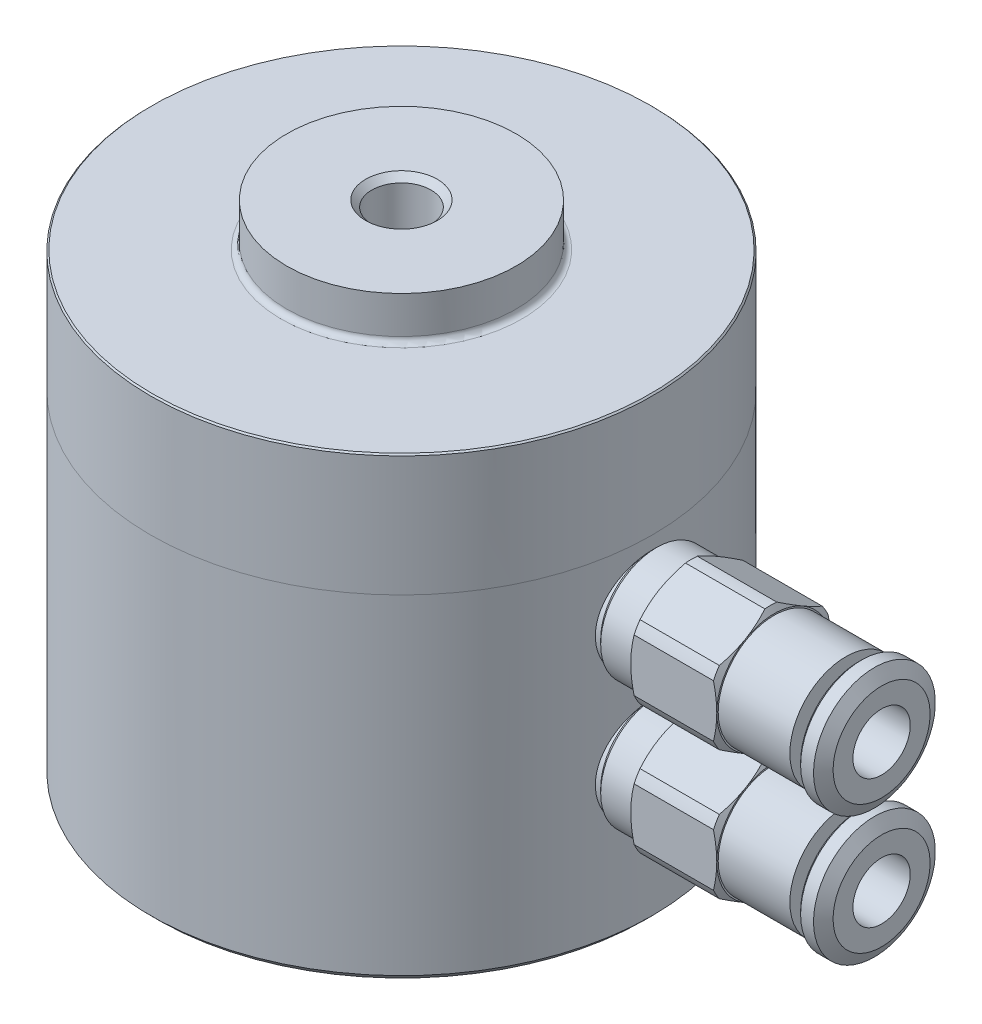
ISO-10303-21;
HEADER;
FILE_DESCRIPTION(('STEP AP214'),'2;1');
FILE_NAME('part.step','',(''),(''),'','','');
FILE_SCHEMA(('AUTOMOTIVE_DESIGN { 1 0 10303 214 1 1 1 1 }'));
ENDSEC;
DATA;
#1=APPLICATION_CONTEXT('core data for automotive mechanical design processes');
#2=APPLICATION_PROTOCOL_DEFINITION('international standard','automotive_design',2000,#1);
#3=PRODUCT_CONTEXT('',#1,'mechanical');
#4=PRODUCT('Part','Part','',(#3));
#5=PRODUCT_RELATED_PRODUCT_CATEGORY('part','',(#4));
#6=PRODUCT_DEFINITION_FORMATION('','',#4);
#7=PRODUCT_DEFINITION_CONTEXT('part definition',#1,'design');
#8=PRODUCT_DEFINITION('design','',#6,#7);
#9=PRODUCT_DEFINITION_SHAPE('','',#8);
#10=(LENGTH_UNIT() NAMED_UNIT(*) SI_UNIT(.MILLI.,.METRE.));
#11=(NAMED_UNIT(*) PLANE_ANGLE_UNIT() SI_UNIT($,.RADIAN.));
#12=(NAMED_UNIT(*) SI_UNIT($,.STERADIAN.) SOLID_ANGLE_UNIT());
#13=UNCERTAINTY_MEASURE_WITH_UNIT(LENGTH_MEASURE(1.E-05),#10,'distance_accuracy_value','');
#14=(GEOMETRIC_REPRESENTATION_CONTEXT(3) GLOBAL_UNCERTAINTY_ASSIGNED_CONTEXT((#13)) GLOBAL_UNIT_ASSIGNED_CONTEXT((#10,
#11,#12)) REPRESENTATION_CONTEXT('',''));
#15=CARTESIAN_POINT('',(0.,0.,0.));
#16=DIRECTION('',(0.,0.,1.));
#17=DIRECTION('',(1.,0.,0.));
#18=AXIS2_PLACEMENT_3D('',#15,#16,#17);
#19=CARTESIAN_POINT('',(0.,28.9,0.));
#20=DIRECTION('',(0.,-1.,0.));
#21=DIRECTION('',(-1.,0.,0.));
#22=AXIS2_PLACEMENT_3D('',#19,#20,#21);
#23=CYLINDRICAL_SURFACE('',#22,17.5);
#24=CARTESIAN_POINT('',(17.1257116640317,19.,-3.60000000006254));
#25=CARTESIAN_POINT('',(17.1257156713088,19.1999045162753,-3.59999275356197));
#26=CARTESIAN_POINT('',(17.1292498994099,19.3998990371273,-3.58329266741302));
#27=CARTESIAN_POINT('',(17.1429826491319,19.7942215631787,-3.51699437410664));
#28=CARTESIAN_POINT('',(17.1531863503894,19.9885450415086,-3.46737059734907));
#29=CARTESIAN_POINT('',(17.1790546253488,20.3657638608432,-3.33683616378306));
#30=CARTESIAN_POINT('',(17.1947136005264,20.5486706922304,-3.2559575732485));
#31=CARTESIAN_POINT('',(17.2297213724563,20.8983168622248,-3.06529837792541));
#32=CARTESIAN_POINT('',(17.249070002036,21.0650569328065,-2.95551908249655));
#33=CARTESIAN_POINT('',(17.2896002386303,21.3801368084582,-2.70842474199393));
#34=CARTESIAN_POINT('',(17.3108029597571,21.5281996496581,-2.57075993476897));
#35=CARTESIAN_POINT('',(17.3524668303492,21.7993018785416,-2.27255788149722));
#36=CARTESIAN_POINT('',(17.3729279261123,21.9223394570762,-2.11201898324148));
#37=CARTESIAN_POINT('',(17.4110315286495,22.1409795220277,-1.77078493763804));
#38=CARTESIAN_POINT('',(17.4286462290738,22.2363178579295,-1.5899171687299));
#39=CARTESIAN_POINT('',(17.4588347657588,22.3951473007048,-1.21430640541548));
#40=CARTESIAN_POINT('',(17.4714091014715,22.4586415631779,-1.01956478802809));
#41=CARTESIAN_POINT('',(17.4899509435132,22.5511156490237,-0.624610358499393));
#42=CARTESIAN_POINT('',(17.4960079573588,22.580563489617,-0.424511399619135));
#43=CARTESIAN_POINT('',(17.5011421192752,22.6055699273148,-0.0221277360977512));
#44=CARTESIAN_POINT('',(17.5002199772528,22.601131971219,0.180156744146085));
#45=CARTESIAN_POINT('',(17.4915688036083,22.5588458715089,0.577950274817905));
#46=CARTESIAN_POINT('',(17.4839425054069,22.5215019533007,0.773515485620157));
#47=CARTESIAN_POINT('',(17.4628561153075,22.4152648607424,1.1555428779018));
#48=CARTESIAN_POINT('',(17.4493957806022,22.3463703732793,1.34200468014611));
#49=CARTESIAN_POINT('',(17.417985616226,22.1785269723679,1.70195924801));
#50=CARTESIAN_POINT('',(17.4000067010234,22.0793824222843,1.87535814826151));
#51=CARTESIAN_POINT('',(17.3615382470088,21.8539983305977,2.20324367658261));
#52=CARTESIAN_POINT('',(17.3410484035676,21.7277554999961,2.35772800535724));
#53=CARTESIAN_POINT('',(17.2993727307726,21.4489984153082,2.64639351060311));
#54=CARTESIAN_POINT('',(17.2781810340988,21.2960428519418,2.7801480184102));
#55=CARTESIAN_POINT('',(17.2378469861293,20.9696564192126,3.02018039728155));
#56=CARTESIAN_POINT('',(17.2187046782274,20.7962251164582,3.12645768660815));
#57=CARTESIAN_POINT('',(17.1846239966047,20.4331748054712,3.30867839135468));
#58=CARTESIAN_POINT('',(17.1696956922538,20.243518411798,3.38454932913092));
#59=CARTESIAN_POINT('',(17.1458783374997,19.8537705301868,3.50322092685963));
#60=CARTESIAN_POINT('',(17.1369884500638,19.6536804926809,3.54602617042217));
#61=CARTESIAN_POINT('',(17.1264230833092,19.2526215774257,3.59670650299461));
#62=CARTESIAN_POINT('',(17.1246200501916,19.0517340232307,3.60519924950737));
#63=CARTESIAN_POINT('',(17.1280896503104,18.6514129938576,3.58867858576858));
#64=CARTESIAN_POINT('',(17.1333618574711,18.4519794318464,3.56366719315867));
#65=CARTESIAN_POINT('',(17.150268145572,18.0623256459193,3.48138175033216));
#66=CARTESIAN_POINT('',(17.1618365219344,17.8720319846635,3.42444072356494));
#67=CARTESIAN_POINT('',(17.1899735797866,17.5036857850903,3.28026976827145));
#68=CARTESIAN_POINT('',(17.2065426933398,17.3256343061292,3.19303722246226));
#69=CARTESIAN_POINT('',(17.2430989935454,16.9841327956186,2.98937238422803));
#70=CARTESIAN_POINT('',(17.2631300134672,16.8209169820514,2.87255538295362));
#71=CARTESIAN_POINT('',(17.3042342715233,16.5161790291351,2.61354764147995));
#72=CARTESIAN_POINT('',(17.3253076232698,16.3746592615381,2.47135413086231));
#73=CARTESIAN_POINT('',(17.3665380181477,16.1149723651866,2.1628503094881));
#74=CARTESIAN_POINT('',(17.3866745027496,15.9972238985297,1.99618438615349));
#75=CARTESIAN_POINT('',(17.4233988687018,15.7913987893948,1.64507801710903));
#76=CARTESIAN_POINT('',(17.4399869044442,15.7033208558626,1.46063834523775));
#77=CARTESIAN_POINT('',(17.4676578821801,15.5599392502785,1.08029399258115));
#78=CARTESIAN_POINT('',(17.4787731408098,15.5044428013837,0.884464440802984));
#79=CARTESIAN_POINT('',(17.49438512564,15.4271911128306,0.486010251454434));
#80=CARTESIAN_POINT('',(17.4988826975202,15.4054315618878,0.283386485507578));
#81=CARTESIAN_POINT('',(17.5007310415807,15.3964463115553,-0.11891285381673));
#82=CARTESIAN_POINT('',(17.4982118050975,15.408592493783,-0.318574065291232));
#83=CARTESIAN_POINT('',(17.4865844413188,15.4656816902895,-0.712945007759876));
#84=CARTESIAN_POINT('',(17.4774764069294,15.5106242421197,-0.907654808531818));
#85=CARTESIAN_POINT('',(17.4537002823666,15.631744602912,-1.28617635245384));
#86=CARTESIAN_POINT('',(17.4390463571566,15.707842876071,-1.47001449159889));
#87=CARTESIAN_POINT('',(17.4057523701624,15.8890330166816,-1.82240128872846));
#88=CARTESIAN_POINT('',(17.3871119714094,15.9941273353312,-1.99094865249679));
#89=CARTESIAN_POINT('',(17.3474918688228,16.2324242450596,-2.31106304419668));
#90=CARTESIAN_POINT('',(17.3264778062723,16.3660739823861,-2.4622929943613));
#91=CARTESIAN_POINT('',(17.284677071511,16.6567740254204,-2.7403945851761));
#92=CARTESIAN_POINT('',(17.2638904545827,16.8138298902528,-2.86726042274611));
#93=CARTESIAN_POINT('',(17.2246334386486,17.1490568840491,-3.09442745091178));
#94=CARTESIAN_POINT('',(17.2061924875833,17.3274504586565,-3.19440571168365));
#95=CARTESIAN_POINT('',(17.1740773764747,17.6988387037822,-3.362807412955));
#96=CARTESIAN_POINT('',(17.1603989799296,17.8918202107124,-3.43125891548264));
#97=CARTESIAN_POINT('',(17.1420289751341,18.2376418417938,-3.52169980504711));
#98=CARTESIAN_POINT('',(17.1359486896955,18.3885366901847,-3.55100874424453));
#99=CARTESIAN_POINT('',(17.1277885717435,18.692936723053,-3.59016125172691));
#100=CARTESIAN_POINT('',(17.1257085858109,18.8464418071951,-3.60000556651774));
#101=CARTESIAN_POINT('',(17.1257116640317,19.,-3.60000000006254));
#102=B_SPLINE_CURVE_WITH_KNOTS('',3,(#24,#25,#26,#27,#28,#29,#30,#31,#32,#33,#34,#35,#36,#37,
#38,#39,#40,#41,#42,#43,#44,#45,#46,#47,#48,#49,#50,#51,#52,#53,#54,#55,#56,#57,#58,#59,#60,#61,
#62,#63,#64,#65,#66,#67,#68,#69,#70,#71,#72,#73,#74,#75,#76,#77,#78,#79,#80,#81,#82,#83,#84,#85,
#86,#87,#88,#89,#90,#91,#92,#93,#94,#95,#96,#97,#98,#99,#100,#101),.UNSPECIFIED.,.T.,.F.,(4,2,2,
2,2,2,2,2,2,2,2,2,2,2,2,2,2,2,2,2,2,2,2,2,2,2,2,2,2,2,2,2,2,2,2,2,2,2,4),(0.,0.599151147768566,
1.19876816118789,1.797771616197,2.39674793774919,3.00376260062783,3.61082113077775,
4.22349185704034,4.83610185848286,5.44018658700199,6.04420986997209,6.63913545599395,
7.23408580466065,7.83296851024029,8.43192394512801,9.04191832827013,9.65192562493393,
10.2633784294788,10.8747464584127,11.475058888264,12.075335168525,12.6694640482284,
13.2636442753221,13.8659879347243,14.468397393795,15.0806350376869,15.6928460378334,
16.3013972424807,16.9098706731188,17.5071470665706,18.1044150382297,18.7001676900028,
19.2959707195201,19.9018945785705,20.5079625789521,21.121013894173,21.7335184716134,
22.1937786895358,22.6540212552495),.UNSPECIFIED.);
#103=CARTESIAN_POINT('',(17.4999999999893,22.6000000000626,-1.27299355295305E-13));
#104=VERTEX_POINT('',#103);
#105=CARTESIAN_POINT('',(17.5,15.3999999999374,-1.25675275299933E-13));
#106=VERTEX_POINT('',#105);
#107=EDGE_CURVE('E647',#104,#106,#102,.T.);
#108=ORIENTED_EDGE('',*,*,#107,.F.);
#109=EDGE_CURVE('E39',#106,#104,#102,.T.);
#110=ORIENTED_EDGE('',*,*,#109,.F.);
#111=EDGE_LOOP('',(#108,#110));
#112=FACE_BOUND('',#111,.T.);
#113=CARTESIAN_POINT('',(0.,0.5,0.));
#114=DIRECTION('',(0.,1.,0.));
#115=DIRECTION('',(1.,0.,0.));
#116=AXIS2_PLACEMENT_3D('',#113,#114,#115);
#117=CIRCLE('',#116,17.5);
#118=CARTESIAN_POINT('',(17.5,0.5,0.));
#119=VERTEX_POINT('',#118);
#120=EDGE_CURVE('E1796',#119,#119,#117,.T.);
#121=ORIENTED_EDGE('',*,*,#120,.T.);
#122=EDGE_LOOP('',(#121));
#123=FACE_BOUND('',#122,.T.);
#124=CARTESIAN_POINT('',(0.,23.5,0.));
#125=DIRECTION('',(0.,1.,0.));
#126=DIRECTION('',(1.,0.,0.));
#127=AXIS2_PLACEMENT_3D('',#124,#125,#126);
#128=CIRCLE('',#127,17.5);
#129=CARTESIAN_POINT('',(17.5,23.5,0.));
#130=VERTEX_POINT('',#129);
#131=EDGE_CURVE('E649',#130,#130,#128,.T.);
#132=ORIENTED_EDGE('',*,*,#131,.F.);
#133=EDGE_LOOP('',(#132));
#134=FACE_BOUND('',#133,.T.);
#135=CARTESIAN_POINT('',(17.1257116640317,10.,-3.60000000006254));
#136=CARTESIAN_POINT('',(17.1257156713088,10.1999045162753,-3.59999275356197));
#137=CARTESIAN_POINT('',(17.1292498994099,10.3998990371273,-3.58329266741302));
#138=CARTESIAN_POINT('',(17.1429826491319,10.7942215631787,-3.51699437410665));
#139=CARTESIAN_POINT('',(17.1531863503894,10.9885450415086,-3.46737059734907));
#140=CARTESIAN_POINT('',(17.1790546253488,11.3657638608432,-3.33683616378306));
#141=CARTESIAN_POINT('',(17.1947136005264,11.5486706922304,-3.2559575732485));
#142=CARTESIAN_POINT('',(17.2297213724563,11.8983168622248,-3.06529837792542));
#143=CARTESIAN_POINT('',(17.249070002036,12.0650569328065,-2.95551908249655));
#144=CARTESIAN_POINT('',(17.2896002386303,12.3801368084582,-2.70842474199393));
#145=CARTESIAN_POINT('',(17.3108029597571,12.5281996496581,-2.57075993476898));
#146=CARTESIAN_POINT('',(17.3524668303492,12.7993018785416,-2.27255788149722));
#147=CARTESIAN_POINT('',(17.3729279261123,12.9223394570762,-2.11201898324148));
#148=CARTESIAN_POINT('',(17.4110315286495,13.1409795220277,-1.77078493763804));
#149=CARTESIAN_POINT('',(17.4286462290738,13.2363178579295,-1.5899171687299));
#150=CARTESIAN_POINT('',(17.4588347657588,13.3951473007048,-1.21430640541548));
#151=CARTESIAN_POINT('',(17.4714091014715,13.4586415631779,-1.01956478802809));
#152=CARTESIAN_POINT('',(17.4899509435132,13.5511156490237,-0.624610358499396));
#153=CARTESIAN_POINT('',(17.4960079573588,13.580563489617,-0.424511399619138));
#154=CARTESIAN_POINT('',(17.5011421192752,13.6055699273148,-0.0221277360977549));
#155=CARTESIAN_POINT('',(17.5002199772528,13.601131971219,0.180156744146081));
#156=CARTESIAN_POINT('',(17.4915688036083,13.5588458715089,0.577950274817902));
#157=CARTESIAN_POINT('',(17.4839425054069,13.5215019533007,0.773515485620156));
#158=CARTESIAN_POINT('',(17.4628561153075,13.4152648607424,1.1555428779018));
#159=CARTESIAN_POINT('',(17.4493957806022,13.3463703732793,1.34200468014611));
#160=CARTESIAN_POINT('',(17.417985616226,13.1785269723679,1.70195924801));
#161=CARTESIAN_POINT('',(17.4000067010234,13.0793824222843,1.8753581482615));
#162=CARTESIAN_POINT('',(17.3615382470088,12.8539983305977,2.20324367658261));
#163=CARTESIAN_POINT('',(17.3410484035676,12.7277554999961,2.35772800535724));
#164=CARTESIAN_POINT('',(17.2993727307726,12.4489984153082,2.64639351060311));
#165=CARTESIAN_POINT('',(17.2781810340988,12.2960428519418,2.78014801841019));
#166=CARTESIAN_POINT('',(17.2378469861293,11.9696564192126,3.02018039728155));
#167=CARTESIAN_POINT('',(17.2187046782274,11.7962251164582,3.12645768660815));
#168=CARTESIAN_POINT('',(17.1846239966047,11.4331748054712,3.30867839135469));
#169=CARTESIAN_POINT('',(17.1696956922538,11.243518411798,3.38454932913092));
#170=CARTESIAN_POINT('',(17.1458783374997,10.8537705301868,3.50322092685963));
#171=CARTESIAN_POINT('',(17.1369884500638,10.6536804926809,3.54602617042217));
#172=CARTESIAN_POINT('',(17.1264230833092,10.2526215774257,3.59670650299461));
#173=CARTESIAN_POINT('',(17.1246200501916,10.0517340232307,3.60519924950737));
#174=CARTESIAN_POINT('',(17.1280896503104,9.65141299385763,3.58867858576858));
#175=CARTESIAN_POINT('',(17.1333618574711,9.45197943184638,3.56366719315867));
#176=CARTESIAN_POINT('',(17.150268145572,9.06232564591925,3.48138175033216));
#177=CARTESIAN_POINT('',(17.1618365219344,8.87203198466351,3.42444072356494));
#178=CARTESIAN_POINT('',(17.1899735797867,8.50368578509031,3.28026976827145));
#179=CARTESIAN_POINT('',(17.2065426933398,8.32563430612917,3.19303722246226));
#180=CARTESIAN_POINT('',(17.2430989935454,7.98413279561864,2.98937238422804));
#181=CARTESIAN_POINT('',(17.2631300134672,7.8209169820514,2.87255538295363));
#182=CARTESIAN_POINT('',(17.3042342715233,7.51617902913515,2.61354764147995));
#183=CARTESIAN_POINT('',(17.3253076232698,7.37465926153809,2.47135413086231));
#184=CARTESIAN_POINT('',(17.3665380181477,7.11497236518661,2.16285030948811));
#185=CARTESIAN_POINT('',(17.3866745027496,6.99722389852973,1.9961843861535));
#186=CARTESIAN_POINT('',(17.4233988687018,6.79139878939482,1.64507801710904));
#187=CARTESIAN_POINT('',(17.4399869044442,6.70332085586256,1.46063834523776));
#188=CARTESIAN_POINT('',(17.4676578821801,6.55993925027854,1.08029399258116));
#189=CARTESIAN_POINT('',(17.4787731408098,6.50444280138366,0.884464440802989));
#190=CARTESIAN_POINT('',(17.49438512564,6.42719111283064,0.486010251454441));
#191=CARTESIAN_POINT('',(17.4988826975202,6.40543156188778,0.283386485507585));
#192=CARTESIAN_POINT('',(17.5007310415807,6.39644631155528,-0.118912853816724));
#193=CARTESIAN_POINT('',(17.4982118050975,6.40859249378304,-0.318574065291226));
#194=CARTESIAN_POINT('',(17.4865844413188,6.46568169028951,-0.712945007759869));
#195=CARTESIAN_POINT('',(17.4774764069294,6.51062424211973,-0.907654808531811));
#196=CARTESIAN_POINT('',(17.4537002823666,6.63174460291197,-1.28617635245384));
#197=CARTESIAN_POINT('',(17.4390463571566,6.70784287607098,-1.47001449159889));
#198=CARTESIAN_POINT('',(17.4057523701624,6.8890330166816,-1.82240128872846));
#199=CARTESIAN_POINT('',(17.3871119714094,6.99412733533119,-1.99094865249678));
#200=CARTESIAN_POINT('',(17.3474918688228,7.23242424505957,-2.31106304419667));
#201=CARTESIAN_POINT('',(17.3264778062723,7.36607398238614,-2.46229299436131));
#202=CARTESIAN_POINT('',(17.284677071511,7.65677402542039,-2.74039458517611));
#203=CARTESIAN_POINT('',(17.2638904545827,7.81382989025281,-2.86726042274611));
#204=CARTESIAN_POINT('',(17.2246334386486,8.14905688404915,-3.09442745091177));
#205=CARTESIAN_POINT('',(17.2061924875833,8.32745045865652,-3.19440571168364));
#206=CARTESIAN_POINT('',(17.1740773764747,8.69883870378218,-3.362807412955));
#207=CARTESIAN_POINT('',(17.1603989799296,8.89182021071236,-3.43125891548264));
#208=CARTESIAN_POINT('',(17.1420289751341,9.23764184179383,-3.52169980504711));
#209=CARTESIAN_POINT('',(17.1359486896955,9.38853669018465,-3.55100874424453));
#210=CARTESIAN_POINT('',(17.1277885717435,9.69293672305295,-3.59016125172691));
#211=CARTESIAN_POINT('',(17.1257085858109,9.84644180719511,-3.60000556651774));
#212=CARTESIAN_POINT('',(17.1257116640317,10.,-3.60000000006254));
#213=B_SPLINE_CURVE_WITH_KNOTS('',3,(#135,#136,#137,#138,#139,#140,#141,#142,#143,#144,#145,
#146,#147,#148,#149,#150,#151,#152,#153,#154,#155,#156,#157,#158,#159,#160,#161,#162,#163,#164,
#165,#166,#167,#168,#169,#170,#171,#172,#173,#174,#175,#176,#177,#178,#179,#180,#181,#182,#183,
#184,#185,#186,#187,#188,#189,#190,#191,#192,#193,#194,#195,#196,#197,#198,#199,#200,#201,#202,
#203,#204,#205,#206,#207,#208,#209,#210,#211,#212),.UNSPECIFIED.,.T.,.F.,(4,2,2,2,2,2,2,2,2,2,2,
2,2,2,2,2,2,2,2,2,2,2,2,2,2,2,2,2,2,2,2,2,2,2,2,2,2,2,4),(0.,0.599151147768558,1.19876816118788,
1.79777161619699,2.39674793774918,3.00376260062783,3.61082113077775,4.22349185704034,
4.83610185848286,5.44018658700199,6.04420986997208,6.63913545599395,7.23408580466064,
7.83296851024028,8.431923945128,9.04191832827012,9.65192562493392,10.2633784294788,
10.8747464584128,11.475058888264,12.075335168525,12.6694640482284,13.263644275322,
13.8659879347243,14.468397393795,15.0806350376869,15.6928460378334,16.3013972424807,
16.9098706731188,17.5071470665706,18.1044150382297,18.7001676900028,19.2959707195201,
19.9018945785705,20.507962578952,21.121013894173,21.7335184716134,22.1937786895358,
22.6540212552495),.UNSPECIFIED.);
#214=CARTESIAN_POINT('',(17.4999999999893,13.6000000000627,-1.25269374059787E-13));
#215=VERTEX_POINT('',#214);
#216=CARTESIAN_POINT('',(17.5,6.39999999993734,-1.23645294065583E-13));
#217=VERTEX_POINT('',#216);
#218=EDGE_CURVE('E11',#215,#217,#213,.T.);
#219=ORIENTED_EDGE('',*,*,#218,.F.);
#220=EDGE_CURVE('E21',#217,#215,#213,.T.);
#221=ORIENTED_EDGE('',*,*,#220,.F.);
#222=EDGE_LOOP('',(#219,#221));
#223=FACE_BOUND('',#222,.T.);
#224=ADVANCED_FACE('F17',(#112,#123,#134,#223),#23,.T.);
#225=CARTESIAN_POINT('',(-10.5,0.,0.));
#226=DIRECTION('',(0.,-1.,0.));
#227=DIRECTION('',(-1.,0.,0.));
#228=AXIS2_PLACEMENT_3D('',#225,#226,#227);
#229=PLANE('',#228);
#230=CARTESIAN_POINT('',(0.,0.,0.));
#231=DIRECTION('',(0.,-1.,0.));
#232=DIRECTION('',(-1.,0.,0.));
#233=AXIS2_PLACEMENT_3D('',#230,#231,#232);
#234=CIRCLE('',#233,10.5);
#235=CARTESIAN_POINT('',(-10.5,0.,0.));
#236=VERTEX_POINT('',#235);
#237=EDGE_CURVE('E1784',#236,#236,#234,.T.);
#238=ORIENTED_EDGE('',*,*,#237,.T.);
#239=EDGE_LOOP('',(#238));
#240=FACE_BOUND('',#239,.T.);
#241=CARTESIAN_POINT('',(0.,0.,0.));
#242=DIRECTION('',(0.,-1.,0.));
#243=DIRECTION('',(-1.,0.,0.));
#244=AXIS2_PLACEMENT_3D('',#241,#242,#243);
#245=CIRCLE('',#244,5.9);
#246=CARTESIAN_POINT('',(-5.9,0.,0.));
#247=VERTEX_POINT('',#246);
#248=EDGE_CURVE('E1817',#247,#247,#245,.T.);
#249=ORIENTED_EDGE('',*,*,#248,.F.);
#250=EDGE_LOOP('',(#249));
#251=FACE_BOUND('',#250,.T.);
#252=ADVANCED_FACE('F631',(#240,#251),#229,.T.);
#253=CARTESIAN_POINT('',(0.,35.,0.));
#254=DIRECTION('',(0.,1.,0.));
#255=DIRECTION('',(0.237687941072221,0.,-0.971341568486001));
#256=AXIS2_PLACEMENT_3D('',#253,#254,#255);
#257=PLANE('',#256);
#258=CARTESIAN_POINT('',(0.,35.,0.));
#259=DIRECTION('',(0.,1.,0.));
#260=DIRECTION('',(0.237687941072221,0.,-0.971341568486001));
#261=AXIS2_PLACEMENT_3D('',#258,#259,#260);
#262=CIRCLE('',#261,8.);
#263=CARTESIAN_POINT('',(1.90150352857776,35.,-7.77073254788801));
#264=VERTEX_POINT('',#263);
#265=EDGE_CURVE('E1757',#264,#264,#262,.T.);
#266=ORIENTED_EDGE('',*,*,#265,.T.);
#267=EDGE_LOOP('',(#266));
#268=FACE_BOUND('',#267,.T.);
#269=CARTESIAN_POINT('',(0.,35.,0.));
#270=DIRECTION('',(0.,1.,0.));
#271=DIRECTION('',(0.237687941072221,0.,-0.971341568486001));
#272=AXIS2_PLACEMENT_3D('',#269,#270,#271);
#273=CIRCLE('',#272,2.5);
#274=CARTESIAN_POINT('',(0.59421985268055,35.,-2.42835392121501));
#275=VERTEX_POINT('',#274);
#276=EDGE_CURVE('E1760',#275,#275,#273,.F.);
#277=ORIENTED_EDGE('',*,*,#276,.T.);
#278=EDGE_LOOP('',(#277));
#279=FACE_BOUND('',#278,.T.);
#280=ADVANCED_FACE('F635',(#268,#279),#257,.T.);
#281=CARTESIAN_POINT('',(0.,0.50000000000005,0.));
#282=DIRECTION('',(0.,-1.,0.));
#283=DIRECTION('',(-1.,0.,0.));
#284=AXIS2_PLACEMENT_3D('',#281,#282,#283);
#285=CONICAL_SURFACE('',#284,14.25,0.785398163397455);
#286=CARTESIAN_POINT('',(0.,0.,0.));
#287=DIRECTION('',(0.,-1.,0.));
#288=DIRECTION('',(-1.,0.,0.));
#289=AXIS2_PLACEMENT_3D('',#286,#287,#288);
#290=CIRCLE('',#289,14.75);
#291=CARTESIAN_POINT('',(-14.75,0.,0.));
#292=VERTEX_POINT('',#291);
#293=EDGE_CURVE('E1793',#292,#292,#290,.T.);
#294=ORIENTED_EDGE('',*,*,#293,.T.);
#295=EDGE_LOOP('',(#294));
#296=FACE_BOUND('',#295,.T.);
#297=CARTESIAN_POINT('',(0.,0.50000000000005,0.));
#298=DIRECTION('',(0.,-1.,0.));
#299=DIRECTION('',(-1.,0.,0.));
#300=AXIS2_PLACEMENT_3D('',#297,#298,#299);
#301=CIRCLE('',#300,14.25);
#302=CARTESIAN_POINT('',(-14.25,0.500000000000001,0.));
#303=VERTEX_POINT('',#302);
#304=EDGE_CURVE('E1790',#303,#303,#301,.T.);
#305=ORIENTED_EDGE('',*,*,#304,.F.);
#306=EDGE_LOOP('',(#305));
#307=FACE_BOUND('',#306,.T.);
#308=ADVANCED_FACE('F1509',(#296,#307),#285,.F.);
#309=CARTESIAN_POINT('',(-14.25,0.499999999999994,0.));
#310=DIRECTION('',(0.,-1.,0.));
#311=DIRECTION('',(-1.,0.,0.));
#312=AXIS2_PLACEMENT_3D('',#309,#310,#311);
#313=PLANE('',#312);
#314=ORIENTED_EDGE('',*,*,#304,.T.);
#315=EDGE_LOOP('',(#314));
#316=FACE_BOUND('',#315,.T.);
#317=CARTESIAN_POINT('',(0.,0.500000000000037,0.));
#318=DIRECTION('',(0.,-1.,0.));
#319=DIRECTION('',(-1.,0.,0.));
#320=AXIS2_PLACEMENT_3D('',#317,#318,#319);
#321=CIRCLE('',#320,11.);
#322=CARTESIAN_POINT('',(-11.,0.499999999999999,0.));
#323=VERTEX_POINT('',#322);
#324=EDGE_CURVE('E1787',#323,#323,#321,.T.);
#325=ORIENTED_EDGE('',*,*,#324,.F.);
#326=EDGE_LOOP('',(#325));
#327=FACE_BOUND('',#326,.T.);
#328=ADVANCED_FACE('F1500',(#316,#327),#313,.T.);
#329=CARTESIAN_POINT('',(0.,0.,0.));
#330=DIRECTION('',(0.,1.,0.));
#331=DIRECTION('',(1.,0.,0.));
#332=AXIS2_PLACEMENT_3D('',#329,#330,#331);
#333=CONICAL_SURFACE('',#332,10.5,0.785398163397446);
#334=ORIENTED_EDGE('',*,*,#324,.T.);
#335=EDGE_LOOP('',(#334));
#336=FACE_BOUND('',#335,.T.);
#337=ORIENTED_EDGE('',*,*,#237,.F.);
#338=EDGE_LOOP('',(#337));
#339=FACE_BOUND('',#338,.T.);
#340=ADVANCED_FACE('F1491',(#336,#339),#333,.T.);
#341=CARTESIAN_POINT('',(0.,0.5,0.));
#342=DIRECTION('',(0.,1.,0.));
#343=DIRECTION('',(1.,0.,0.));
#344=AXIS2_PLACEMENT_3D('',#341,#342,#343);
#345=CONICAL_SURFACE('',#344,17.5,0.785398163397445);
#346=CARTESIAN_POINT('',(0.,0.,0.));
#347=DIRECTION('',(0.,1.,0.));
#348=DIRECTION('',(1.,0.,0.));
#349=AXIS2_PLACEMENT_3D('',#346,#347,#348);
#350=CIRCLE('',#349,17.);
#351=CARTESIAN_POINT('',(17.,0.,0.));
#352=VERTEX_POINT('',#351);
#353=EDGE_CURVE('E648',#352,#352,#350,.F.);
#354=ORIENTED_EDGE('',*,*,#353,.F.);
#355=EDGE_LOOP('',(#354));
#356=FACE_BOUND('',#355,.T.);
#357=ORIENTED_EDGE('',*,*,#120,.F.);
#358=EDGE_LOOP('',(#357));
#359=FACE_BOUND('',#358,.T.);
#360=ADVANCED_FACE('F19',(#356,#359),#345,.T.);
#361=CARTESIAN_POINT('',(0.,0.,0.));
#362=DIRECTION('',(0.,1.,0.));
#363=DIRECTION('',(1.,0.,0.));
#364=AXIS2_PLACEMENT_3D('',#361,#362,#363);
#365=PLANE('',#364);
#366=ORIENTED_EDGE('',*,*,#353,.T.);
#367=EDGE_LOOP('',(#366));
#368=FACE_BOUND('',#367,.T.);
#369=ORIENTED_EDGE('',*,*,#293,.F.);
#370=EDGE_LOOP('',(#369));
#371=FACE_BOUND('',#370,.T.);
#372=ADVANCED_FACE('F641',(#368,#371),#365,.F.);
#373=CARTESIAN_POINT('',(0.,32.,0.));
#374=DIRECTION('',(0.,-1.,0.));
#375=DIRECTION('',(-0.237687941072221,0.,0.971341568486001));
#376=AXIS2_PLACEMENT_3D('',#373,#374,#375);
#377=PLANE('',#376);
#378=CARTESIAN_POINT('',(0.,32.,0.));
#379=DIRECTION('',(0.,-1.,0.));
#380=DIRECTION('',(-0.237687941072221,0.,0.971341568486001));
#381=AXIS2_PLACEMENT_3D('',#378,#379,#380);
#382=CIRCLE('',#381,8.4);
#383=CARTESIAN_POINT('',(-1.99657870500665,32.,8.15926917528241));
#384=VERTEX_POINT('',#383);
#385=EDGE_CURVE('E1781',#384,#384,#382,.T.);
#386=ORIENTED_EDGE('',*,*,#385,.T.);
#387=EDGE_LOOP('',(#386));
#388=FACE_BOUND('',#387,.T.);
#389=CARTESIAN_POINT('',(0.,32.,0.));
#390=DIRECTION('',(0.,-1.,0.));
#391=DIRECTION('',(-0.237687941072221,0.,0.971341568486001));
#392=AXIS2_PLACEMENT_3D('',#389,#390,#391);
#393=CIRCLE('',#392,17.4);
#394=CARTESIAN_POINT('',(-4.13577017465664,32.,16.9013432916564));
#395=VERTEX_POINT('',#394);
#396=EDGE_CURVE('E1775',#395,#395,#393,.F.);
#397=ORIENTED_EDGE('',*,*,#396,.T.);
#398=EDGE_LOOP('',(#397));
#399=FACE_BOUND('',#398,.T.);
#400=ADVANCED_FACE('F1465',(#388,#399),#377,.F.);
#401=CARTESIAN_POINT('',(0.,31.9,0.));
#402=DIRECTION('',(0.,-1.,0.));
#403=DIRECTION('',(-0.237687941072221,0.,0.971341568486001));
#404=AXIS2_PLACEMENT_3D('',#401,#402,#403);
#405=CONICAL_SURFACE('',#404,17.5,0.785398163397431);
#406=ORIENTED_EDGE('',*,*,#396,.F.);
#407=EDGE_LOOP('',(#406));
#408=FACE_BOUND('',#407,.T.);
#409=CARTESIAN_POINT('',(0.,31.9,0.));
#410=DIRECTION('',(0.,-1.,0.));
#411=DIRECTION('',(-0.237687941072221,0.,0.971341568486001));
#412=AXIS2_PLACEMENT_3D('',#409,#410,#411);
#413=CIRCLE('',#412,17.5);
#414=CARTESIAN_POINT('',(-4.15953896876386,31.9,16.998477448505));
#415=VERTEX_POINT('',#414);
#416=EDGE_CURVE('E1772',#415,#415,#413,.T.);
#417=ORIENTED_EDGE('',*,*,#416,.F.);
#418=EDGE_LOOP('',(#417));
#419=FACE_BOUND('',#418,.T.);
#420=ADVANCED_FACE('F1455',(#408,#419),#405,.T.);
#421=CARTESIAN_POINT('',(0.,32.,0.));
#422=DIRECTION('',(0.,-1.,0.));
#423=DIRECTION('',(-0.237687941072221,0.,0.971341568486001));
#424=AXIS2_PLACEMENT_3D('',#421,#422,#423);
#425=CYLINDRICAL_SURFACE('',#424,17.5);
#426=ORIENTED_EDGE('',*,*,#416,.T.);
#427=EDGE_LOOP('',(#426));
#428=FACE_BOUND('',#427,.T.);
#429=ORIENTED_EDGE('',*,*,#131,.T.);
#430=EDGE_LOOP('',(#429));
#431=FACE_BOUND('',#430,.T.);
#432=ADVANCED_FACE('F1445',(#428,#431),#425,.T.);
#433=CARTESIAN_POINT('',(0.,35.,0.));
#434=DIRECTION('',(0.,-1.,0.));
#435=DIRECTION('',(-0.237687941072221,0.,0.971341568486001));
#436=AXIS2_PLACEMENT_3D('',#433,#434,#435);
#437=CYLINDRICAL_SURFACE('',#436,8.);
#438=CARTESIAN_POINT('',(0.,32.4,0.));
#439=DIRECTION('',(0.,-1.,0.));
#440=DIRECTION('',(-0.237687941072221,0.,0.971341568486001));
#441=AXIS2_PLACEMENT_3D('',#438,#439,#440);
#442=CIRCLE('',#441,8.);
#443=CARTESIAN_POINT('',(-1.90150352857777,32.4,7.77073254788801));
#444=VERTEX_POINT('',#443);
#445=EDGE_CURVE('E1778',#444,#444,#442,.F.);
#446=ORIENTED_EDGE('',*,*,#445,.T.);
#447=EDGE_LOOP('',(#446));
#448=FACE_BOUND('',#447,.T.);
#449=ORIENTED_EDGE('',*,*,#265,.F.);
#450=EDGE_LOOP('',(#449));
#451=FACE_BOUND('',#450,.T.);
#452=ADVANCED_FACE('F1434',(#448,#451),#437,.T.);
#453=CARTESIAN_POINT('',(0.,32.4,0.));
#454=DIRECTION('',(0.,-1.,0.));
#455=DIRECTION('',(-0.237687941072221,0.,0.971341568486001));
#456=AXIS2_PLACEMENT_3D('',#453,#454,#455);
#457=TOROIDAL_SURFACE('',#456,8.4,0.4);
#458=ORIENTED_EDGE('',*,*,#385,.F.);
#459=EDGE_LOOP('',(#458));
#460=FACE_BOUND('',#459,.T.);
#461=ORIENTED_EDGE('',*,*,#445,.F.);
#462=EDGE_LOOP('',(#461));
#463=FACE_BOUND('',#462,.T.);
#464=ADVANCED_FACE('F1424',(#460,#463),#457,.F.);
#465=CARTESIAN_POINT('',(0.,29.,0.));
#466=DIRECTION('',(0.,1.,0.));
#467=DIRECTION('',(-1.,0.,0.));
#468=AXIS2_PLACEMENT_3D('',#465,#466,#467);
#469=PLANE('',#468);
#470=CARTESIAN_POINT('',(0.,29.,0.));
#471=DIRECTION('',(0.,1.,0.));
#472=DIRECTION('',(0.237687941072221,0.,-0.971341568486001));
#473=AXIS2_PLACEMENT_3D('',#470,#471,#472);
#474=CIRCLE('',#473,2.066987);
#475=CARTESIAN_POINT('',(0.491297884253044,29.,-2.00775039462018));
#476=VERTEX_POINT('',#475);
#477=EDGE_CURVE('E1762',#476,#476,#474,.T.);
#478=ORIENTED_EDGE('',*,*,#477,.T.);
#479=EDGE_LOOP('',(#478));
#480=FACE_BOUND('',#479,.T.);
#481=ADVANCED_FACE('F1414',(#480),#469,.T.);
#482=CARTESIAN_POINT('',(0.,34.566987,0.));
#483=DIRECTION('',(0.,1.,0.));
#484=DIRECTION('',(0.237687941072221,0.,-0.971341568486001));
#485=AXIS2_PLACEMENT_3D('',#482,#483,#484);
#486=CONICAL_SURFACE('',#485,2.066987,0.78539816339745);
#487=ORIENTED_EDGE('',*,*,#276,.F.);
#488=EDGE_LOOP('',(#487));
#489=FACE_BOUND('',#488,.T.);
#490=CARTESIAN_POINT('',(0.,34.566987,0.));
#491=DIRECTION('',(0.,1.,0.));
#492=DIRECTION('',(0.237687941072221,0.,-0.971341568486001));
#493=AXIS2_PLACEMENT_3D('',#490,#491,#492);
#494=CIRCLE('',#493,2.066987);
#495=CARTESIAN_POINT('',(0.491297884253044,34.566987,-2.00775039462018));
#496=VERTEX_POINT('',#495);
#497=EDGE_CURVE('E1761',#496,#496,#494,.T.);
#498=ORIENTED_EDGE('',*,*,#497,.F.);
#499=EDGE_LOOP('',(#498));
#500=FACE_BOUND('',#499,.T.);
#501=ADVANCED_FACE('F1404',(#489,#500),#486,.F.);
#502=CARTESIAN_POINT('',(0.,29.,0.));
#503=DIRECTION('',(0.,1.,0.));
#504=DIRECTION('',(0.237687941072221,0.,-0.971341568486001));
#505=AXIS2_PLACEMENT_3D('',#502,#503,#504);
#506=CYLINDRICAL_SURFACE('',#505,2.066987);
#507=ORIENTED_EDGE('',*,*,#497,.T.);
#508=EDGE_LOOP('',(#507));
#509=FACE_BOUND('',#508,.T.);
#510=ORIENTED_EDGE('',*,*,#477,.F.);
#511=EDGE_LOOP('',(#510));
#512=FACE_BOUND('',#511,.T.);
#513=ADVANCED_FACE('F1394',(#509,#512),#506,.F.);
#514=CARTESIAN_POINT('',(-4.9,1.,0.));
#515=DIRECTION('',(0.,-1.,0.));
#516=DIRECTION('',(-1.,0.,0.));
#517=AXIS2_PLACEMENT_3D('',#514,#515,#516);
#518=PLANE('',#517);
#519=CARTESIAN_POINT('',(0.,1.00000000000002,0.));
#520=DIRECTION('',(0.,-1.,0.));
#521=DIRECTION('',(-1.,0.,0.));
#522=AXIS2_PLACEMENT_3D('',#519,#520,#521);
#523=CIRCLE('',#522,4.9);
#524=CARTESIAN_POINT('',(-4.9,1.,0.));
#525=VERTEX_POINT('',#524);
#526=EDGE_CURVE('E1767',#525,#525,#523,.T.);
#527=ORIENTED_EDGE('',*,*,#526,.T.);
#528=EDGE_LOOP('',(#527));
#529=FACE_BOUND('',#528,.T.);
#530=ADVANCED_FACE('F1383',(#529),#518,.T.);
#531=CARTESIAN_POINT('',(0.,1.00000000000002,0.));
#532=DIRECTION('',(0.,-1.,0.));
#533=DIRECTION('',(-1.,0.,0.));
#534=AXIS2_PLACEMENT_3D('',#531,#532,#533);
#535=CONICAL_SURFACE('',#534,4.9,0.785398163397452);
#536=ORIENTED_EDGE('',*,*,#248,.T.);
#537=EDGE_LOOP('',(#536));
#538=FACE_BOUND('',#537,.T.);
#539=ORIENTED_EDGE('',*,*,#526,.F.);
#540=EDGE_LOOP('',(#539));
#541=FACE_BOUND('',#540,.T.);
#542=ADVANCED_FACE('F656',(#538,#541),#535,.F.);
#543=CARTESIAN_POINT('',(3.31766235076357,19.,2.10762137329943E-13));
#544=DIRECTION('',(1.,0.,0.));
#545=DIRECTION('',(0.,0.,-1.));
#546=AXIS2_PLACEMENT_3D('',#543,#544,#545);
#547=CYLINDRICAL_SURFACE('',#546,3.60000000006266);
#548=CARTESIAN_POINT('',(17.4999999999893,19.,1.11727402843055E-13));
#549=DIRECTION('',(-1.,0.,0.));
#550=DIRECTION('',(0.,0.,1.));
#551=AXIS2_PLACEMENT_3D('',#548,#549,#550);
#552=CIRCLE('',#551,3.60000000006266);
#553=EDGE_CURVE('E514',#106,#104,#552,.T.);
#554=ORIENTED_EDGE('',*,*,#553,.T.);
#555=ORIENTED_EDGE('',*,*,#107,.T.);
#556=EDGE_LOOP('',(#554,#555));
#557=FACE_BOUND('',#556,.T.);
#558=ADVANCED_FACE('F651',(#557),#547,.T.);
#559=EDGE_CURVE('E509',#104,#106,#552,.T.);
#560=ORIENTED_EDGE('',*,*,#559,.T.);
#561=ORIENTED_EDGE('',*,*,#109,.T.);
#562=EDGE_LOOP('',(#560,#561));
#563=FACE_BOUND('',#562,.T.);
#564=ADVANCED_FACE('F655',(#563),#547,.T.);
#565=CARTESIAN_POINT('',(19.5,21.,0.));
#566=DIRECTION('',(1.,0.,0.));
#567=DIRECTION('',(0.,0.,-1.));
#568=AXIS2_PLACEMENT_3D('',#565,#566,#567);
#569=PLANE('',#568);
#570=CARTESIAN_POINT('',(19.5,19.,0.));
#571=DIRECTION('',(-1.,0.,0.));
#572=DIRECTION('',(0.,0.,1.));
#573=AXIS2_PLACEMENT_3D('',#570,#571,#572);
#574=CIRCLE('',#573,2.);
#575=CARTESIAN_POINT('',(19.5,19.,2.0000000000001));
#576=VERTEX_POINT('',#575);
#577=EDGE_CURVE('E518',#576,#576,#574,.T.);
#578=ORIENTED_EDGE('',*,*,#577,.F.);
#579=EDGE_LOOP('',(#578));
#580=FACE_BOUND('',#579,.T.);
#581=ADVANCED_FACE('F372',(#580),#569,.T.);
#582=CARTESIAN_POINT('',(25.9999999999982,19.,0.));
#583=DIRECTION('',(-1.,0.,0.));
#584=DIRECTION('',(0.,0.,1.));
#585=AXIS2_PLACEMENT_3D('',#582,#583,#584);
#586=CONICAL_SURFACE('',#585,3.99999999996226,1.04719755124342);
#587=CARTESIAN_POINT('',(25.7690598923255,19.,0.));
#588=DIRECTION('',(-1.,0.,0.));
#589=DIRECTION('',(0.,0.,1.));
#590=AXIS2_PLACEMENT_3D('',#587,#588,#589);
#591=CIRCLE('',#590,4.40000000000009);
#592=CARTESIAN_POINT('',(25.7690598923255,17.1669697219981,-3.99999999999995));
#593=VERTEX_POINT('',#592);
#594=CARTESIAN_POINT('',(25.7690598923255,16.4524135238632,-3.58745078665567));
#595=VERTEX_POINT('',#594);
#596=EDGE_CURVE('E576',#593,#595,#591,.T.);
#597=ORIENTED_EDGE('',*,*,#596,.F.);
#598=CARTESIAN_POINT('',(24.0943509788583,12.8926321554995,-3.99999999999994));
#599=CARTESIAN_POINT('',(24.1790831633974,13.0681192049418,-3.99999999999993));
#600=CARTESIAN_POINT('',(24.2629676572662,13.2440231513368,-3.99999999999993));
#601=CARTESIAN_POINT('',(24.4285564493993,13.596890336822,-3.99999999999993));
#602=CARTESIAN_POINT('',(24.5102603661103,13.7738537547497,-3.99999999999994));
#603=CARTESIAN_POINT('',(24.6714374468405,14.1300300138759,-3.99999999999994));
#604=CARTESIAN_POINT('',(24.7508950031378,14.3092499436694,-3.99999999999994));
#605=CARTESIAN_POINT('',(24.906371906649,14.6691693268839,-3.99999999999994));
#606=CARTESIAN_POINT('',(24.9823914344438,14.8498687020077,-3.99999999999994));
#607=CARTESIAN_POINT('',(25.130946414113,15.2151958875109,-3.99999999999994));
#608=CARTESIAN_POINT('',(25.2034300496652,15.3998448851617,-3.99999999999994));
#609=CARTESIAN_POINT('',(25.3426765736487,15.7713270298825,-3.99999999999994));
#610=CARTESIAN_POINT('',(25.4094388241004,15.9581604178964,-3.99999999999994));
#611=CARTESIAN_POINT('',(25.5354358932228,16.3339189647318,-3.99999999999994));
#612=CARTESIAN_POINT('',(25.5946868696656,16.5228386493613,-3.99999999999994));
#613=CARTESIAN_POINT('',(25.7037258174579,16.9033629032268,-3.99999999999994));
#614=CARTESIAN_POINT('',(25.7535167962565,17.0949665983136,-3.99999999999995));
#615=CARTESIAN_POINT('',(25.8412090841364,17.4809967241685,-3.99999999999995));
#616=CARTESIAN_POINT('',(25.8791062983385,17.6754241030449,-3.99999999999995));
#617=CARTESIAN_POINT('',(25.940444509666,18.0666032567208,-3.99999999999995));
#618=CARTESIAN_POINT('',(25.9638854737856,18.2633550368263,-3.99999999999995));
#619=CARTESIAN_POINT('',(25.9942370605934,18.656920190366,-3.99999999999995));
#620=CARTESIAN_POINT('',(26.0012504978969,18.8537254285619,-3.99999999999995));
#621=CARTESIAN_POINT('',(25.9983821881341,19.2471691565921,-3.99999999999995));
#622=CARTESIAN_POINT('',(25.9885047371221,19.4438076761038,-3.99999999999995));
#623=CARTESIAN_POINT('',(25.9578626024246,19.7800683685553,-3.99999999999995));
#624=CARTESIAN_POINT('',(25.9409744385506,19.9200632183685,-3.99999999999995));
#625=CARTESIAN_POINT('',(25.8997438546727,20.1989592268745,-3.99999999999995));
#626=CARTESIAN_POINT('',(25.8754003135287,20.3378602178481,-3.99999999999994));
#627=CARTESIAN_POINT('',(25.7923988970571,20.7531439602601,-3.99999999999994));
#628=CARTESIAN_POINT('',(25.7238261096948,21.027563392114,-3.99999999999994));
#629=CARTESIAN_POINT('',(25.6057355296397,21.4380175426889,-3.99999999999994));
#630=CARTESIAN_POINT('',(25.5632615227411,21.5761990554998,-3.99999999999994));
#631=CARTESIAN_POINT('',(25.4741145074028,21.8512269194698,-3.99999999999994));
#632=CARTESIAN_POINT('',(25.4274411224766,21.9880731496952,-3.99999999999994));
#633=CARTESIAN_POINT('',(25.3308928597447,22.2597474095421,-3.99999999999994));
#634=CARTESIAN_POINT('',(25.2810375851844,22.3945824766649,-3.99999999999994));
#635=CARTESIAN_POINT('',(25.1784629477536,22.6631076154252,-3.99999999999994));
#636=CARTESIAN_POINT('',(25.1257445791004,22.7967980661,-3.99999999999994));
#637=CARTESIAN_POINT('',(25.0718631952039,22.930006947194,-3.99999999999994));
#638=B_SPLINE_CURVE_WITH_KNOTS('',3,(#598,#599,#600,#601,#602,#603,#604,#605,#606,#607,#608,
#609,#610,#611,#612,#613,#614,#615,#616,#617,#618,#619,#620,#621,#622,#623,#624,#625,#626,#627,
#628,#629,#630,#631,#632,#633,#634,#635,#636,#637),.UNSPECIFIED.,.F.,.F.,(4,2,2,2,2,2,2,2,2,2,2,
2,2,2,2,2,2,2,2,4),(0.,0.584625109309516,1.16935185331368,1.75745544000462,2.34552810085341,
2.94055330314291,3.53564476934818,4.12943356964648,4.72303328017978,5.31683713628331,
5.91064234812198,6.50072107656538,7.0906497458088,7.51347261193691,7.93635909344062,
8.78376554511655,9.21741778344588,9.65110893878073,10.0823468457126,10.5134359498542),.UNSPECIFIED.);
#639=CARTESIAN_POINT('',(25.9999999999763,19.,-3.99999999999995));
#640=VERTEX_POINT('',#639);
#641=EDGE_CURVE('E520',#593,#640,#638,.T.);
#642=ORIENTED_EDGE('',*,*,#641,.T.);
#643=CARTESIAN_POINT('',(25.9999999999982,19.,0.));
#644=DIRECTION('',(-1.,0.,0.));
#645=DIRECTION('',(0.,0.,1.));
#646=AXIS2_PLACEMENT_3D('',#643,#644,#645);
#647=CIRCLE('',#646,3.99999999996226);
#648=CARTESIAN_POINT('',(25.9999999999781,15.5358983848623,-2.00000000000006));
#649=VERTEX_POINT('',#648);
#650=EDGE_CURVE('E554',#640,#649,#647,.T.);
#651=ORIENTED_EDGE('',*,*,#650,.T.);
#652=CARTESIAN_POINT('',(25.7688598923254,14.6189675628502,-0.411829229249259));
#653=CARTESIAN_POINT('',(25.7924067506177,14.6679011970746,-0.4965847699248));
#654=CARTESIAN_POINT('',(25.8144823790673,14.7170112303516,-0.581645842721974));
#655=CARTESIAN_POINT('',(25.8553617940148,14.8155848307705,-0.752380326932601));
#656=CARTESIAN_POINT('',(25.8741646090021,14.8650484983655,-0.838053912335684));
#657=CARTESIAN_POINT('',(25.9251803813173,15.0140170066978,-1.09607493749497));
#658=CARTESIAN_POINT('',(25.9519569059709,15.1140108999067,-1.2692694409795));
#659=CARTESIAN_POINT('',(25.9883853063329,15.3128093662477,-1.61359848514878));
#660=CARTESIAN_POINT('',(25.9983624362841,15.4115988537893,-1.78470689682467));
#661=CARTESIAN_POINT('',(26.0012618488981,15.6091767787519,-2.12692190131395));
#662=CARTESIAN_POINT('',(25.9941975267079,15.7079651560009,-2.29802838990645));
#663=CARTESIAN_POINT('',(25.9705923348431,15.8605859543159,-2.56237536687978));
#664=CARTESIAN_POINT('',(25.9597413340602,15.9146580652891,-2.65603101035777));
#665=CARTESIAN_POINT('',(25.933400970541,16.0225263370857,-2.84286433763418));
#666=CARTESIAN_POINT('',(25.9179111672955,16.0763224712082,-2.93604197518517));
#667=CARTESIAN_POINT('',(25.8824596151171,16.1841546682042,-3.12281281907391));
#668=CARTESIAN_POINT('',(25.862450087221,16.2381867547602,-3.216399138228));
#669=CARTESIAN_POINT('',(25.8184976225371,16.3458285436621,-3.40284018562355));
#670=CARTESIAN_POINT('',(25.7945562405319,16.3994384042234,-3.49569518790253));
#671=CARTESIAN_POINT('',(25.7688598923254,16.4528292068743,-3.58817077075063));
#672=B_SPLINE_CURVE_WITH_KNOTS('',3,(#652,#653,#654,#655,#656,#657,#658,#659,#660,#661,#662,
#663,#664,#665,#666,#667,#668,#669,#670,#671),.UNSPECIFIED.,.F.,.F.,(4,2,2,2,2,2,2,2,2,4),(0.,
0.301960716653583,0.604010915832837,1.20865683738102,1.80145555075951,2.3937884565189,
2.71976246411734,3.04576743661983,3.375394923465,3.7048923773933),.UNSPECIFIED.);
#673=EDGE_CURVE('E376',#649,#595,#672,.T.);
#674=ORIENTED_EDGE('',*,*,#673,.T.);
#675=EDGE_LOOP('',(#597,#642,#651,#674));
#676=FACE_BOUND('',#675,.T.);
#677=ADVANCED_FACE('F397',(#676),#586,.T.);
#678=CARTESIAN_POINT('',(25.9999999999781,22.4641016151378,-1.99999999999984));
#679=VERTEX_POINT('',#678);
#680=EDGE_CURVE('E543',#679,#640,#647,.T.);
#681=ORIENTED_EDGE('',*,*,#680,.T.);
#682=CARTESIAN_POINT('',(25.7690598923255,20.8330302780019,-3.99999999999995));
#683=VERTEX_POINT('',#682);
#684=EDGE_CURVE('E521',#640,#683,#638,.T.);
#685=ORIENTED_EDGE('',*,*,#684,.T.);
#686=CARTESIAN_POINT('',(25.7690598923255,21.5475864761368,-3.58745078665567));
#687=VERTEX_POINT('',#686);
#688=EDGE_CURVE('E544',#687,#683,#591,.T.);
#689=ORIENTED_EDGE('',*,*,#688,.F.);
#690=CARTESIAN_POINT('',(25.7688598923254,21.5471707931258,-3.58817077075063));
#691=CARTESIAN_POINT('',(25.7924067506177,21.5961044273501,-3.50341523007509));
#692=CARTESIAN_POINT('',(25.8144823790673,21.6452144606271,-3.41835415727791));
#693=CARTESIAN_POINT('',(25.8553617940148,21.7437880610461,-3.24761967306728));
#694=CARTESIAN_POINT('',(25.8741646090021,21.793251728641,-3.1619460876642));
#695=CARTESIAN_POINT('',(25.9251803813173,21.9422202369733,-2.90392506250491));
#696=CARTESIAN_POINT('',(25.9519569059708,22.0422141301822,-2.73073055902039));
#697=CARTESIAN_POINT('',(25.9883853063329,22.2410125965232,-2.38640151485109));
#698=CARTESIAN_POINT('',(25.9983624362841,22.3398020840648,-2.2152931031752));
#699=CARTESIAN_POINT('',(26.0012618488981,22.5373800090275,-1.87307809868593));
#700=CARTESIAN_POINT('',(25.9941975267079,22.6361683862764,-1.70197161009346));
#701=CARTESIAN_POINT('',(25.9705923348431,22.7887891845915,-1.43762463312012));
#702=CARTESIAN_POINT('',(25.9597413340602,22.8428612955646,-1.34396898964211));
#703=CARTESIAN_POINT('',(25.933400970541,22.9507295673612,-1.1571356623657));
#704=CARTESIAN_POINT('',(25.9179111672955,23.0045257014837,-1.06395802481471));
#705=CARTESIAN_POINT('',(25.8824596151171,23.1123578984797,-0.877187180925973));
#706=CARTESIAN_POINT('',(25.862450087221,23.1663899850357,-0.783600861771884));
#707=CARTESIAN_POINT('',(25.8184976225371,23.2740317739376,-0.597159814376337));
#708=CARTESIAN_POINT('',(25.7945562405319,23.3276416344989,-0.504304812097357));
#709=CARTESIAN_POINT('',(25.7688598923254,23.3810324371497,-0.41182922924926));
#710=B_SPLINE_CURVE_WITH_KNOTS('',3,(#690,#691,#692,#693,#694,#695,#696,#697,#698,#699,#700,
#701,#702,#703,#704,#705,#706,#707,#708,#709),.UNSPECIFIED.,.F.,.F.,(4,2,2,2,2,2,2,2,2,4),(0.,
0.301960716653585,0.60401091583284,1.20865683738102,1.80145555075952,2.39378845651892,
2.71976246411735,3.04576743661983,3.37539492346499,3.70489237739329),.UNSPECIFIED.);
#711=EDGE_CURVE('E437',#687,#679,#710,.T.);
#712=ORIENTED_EDGE('',*,*,#711,.T.);
#713=EDGE_LOOP('',(#681,#685,#689,#712));
#714=FACE_BOUND('',#713,.T.);
#715=ADVANCED_FACE('F542',(#714),#586,.T.);
#716=CARTESIAN_POINT('',(25.9999999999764,19.,4.00000000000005));
#717=VERTEX_POINT('',#716);
#718=CARTESIAN_POINT('',(25.9999999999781,22.4641016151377,2.00000000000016));
#719=VERTEX_POINT('',#718);
#720=EDGE_CURVE('E561',#717,#719,#647,.T.);
#721=ORIENTED_EDGE('',*,*,#720,.T.);
#722=CARTESIAN_POINT('',(25.7688598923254,23.3810324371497,0.411829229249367));
#723=CARTESIAN_POINT('',(25.7924067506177,23.3320988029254,0.496584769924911));
#724=CARTESIAN_POINT('',(25.8144823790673,23.2829887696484,0.581645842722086));
#725=CARTESIAN_POINT('',(25.8553617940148,23.1844151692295,0.752380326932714));
#726=CARTESIAN_POINT('',(25.8741646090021,23.1349515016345,0.838053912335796));
#727=CARTESIAN_POINT('',(25.9251803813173,22.9859829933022,1.09607493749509));
#728=CARTESIAN_POINT('',(25.9519569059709,22.8859891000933,1.26926944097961));
#729=CARTESIAN_POINT('',(25.9883853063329,22.6871906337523,1.6135984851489));
#730=CARTESIAN_POINT('',(25.9983624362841,22.5884011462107,1.78470689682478));
#731=CARTESIAN_POINT('',(26.0012618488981,22.3908232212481,2.12692190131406));
#732=CARTESIAN_POINT('',(25.994197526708,22.2920348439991,2.29802838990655));
#733=CARTESIAN_POINT('',(25.9705923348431,22.1394140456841,2.56237536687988));
#734=CARTESIAN_POINT('',(25.9597413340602,22.0853419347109,2.65603101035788));
#735=CARTESIAN_POINT('',(25.933400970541,21.9774736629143,2.84286433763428));
#736=CARTESIAN_POINT('',(25.9179111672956,21.9236775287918,2.93604197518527));
#737=CARTESIAN_POINT('',(25.8824596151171,21.8158453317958,3.12281281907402));
#738=CARTESIAN_POINT('',(25.862450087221,21.7618132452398,3.2163991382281));
#739=CARTESIAN_POINT('',(25.8184976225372,21.6541714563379,3.40284018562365));
#740=CARTESIAN_POINT('',(25.7945562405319,21.6005615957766,3.49569518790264));
#741=CARTESIAN_POINT('',(25.7688598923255,21.5471707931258,3.58817077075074));
#742=B_SPLINE_CURVE_WITH_KNOTS('',3,(#722,#723,#724,#725,#726,#727,#728,#729,#730,#731,#732,
#733,#734,#735,#736,#737,#738,#739,#740,#741),.UNSPECIFIED.,.F.,.F.,(4,2,2,2,2,2,2,2,2,4),(0.,
0.301960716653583,0.604010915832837,1.20865683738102,1.80145555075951,2.3937884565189,
2.71976246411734,3.04576743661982,3.37539492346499,3.70489237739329),.UNSPECIFIED.);
#743=CARTESIAN_POINT('',(25.7690598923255,21.5475864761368,3.58745078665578));
#744=VERTEX_POINT('',#743);
#745=EDGE_CURVE('E421',#719,#744,#742,.T.);
#746=ORIENTED_EDGE('',*,*,#745,.T.);
#747=CARTESIAN_POINT('',(25.7690598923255,20.8330302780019,4.00000000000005));
#748=VERTEX_POINT('',#747);
#749=EDGE_CURVE('E573',#748,#744,#591,.T.);
#750=ORIENTED_EDGE('',*,*,#749,.F.);
#751=CARTESIAN_POINT('',(24.0943509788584,12.8926321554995,4.00000000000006));
#752=CARTESIAN_POINT('',(24.1790831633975,13.0681192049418,4.00000000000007));
#753=CARTESIAN_POINT('',(24.2629676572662,13.2440231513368,4.00000000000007));
#754=CARTESIAN_POINT('',(24.4285564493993,13.596890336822,4.00000000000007));
#755=CARTESIAN_POINT('',(24.5102603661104,13.7738537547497,4.00000000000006));
#756=CARTESIAN_POINT('',(24.6714374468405,14.1300300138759,4.00000000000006));
#757=CARTESIAN_POINT('',(24.7508950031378,14.3092499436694,4.00000000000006));
#758=CARTESIAN_POINT('',(24.906371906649,14.6691693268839,4.00000000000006));
#759=CARTESIAN_POINT('',(24.9823914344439,14.8498687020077,4.00000000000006));
#760=CARTESIAN_POINT('',(25.130946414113,15.2151958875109,4.00000000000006));
#761=CARTESIAN_POINT('',(25.2034300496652,15.3998448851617,4.00000000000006));
#762=CARTESIAN_POINT('',(25.3426765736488,15.7713270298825,4.00000000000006));
#763=CARTESIAN_POINT('',(25.4094388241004,15.9581604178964,4.00000000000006));
#764=CARTESIAN_POINT('',(25.5354358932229,16.3339189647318,4.00000000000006));
#765=CARTESIAN_POINT('',(25.5946868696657,16.5228386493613,4.00000000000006));
#766=CARTESIAN_POINT('',(25.703725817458,16.9033629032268,4.00000000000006));
#767=CARTESIAN_POINT('',(25.7535167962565,17.0949665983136,4.00000000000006));
#768=CARTESIAN_POINT('',(25.8412090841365,17.4809967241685,4.00000000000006));
#769=CARTESIAN_POINT('',(25.8791062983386,17.6754241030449,4.00000000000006));
#770=CARTESIAN_POINT('',(25.940444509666,18.0666032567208,4.00000000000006));
#771=CARTESIAN_POINT('',(25.9638854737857,18.2633550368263,4.00000000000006));
#772=CARTESIAN_POINT('',(25.9942370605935,18.656920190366,4.00000000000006));
#773=CARTESIAN_POINT('',(26.0012504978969,18.8537254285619,4.00000000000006));
#774=CARTESIAN_POINT('',(25.9983821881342,19.2471691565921,4.00000000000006));
#775=CARTESIAN_POINT('',(25.9885047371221,19.4438076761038,4.00000000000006));
#776=CARTESIAN_POINT('',(25.9578626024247,19.7800683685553,4.00000000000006));
#777=CARTESIAN_POINT('',(25.9409744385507,19.9200632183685,4.00000000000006));
#778=CARTESIAN_POINT('',(25.8997438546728,20.1989592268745,4.00000000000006));
#779=CARTESIAN_POINT('',(25.8754003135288,20.3378602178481,4.00000000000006));
#780=CARTESIAN_POINT('',(25.7923988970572,20.7531439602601,4.00000000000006));
#781=CARTESIAN_POINT('',(25.7238261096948,21.027563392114,4.00000000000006));
#782=CARTESIAN_POINT('',(25.6057355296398,21.4380175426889,4.00000000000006));
#783=CARTESIAN_POINT('',(25.5632615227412,21.5761990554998,4.00000000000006));
#784=CARTESIAN_POINT('',(25.4741145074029,21.8512269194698,4.00000000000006));
#785=CARTESIAN_POINT('',(25.4274411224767,21.9880731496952,4.00000000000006));
#786=CARTESIAN_POINT('',(25.3308928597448,22.2597474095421,4.00000000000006));
#787=CARTESIAN_POINT('',(25.2810375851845,22.3945824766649,4.00000000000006));
#788=CARTESIAN_POINT('',(25.1784629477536,22.6631076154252,4.00000000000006));
#789=CARTESIAN_POINT('',(25.1257445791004,22.7967980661,4.00000000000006));
#790=CARTESIAN_POINT('',(25.071863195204,22.930006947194,4.00000000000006));
#791=B_SPLINE_CURVE_WITH_KNOTS('',3,(#751,#752,#753,#754,#755,#756,#757,#758,#759,#760,#761,
#762,#763,#764,#765,#766,#767,#768,#769,#770,#771,#772,#773,#774,#775,#776,#777,#778,#779,#780,
#781,#782,#783,#784,#785,#786,#787,#788,#789,#790),.UNSPECIFIED.,.F.,.F.,(4,2,2,2,2,2,2,2,2,2,2,
2,2,2,2,2,2,2,2,4),(0.,0.584625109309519,1.16935185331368,1.75745544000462,2.34552810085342,
2.94055330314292,3.53564476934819,4.12943356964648,4.72303328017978,5.31683713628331,
5.91064234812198,6.50072107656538,7.09064974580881,7.5134726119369,7.93635909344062,
8.78376554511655,9.21741778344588,9.65110893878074,10.0823468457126,10.5134359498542),.UNSPECIFIED.);
#792=EDGE_CURVE('E611',#748,#717,#791,.F.);
#793=ORIENTED_EDGE('',*,*,#792,.T.);
#794=EDGE_LOOP('',(#721,#746,#750,#793));
#795=FACE_BOUND('',#794,.T.);
#796=ADVANCED_FACE('F1327',(#795),#586,.T.);
#797=CARTESIAN_POINT('',(25.9999999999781,15.5358983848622,1.99999999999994));
#798=VERTEX_POINT('',#797);
#799=EDGE_CURVE('E566',#798,#717,#647,.T.);
#800=ORIENTED_EDGE('',*,*,#799,.T.);
#801=CARTESIAN_POINT('',(25.7690598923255,17.1669697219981,4.00000000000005));
#802=VERTEX_POINT('',#801);
#803=EDGE_CURVE('E414',#717,#802,#791,.F.);
#804=ORIENTED_EDGE('',*,*,#803,.T.);
#805=CARTESIAN_POINT('',(25.7690598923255,16.4524135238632,3.58745078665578));
#806=VERTEX_POINT('',#805);
#807=EDGE_CURVE('E578',#806,#802,#591,.T.);
#808=ORIENTED_EDGE('',*,*,#807,.F.);
#809=CARTESIAN_POINT('',(25.7688598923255,16.4528292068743,3.58817077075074));
#810=CARTESIAN_POINT('',(25.7924067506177,16.4038955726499,3.50341523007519));
#811=CARTESIAN_POINT('',(25.8144823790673,16.3547855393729,3.41835415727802));
#812=CARTESIAN_POINT('',(25.8553617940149,16.2562119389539,3.24761967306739));
#813=CARTESIAN_POINT('',(25.8741646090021,16.206748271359,3.1619460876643));
#814=CARTESIAN_POINT('',(25.9251803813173,16.0577797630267,2.90392506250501));
#815=CARTESIAN_POINT('',(25.9519569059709,15.9577858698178,2.73073055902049));
#816=CARTESIAN_POINT('',(25.9883853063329,15.7589874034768,2.38640151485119));
#817=CARTESIAN_POINT('',(25.9983624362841,15.6601979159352,2.2152931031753));
#818=CARTESIAN_POINT('',(26.0012618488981,15.4626199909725,1.87307809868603));
#819=CARTESIAN_POINT('',(25.994197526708,15.3638316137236,1.70197161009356));
#820=CARTESIAN_POINT('',(25.9705923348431,15.2112108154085,1.43762463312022));
#821=CARTESIAN_POINT('',(25.9597413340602,15.1571387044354,1.34396898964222));
#822=CARTESIAN_POINT('',(25.933400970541,15.0492704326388,1.1571356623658));
#823=CARTESIAN_POINT('',(25.9179111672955,14.9954742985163,1.06395802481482));
#824=CARTESIAN_POINT('',(25.8824596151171,14.8876421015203,0.877187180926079));
#825=CARTESIAN_POINT('',(25.862450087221,14.8336100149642,0.783600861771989));
#826=CARTESIAN_POINT('',(25.8184976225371,14.7259682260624,0.597159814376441));
#827=CARTESIAN_POINT('',(25.7945562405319,14.6723583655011,0.504304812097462));
#828=CARTESIAN_POINT('',(25.7688598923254,14.6189675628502,0.411829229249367));
#829=B_SPLINE_CURVE_WITH_KNOTS('',3,(#809,#810,#811,#812,#813,#814,#815,#816,#817,#818,#819,
#820,#821,#822,#823,#824,#825,#826,#827,#828),.UNSPECIFIED.,.F.,.F.,(4,2,2,2,2,2,2,2,2,4),(0.,
0.301960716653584,0.60401091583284,1.20865683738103,1.80145555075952,2.39378845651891,
2.71976246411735,3.04576743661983,3.375394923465,3.7048923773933),.UNSPECIFIED.);
#830=EDGE_CURVE('E618',#806,#798,#829,.T.);
#831=ORIENTED_EDGE('',*,*,#830,.T.);
#832=EDGE_LOOP('',(#800,#804,#808,#831));
#833=FACE_BOUND('',#832,.T.);
#834=ADVANCED_FACE('F1318',(#833),#586,.T.);
#835=EDGE_CURVE('E572',#649,#798,#647,.T.);
#836=ORIENTED_EDGE('',*,*,#835,.T.);
#837=CARTESIAN_POINT('',(25.7690598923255,14.6193832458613,0.412549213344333));
#838=VERTEX_POINT('',#837);
#839=EDGE_CURVE('E406',#798,#838,#829,.T.);
#840=ORIENTED_EDGE('',*,*,#839,.T.);
#841=CARTESIAN_POINT('',(25.7690598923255,14.6193832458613,-0.412549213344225));
#842=VERTEX_POINT('',#841);
#843=EDGE_CURVE('E584',#842,#838,#591,.T.);
#844=ORIENTED_EDGE('',*,*,#843,.F.);
#845=EDGE_CURVE('E383',#842,#649,#672,.T.);
#846=ORIENTED_EDGE('',*,*,#845,.T.);
#847=EDGE_LOOP('',(#836,#840,#844,#846));
#848=FACE_BOUND('',#847,.T.);
#849=ADVANCED_FACE('F398',(#848),#586,.T.);
#850=CARTESIAN_POINT('',(13.5000000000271,19.,1.39659253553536E-13));
#851=DIRECTION('',(-1.,0.,0.));
#852=DIRECTION('',(0.,0.,1.));
#853=AXIS2_PLACEMENT_3D('',#850,#851,#852);
#854=CYLINDRICAL_SURFACE('',#853,4.40000000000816);
#855=ORIENTED_EDGE('',*,*,#688,.T.);
#856=DIRECTION('',(-1.,0.,0.));
#857=VECTOR('',#856,1.);
#858=CARTESIAN_POINT('',(13.5000000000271,20.8330302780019,-3.99999999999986));
#859=LINE('',#858,#857);
#860=CARTESIAN_POINT('',(20.2309401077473,20.8330302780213,-3.99999999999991));
#861=VERTEX_POINT('',#860);
#862=EDGE_CURVE('E527',#683,#861,#859,.T.);
#863=ORIENTED_EDGE('',*,*,#862,.T.);
#864=CARTESIAN_POINT('',(20.2309401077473,19.,0.));
#865=DIRECTION('',(-1.,0.,0.));
#866=DIRECTION('',(0.,0.,1.));
#867=AXIS2_PLACEMENT_3D('',#864,#865,#866);
#868=CIRCLE('',#867,4.40000000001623);
#869=CARTESIAN_POINT('',(20.2309401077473,21.5475864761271,-3.5874507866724));
#870=VERTEX_POINT('',#869);
#871=EDGE_CURVE('E585',#870,#861,#868,.T.);
#872=ORIENTED_EDGE('',*,*,#871,.F.);
#873=DIRECTION('',(-1.,0.,0.));
#874=VECTOR('',#873,1.);
#875=CARTESIAN_POINT('',(13.5000000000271,21.5475864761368,-3.58745078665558));
#876=LINE('',#875,#874);
#877=EDGE_CURVE('E463',#870,#687,#876,.F.);
#878=ORIENTED_EDGE('',*,*,#877,.T.);
#879=EDGE_LOOP('',(#855,#863,#872,#878));
#880=FACE_BOUND('',#879,.T.);
#881=ADVANCED_FACE('F1132',(#880),#854,.T.);
#882=ORIENTED_EDGE('',*,*,#749,.T.);
#883=DIRECTION('',(-1.,0.,0.));
#884=VECTOR('',#883,1.);
#885=CARTESIAN_POINT('',(13.5000000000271,21.5475864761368,3.58745078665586));
#886=LINE('',#885,#884);
#887=CARTESIAN_POINT('',(20.2309401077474,21.5475864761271,3.58745078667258));
#888=VERTEX_POINT('',#887);
#889=EDGE_CURVE('E1900',#744,#888,#886,.T.);
#890=ORIENTED_EDGE('',*,*,#889,.T.);
#891=CARTESIAN_POINT('',(20.2309401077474,20.8330302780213,4.0000000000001));
#892=VERTEX_POINT('',#891);
#893=EDGE_CURVE('E496',#892,#888,#868,.T.);
#894=ORIENTED_EDGE('',*,*,#893,.F.);
#895=DIRECTION('',(-1.,0.,0.));
#896=VECTOR('',#895,1.);
#897=CARTESIAN_POINT('',(13.5000000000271,20.8330302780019,4.00000000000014));
#898=LINE('',#897,#896);
#899=EDGE_CURVE('E610',#892,#748,#898,.F.);
#900=ORIENTED_EDGE('',*,*,#899,.T.);
#901=EDGE_LOOP('',(#882,#890,#894,#900));
#902=FACE_BOUND('',#901,.T.);
#903=ADVANCED_FACE('F1296',(#902),#854,.T.);
#904=ORIENTED_EDGE('',*,*,#807,.T.);
#905=DIRECTION('',(-1.,0.,0.));
#906=VECTOR('',#905,1.);
#907=CARTESIAN_POINT('',(13.5000000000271,17.1669697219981,4.00000000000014));
#908=LINE('',#907,#906);
#909=CARTESIAN_POINT('',(20.2309401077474,17.1669697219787,4.0000000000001));
#910=VERTEX_POINT('',#909);
#911=EDGE_CURVE('E607',#802,#910,#908,.T.);
#912=ORIENTED_EDGE('',*,*,#911,.T.);
#913=CARTESIAN_POINT('',(20.2309401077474,16.4524135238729,3.58745078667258));
#914=VERTEX_POINT('',#913);
#915=EDGE_CURVE('E498',#914,#910,#868,.T.);
#916=ORIENTED_EDGE('',*,*,#915,.F.);
#917=DIRECTION('',(-1.,0.,0.));
#918=VECTOR('',#917,1.);
#919=CARTESIAN_POINT('',(13.5000000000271,16.4524135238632,3.58745078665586));
#920=LINE('',#919,#918);
#921=EDGE_CURVE('E605',#914,#806,#920,.F.);
#922=ORIENTED_EDGE('',*,*,#921,.T.);
#923=EDGE_LOOP('',(#904,#912,#916,#922));
#924=FACE_BOUND('',#923,.T.);
#925=ADVANCED_FACE('F604',(#924),#854,.T.);
#926=ORIENTED_EDGE('',*,*,#843,.T.);
#927=DIRECTION('',(-1.,0.,0.));
#928=VECTOR('',#927,1.);
#929=CARTESIAN_POINT('',(13.5000000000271,14.6193832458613,0.412549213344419));
#930=LINE('',#929,#928);
#931=CARTESIAN_POINT('',(20.2309401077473,14.6193832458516,0.4125492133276));
#932=VERTEX_POINT('',#931);
#933=EDGE_CURVE('E1883',#838,#932,#930,.T.);
#934=ORIENTED_EDGE('',*,*,#933,.T.);
#935=CARTESIAN_POINT('',(20.2309401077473,14.6193832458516,-0.412549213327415));
#936=VERTEX_POINT('',#935);
#937=EDGE_CURVE('E587',#936,#932,#868,.T.);
#938=ORIENTED_EDGE('',*,*,#937,.F.);
#939=DIRECTION('',(-1.,0.,0.));
#940=VECTOR('',#939,1.);
#941=CARTESIAN_POINT('',(13.5000000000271,14.6193832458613,-0.41254921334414));
#942=LINE('',#941,#940);
#943=EDGE_CURVE('E356',#936,#842,#942,.F.);
#944=ORIENTED_EDGE('',*,*,#943,.T.);
#945=EDGE_LOOP('',(#926,#934,#938,#944));
#946=FACE_BOUND('',#945,.T.);
#947=ADVANCED_FACE('F1280',(#946),#854,.T.);
#948=CARTESIAN_POINT('',(20.2309401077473,17.1669697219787,-3.99999999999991));
#949=VERTEX_POINT('',#948);
#950=CARTESIAN_POINT('',(20.2309401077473,16.4524135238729,-3.5874507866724));
#951=VERTEX_POINT('',#950);
#952=EDGE_CURVE('E586',#949,#951,#868,.T.);
#953=ORIENTED_EDGE('',*,*,#952,.F.);
#954=DIRECTION('',(-1.,0.,0.));
#955=VECTOR('',#954,1.);
#956=CARTESIAN_POINT('',(13.5000000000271,17.1669697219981,-3.99999999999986));
#957=LINE('',#956,#955);
#958=EDGE_CURVE('E529',#949,#593,#957,.F.);
#959=ORIENTED_EDGE('',*,*,#958,.T.);
#960=ORIENTED_EDGE('',*,*,#596,.T.);
#961=DIRECTION('',(-1.,0.,0.));
#962=VECTOR('',#961,1.);
#963=CARTESIAN_POINT('',(13.5000000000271,16.4524135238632,-3.58745078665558));
#964=LINE('',#963,#962);
#965=EDGE_CURVE('E384',#595,#951,#964,.T.);
#966=ORIENTED_EDGE('',*,*,#965,.T.);
#967=EDGE_LOOP('',(#953,#959,#960,#966));
#968=FACE_BOUND('',#967,.T.);
#969=ADVANCED_FACE('F1133',(#968),#854,.T.);
#970=CARTESIAN_POINT('',(20.2309401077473,19.,0.));
#971=DIRECTION('',(1.,0.,0.));
#972=DIRECTION('',(0.,0.,-1.));
#973=AXIS2_PLACEMENT_3D('',#970,#971,#972);
#974=CONICAL_SURFACE('',#973,4.40000000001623,1.04719755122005);
#975=ORIENTED_EDGE('',*,*,#871,.T.);
#976=CARTESIAN_POINT('',(21.9056490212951,12.8926321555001,-3.99999999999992));
#977=CARTESIAN_POINT('',(21.8209168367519,13.0681192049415,-3.99999999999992));
#978=CARTESIAN_POINT('',(21.737032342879,13.2440231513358,-3.99999999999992));
#979=CARTESIAN_POINT('',(21.5714435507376,13.5968903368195,-3.99999999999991));
#980=CARTESIAN_POINT('',(21.4897396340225,13.7738537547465,-3.99999999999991));
#981=CARTESIAN_POINT('',(21.3285625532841,14.1300300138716,-3.99999999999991));
#982=CARTESIAN_POINT('',(21.2491049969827,14.3092499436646,-3.99999999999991));
#983=CARTESIAN_POINT('',(21.0936280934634,14.6691693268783,-3.99999999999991));
#984=CARTESIAN_POINT('',(21.0176085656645,14.8498687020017,-3.99999999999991));
#985=CARTESIAN_POINT('',(20.8690535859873,15.2151958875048,-3.99999999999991));
#986=CARTESIAN_POINT('',(20.796569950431,15.3998448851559,-3.99999999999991));
#987=CARTESIAN_POINT('',(20.6573234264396,15.7713270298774,-3.99999999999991));
#988=CARTESIAN_POINT('',(20.590561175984,15.9581604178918,-3.99999999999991));
#989=CARTESIAN_POINT('',(20.4645641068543,16.3339189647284,-3.99999999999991));
#990=CARTESIAN_POINT('',(20.405313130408,16.5228386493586,-3.99999999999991));
#991=CARTESIAN_POINT('',(20.2962741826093,16.9033629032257,-3.99999999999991));
#992=CARTESIAN_POINT('',(20.2464832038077,17.0949665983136,-3.99999999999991));
#993=CARTESIAN_POINT('',(20.1587909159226,17.4809967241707,-3.99999999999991));
#994=CARTESIAN_POINT('',(20.1208937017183,17.6754241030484,-3.99999999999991));
#995=CARTESIAN_POINT('',(20.0595554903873,18.0666032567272,-3.9999999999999));
#996=CARTESIAN_POINT('',(20.0361145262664,18.2633550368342,-3.9999999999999));
#997=CARTESIAN_POINT('',(20.0057629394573,18.656920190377,-3.9999999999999));
#998=CARTESIAN_POINT('',(19.9987495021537,18.8537254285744,-3.9999999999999));
#999=CARTESIAN_POINT('',(20.0016178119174,19.2471691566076,-3.9999999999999));
#1000=CARTESIAN_POINT('',(20.0114952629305,19.4438076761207,-3.99999999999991));
#1001=CARTESIAN_POINT('',(20.0421373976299,19.7800683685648,-3.99999999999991));
#1002=CARTESIAN_POINT('',(20.0590255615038,19.9200632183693,-3.9999999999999));
#1003=CARTESIAN_POINT('',(20.100256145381,20.1989592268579,-3.9999999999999));
#1004=CARTESIAN_POINT('',(20.1245996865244,20.3378602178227,-3.9999999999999));
#1005=CARTESIAN_POINT('',(20.2076011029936,20.7531439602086,-3.9999999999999));
#1006=CARTESIAN_POINT('',(20.2761738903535,21.0275633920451,-3.99999999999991));
#1007=CARTESIAN_POINT('',(20.3942644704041,21.4380175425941,-3.99999999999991));
#1008=CARTESIAN_POINT('',(20.4367384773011,21.5761990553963,-3.99999999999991));
#1009=CARTESIAN_POINT('',(20.525885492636,21.8512269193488,-3.99999999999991));
#1010=CARTESIAN_POINT('',(20.5725588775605,21.9880731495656,-3.99999999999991));
#1011=CARTESIAN_POINT('',(20.6691071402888,22.2597474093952,-3.99999999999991));
#1012=CARTESIAN_POINT('',(20.7189624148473,22.3945824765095,-3.99999999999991));
#1013=CARTESIAN_POINT('',(20.8215370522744,22.6631076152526,-3.99999999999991));
#1014=CARTESIAN_POINT('',(20.8742554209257,22.7967980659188,-3.99999999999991));
#1015=CARTESIAN_POINT('',(20.9281368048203,22.9300069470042,-3.99999999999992));
#1016=B_SPLINE_CURVE_WITH_KNOTS('',3,(#976,#977,#978,#979,#980,#981,#982,#983,#984,#985,#986,
#987,#988,#989,#990,#991,#992,#993,#994,#995,#996,#997,#998,#999,#1000,#1001,#1002,#1003,#1004,
#1005,#1006,#1007,#1008,#1009,#1010,#1011,#1012,#1013,#1014,#1015),.UNSPECIFIED.,.F.,.F.,(4,2,2,
2,2,2,2,2,2,2,2,2,2,2,2,2,2,2,2,4),(0.,0.584625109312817,1.16935185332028,1.75745544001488,
2.34552810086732,2.94055330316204,3.53564476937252,4.12943356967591,4.72303328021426,
5.31683713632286,5.91064234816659,6.50072107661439,7.09064974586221,7.5134726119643,
7.93635909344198,8.78376554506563,9.21741778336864,9.65110893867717,10.082346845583,
10.5134359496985),.UNSPECIFIED.);
#1017=CARTESIAN_POINT('',(20.0000000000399,19.,-3.99999999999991));
#1018=VERTEX_POINT('',#1017);
#1019=EDGE_CURVE('E485',#861,#1018,#1016,.F.);
#1020=ORIENTED_EDGE('',*,*,#1019,.T.);
#1021=CARTESIAN_POINT('',(20.0000000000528,19.,0.));
#1022=DIRECTION('',(-1.,0.,0.));
#1023=DIRECTION('',(0.,0.,1.));
#1024=AXIS2_PLACEMENT_3D('',#1021,#1022,#1023);
#1025=CIRCLE('',#1024,3.99999999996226);
#1026=CARTESIAN_POINT('',(20.00000000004,22.4641016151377,-1.9999999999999));
#1027=VERTEX_POINT('',#1026);
#1028=EDGE_CURVE('E482',#1027,#1018,#1025,.T.);
#1029=ORIENTED_EDGE('',*,*,#1028,.F.);
#1030=CARTESIAN_POINT('',(20.2311401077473,23.3810324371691,-0.411829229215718));
#1031=CARTESIAN_POINT('',(20.2075932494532,23.3320988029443,-0.496584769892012));
#1032=CARTESIAN_POINT('',(20.1855176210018,23.2829887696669,-0.581645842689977));
#1033=CARTESIAN_POINT('',(20.1446382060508,23.1844151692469,-0.752380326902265));
#1034=CARTESIAN_POINT('',(20.1258353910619,23.1349515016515,-0.838053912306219));
#1035=CARTESIAN_POINT('',(20.0748196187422,22.9859829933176,-1.09607493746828));
#1036=CARTESIAN_POINT('',(20.0480430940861,22.8859891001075,-1.26926944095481));
#1037=CARTESIAN_POINT('',(20.0116146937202,22.6871906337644,-1.61359848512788));
#1038=CARTESIAN_POINT('',(20.0016375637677,22.5884011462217,-1.78470689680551));
#1039=CARTESIAN_POINT('',(19.9987381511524,22.390823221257,-2.12692190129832));
#1040=CARTESIAN_POINT('',(20.0058024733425,22.2920348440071,-2.29802838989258));
#1041=CARTESIAN_POINT('',(20.0294076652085,22.1394140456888,-2.56237536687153));
#1042=CARTESIAN_POINT('',(20.0402586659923,22.0853419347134,-2.65603101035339));
#1043=CARTESIAN_POINT('',(20.066599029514,21.9774736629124,-2.84286433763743));
#1044=CARTESIAN_POINT('',(20.082088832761,21.9236775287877,-2.93604197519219));
#1045=CARTESIAN_POINT('',(20.1175403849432,21.8158453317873,-3.12281281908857));
#1046=CARTESIAN_POINT('',(20.1375499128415,21.761813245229,-3.21639913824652));
#1047=CARTESIAN_POINT('',(20.1815023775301,21.6541714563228,-3.40284018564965));
#1048=CARTESIAN_POINT('',(20.205443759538,21.6005615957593,-3.49569518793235));
#1049=CARTESIAN_POINT('',(20.2311401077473,21.5471707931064,-3.5881707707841));
#1050=B_SPLINE_CURVE_WITH_KNOTS('',3,(#1030,#1031,#1032,#1033,#1034,#1035,#1036,#1037,#1038,
#1039,#1040,#1041,#1042,#1043,#1044,#1045,#1046,#1047,#1048,#1049),.UNSPECIFIED.,.F.,.F.,(4,2,2,
2,2,2,2,2,2,4),(0.,0.301960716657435,0.604010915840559,1.2086568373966,1.80145555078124,
2.3937884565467,2.71976246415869,3.04576743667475,3.37539492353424,3.70489237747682),.UNSPECIFIED.);
#1051=EDGE_CURVE('E456',#1027,#870,#1050,.T.);
#1052=ORIENTED_EDGE('',*,*,#1051,.T.);
#1053=EDGE_LOOP('',(#975,#1020,#1029,#1052));
#1054=FACE_BOUND('',#1053,.T.);
#1055=ADVANCED_FACE('F484',(#1054),#974,.T.);
#1056=ORIENTED_EDGE('',*,*,#893,.T.);
#1057=CARTESIAN_POINT('',(20.2311401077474,21.5471707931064,3.58817077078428));
#1058=CARTESIAN_POINT('',(20.2075932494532,21.5961044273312,3.50341523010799));
#1059=CARTESIAN_POINT('',(20.1855176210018,21.6452144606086,3.41835415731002));
#1060=CARTESIAN_POINT('',(20.1446382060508,21.7437880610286,3.24761967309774));
#1061=CARTESIAN_POINT('',(20.125835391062,21.793251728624,3.16194608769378));
#1062=CARTESIAN_POINT('',(20.0748196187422,21.9422202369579,2.90392506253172));
#1063=CARTESIAN_POINT('',(20.0480430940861,22.042214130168,2.73073055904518));
#1064=CARTESIAN_POINT('',(20.0116146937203,22.2410125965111,2.38640151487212));
#1065=CARTESIAN_POINT('',(20.0016375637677,22.3398020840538,2.21529310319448));
#1066=CARTESIAN_POINT('',(19.9987381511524,22.5373800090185,1.87307809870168));
#1067=CARTESIAN_POINT('',(20.0058024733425,22.6361683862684,1.70197161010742));
#1068=CARTESIAN_POINT('',(20.0294076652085,22.7887891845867,1.43762463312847));
#1069=CARTESIAN_POINT('',(20.0402586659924,22.8428612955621,1.34396898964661));
#1070=CARTESIAN_POINT('',(20.0665990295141,22.9507295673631,1.15713566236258));
#1071=CARTESIAN_POINT('',(20.0820888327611,23.0045257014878,1.06395802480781));
#1072=CARTESIAN_POINT('',(20.1175403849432,23.1123578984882,0.877187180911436));
#1073=CARTESIAN_POINT('',(20.1375499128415,23.1663899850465,0.783600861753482));
#1074=CARTESIAN_POINT('',(20.1815023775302,23.2740317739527,0.59715981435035));
#1075=CARTESIAN_POINT('',(20.205443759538,23.3276416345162,0.50430481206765));
#1076=CARTESIAN_POINT('',(20.2311401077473,23.3810324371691,0.411829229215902));
#1077=B_SPLINE_CURVE_WITH_KNOTS('',3,(#1057,#1058,#1059,#1060,#1061,#1062,#1063,#1064,#1065,
#1066,#1067,#1068,#1069,#1070,#1071,#1072,#1073,#1074,#1075,#1076),.UNSPECIFIED.,.F.,.F.,(4,2,2,
2,2,2,2,2,2,4),(0.,0.301960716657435,0.604010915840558,1.20865683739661,1.80145555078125,
2.3937884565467,2.71976246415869,3.04576743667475,3.37539492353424,3.70489237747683),.UNSPECIFIED.);
#1078=CARTESIAN_POINT('',(20.00000000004,22.4641016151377,2.0000000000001));
#1079=VERTEX_POINT('',#1078);
#1080=EDGE_CURVE('E1893',#888,#1079,#1077,.T.);
#1081=ORIENTED_EDGE('',*,*,#1080,.T.);
#1082=CARTESIAN_POINT('',(20.00000000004,19.,4.0000000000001));
#1083=VERTEX_POINT('',#1082);
#1084=EDGE_CURVE('E495',#1083,#1079,#1025,.T.);
#1085=ORIENTED_EDGE('',*,*,#1084,.F.);
#1086=CARTESIAN_POINT('',(21.9056490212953,12.8926321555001,4.00000000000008));
#1087=CARTESIAN_POINT('',(21.820916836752,13.0681192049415,4.00000000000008));
#1088=CARTESIAN_POINT('',(21.737032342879,13.2440231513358,4.00000000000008));
#1089=CARTESIAN_POINT('',(21.5714435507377,13.5968903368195,4.00000000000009));
#1090=CARTESIAN_POINT('',(21.4897396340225,13.7738537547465,4.00000000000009));
#1091=CARTESIAN_POINT('',(21.3285625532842,14.1300300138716,4.00000000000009));
#1092=CARTESIAN_POINT('',(21.2491049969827,14.3092499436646,4.00000000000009));
#1093=CARTESIAN_POINT('',(21.0936280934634,14.6691693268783,4.00000000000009));
#1094=CARTESIAN_POINT('',(21.0176085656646,14.8498687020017,4.00000000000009));
#1095=CARTESIAN_POINT('',(20.8690535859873,15.2151958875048,4.00000000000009));
#1096=CARTESIAN_POINT('',(20.7965699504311,15.3998448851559,4.00000000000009));
#1097=CARTESIAN_POINT('',(20.6573234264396,15.7713270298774,4.00000000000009));
#1098=CARTESIAN_POINT('',(20.5905611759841,15.9581604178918,4.00000000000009));
#1099=CARTESIAN_POINT('',(20.4645641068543,16.3339189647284,4.00000000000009));
#1100=CARTESIAN_POINT('',(20.4053131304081,16.5228386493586,4.00000000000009));
#1101=CARTESIAN_POINT('',(20.2962741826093,16.9033629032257,4.0000000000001));
#1102=CARTESIAN_POINT('',(20.2464832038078,17.0949665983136,4.0000000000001));
#1103=CARTESIAN_POINT('',(20.1587909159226,17.4809967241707,4.0000000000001));
#1104=CARTESIAN_POINT('',(20.1208937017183,17.6754241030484,4.0000000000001));
#1105=CARTESIAN_POINT('',(20.0595554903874,18.0666032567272,4.0000000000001));
#1106=CARTESIAN_POINT('',(20.0361145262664,18.2633550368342,4.0000000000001));
#1107=CARTESIAN_POINT('',(20.0057629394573,18.656920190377,4.0000000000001));
#1108=CARTESIAN_POINT('',(19.9987495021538,18.8537254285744,4.0000000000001));
#1109=CARTESIAN_POINT('',(20.0016178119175,19.2471691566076,4.0000000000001));
#1110=CARTESIAN_POINT('',(20.0114952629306,19.4438076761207,4.0000000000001));
#1111=CARTESIAN_POINT('',(20.0421373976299,19.7800683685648,4.0000000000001));
#1112=CARTESIAN_POINT('',(20.0590255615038,19.9200632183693,4.0000000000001));
#1113=CARTESIAN_POINT('',(20.1002561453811,20.1989592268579,4.0000000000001));
#1114=CARTESIAN_POINT('',(20.1245996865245,20.3378602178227,4.0000000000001));
#1115=CARTESIAN_POINT('',(20.2076011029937,20.7531439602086,4.0000000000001));
#1116=CARTESIAN_POINT('',(20.2761738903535,21.0275633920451,4.0000000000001));
#1117=CARTESIAN_POINT('',(20.3942644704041,21.4380175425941,4.00000000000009));
#1118=CARTESIAN_POINT('',(20.4367384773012,21.5761990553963,4.00000000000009));
#1119=CARTESIAN_POINT('',(20.5258854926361,21.8512269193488,4.00000000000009));
#1120=CARTESIAN_POINT('',(20.5725588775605,21.9880731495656,4.00000000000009));
#1121=CARTESIAN_POINT('',(20.6691071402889,22.2597474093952,4.00000000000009));
#1122=CARTESIAN_POINT('',(20.7189624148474,22.3945824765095,4.00000000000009));
#1123=CARTESIAN_POINT('',(20.8215370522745,22.6631076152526,4.00000000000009));
#1124=CARTESIAN_POINT('',(20.8742554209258,22.7967980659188,4.00000000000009));
#1125=CARTESIAN_POINT('',(20.9281368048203,22.9300069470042,4.00000000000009));
#1126=B_SPLINE_CURVE_WITH_KNOTS('',3,(#1086,#1087,#1088,#1089,#1090,#1091,#1092,#1093,#1094,
#1095,#1096,#1097,#1098,#1099,#1100,#1101,#1102,#1103,#1104,#1105,#1106,#1107,#1108,#1109,#1110,
#1111,#1112,#1113,#1114,#1115,#1116,#1117,#1118,#1119,#1120,#1121,#1122,#1123,#1124,#1125),
.UNSPECIFIED.,.F.,.F.,(4,2,2,2,2,2,2,2,2,2,2,2,2,2,2,2,2,2,2,4),(0.,0.584625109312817,
1.16935185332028,1.75745544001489,2.34552810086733,2.94055330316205,3.53564476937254,
4.12943356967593,4.72303328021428,5.31683713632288,5.91064234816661,6.50072107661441,
7.09064974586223,7.51347261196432,7.936359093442,8.78376554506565,9.21741778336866,
9.65110893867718,10.082346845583,10.5134359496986),.UNSPECIFIED.);
#1127=EDGE_CURVE('E613',#1083,#892,#1126,.T.);
#1128=ORIENTED_EDGE('',*,*,#1127,.T.);
#1129=EDGE_LOOP('',(#1056,#1081,#1085,#1128));
#1130=FACE_BOUND('',#1129,.T.);
#1131=ADVANCED_FACE('F1257',(#1130),#974,.T.);
#1132=ORIENTED_EDGE('',*,*,#915,.T.);
#1133=EDGE_CURVE('E600',#910,#1083,#1126,.T.);
#1134=ORIENTED_EDGE('',*,*,#1133,.T.);
#1135=CARTESIAN_POINT('',(20.00000000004,15.5358983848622,2.0000000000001));
#1136=VERTEX_POINT('',#1135);
#1137=EDGE_CURVE('E501',#1136,#1083,#1025,.T.);
#1138=ORIENTED_EDGE('',*,*,#1137,.F.);
#1139=CARTESIAN_POINT('',(20.2311401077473,14.6189675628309,0.411829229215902));
#1140=CARTESIAN_POINT('',(20.2075932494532,14.6679011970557,0.4965847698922));
#1141=CARTESIAN_POINT('',(20.1855176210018,14.7170112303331,0.581645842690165));
#1142=CARTESIAN_POINT('',(20.1446382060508,14.8155848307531,0.752380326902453));
#1143=CARTESIAN_POINT('',(20.1258353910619,14.8650484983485,0.838053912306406));
#1144=CARTESIAN_POINT('',(20.0748196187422,15.0140170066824,1.09607493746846));
#1145=CARTESIAN_POINT('',(20.0480430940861,15.1140108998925,1.269269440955));
#1146=CARTESIAN_POINT('',(20.0116146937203,15.3128093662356,1.61359848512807));
#1147=CARTESIAN_POINT('',(20.0016375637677,15.4115988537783,1.7847068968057));
#1148=CARTESIAN_POINT('',(19.9987381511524,15.609176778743,2.12692190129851));
#1149=CARTESIAN_POINT('',(20.0058024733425,15.7079651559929,2.29802838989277));
#1150=CARTESIAN_POINT('',(20.0294076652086,15.8605859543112,2.56237536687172));
#1151=CARTESIAN_POINT('',(20.0402586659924,15.9146580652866,2.65603101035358));
#1152=CARTESIAN_POINT('',(20.0665990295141,16.0225263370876,2.84286433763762));
#1153=CARTESIAN_POINT('',(20.0820888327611,16.0763224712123,2.93604197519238));
#1154=CARTESIAN_POINT('',(20.1175403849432,16.1841546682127,3.12281281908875));
#1155=CARTESIAN_POINT('',(20.1375499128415,16.238186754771,3.21639913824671));
#1156=CARTESIAN_POINT('',(20.1815023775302,16.3458285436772,3.40284018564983));
#1157=CARTESIAN_POINT('',(20.205443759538,16.3994384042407,3.49569518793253));
#1158=CARTESIAN_POINT('',(20.2311401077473,16.4528292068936,3.58817077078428));
#1159=B_SPLINE_CURVE_WITH_KNOTS('',3,(#1139,#1140,#1141,#1142,#1143,#1144,#1145,#1146,#1147,
#1148,#1149,#1150,#1151,#1152,#1153,#1154,#1155,#1156,#1157,#1158),.UNSPECIFIED.,.F.,.F.,(4,2,2,
2,2,2,2,2,2,4),(0.,0.301960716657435,0.604010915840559,1.2086568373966,1.80145555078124,
2.3937884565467,2.71976246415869,3.04576743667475,3.37539492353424,3.70489237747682),.UNSPECIFIED.);
#1160=EDGE_CURVE('E385',#1136,#914,#1159,.T.);
#1161=ORIENTED_EDGE('',*,*,#1160,.T.);
#1162=EDGE_LOOP('',(#1132,#1134,#1138,#1161));
#1163=FACE_BOUND('',#1162,.T.);
#1164=ADVANCED_FACE('F598',(#1163),#974,.T.);
#1165=ORIENTED_EDGE('',*,*,#937,.T.);
#1166=EDGE_CURVE('E1888',#932,#1136,#1159,.T.);
#1167=ORIENTED_EDGE('',*,*,#1166,.T.);
#1168=CARTESIAN_POINT('',(20.00000000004,15.5358983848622,-1.9999999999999));
#1169=VERTEX_POINT('',#1168);
#1170=EDGE_CURVE('E503',#1169,#1136,#1025,.T.);
#1171=ORIENTED_EDGE('',*,*,#1170,.F.);
#1172=CARTESIAN_POINT('',(20.2311401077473,16.4528292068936,-3.5881707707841));
#1173=CARTESIAN_POINT('',(20.2075932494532,16.4038955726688,-3.5034152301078));
#1174=CARTESIAN_POINT('',(20.1855176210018,16.3547855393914,-3.41835415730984));
#1175=CARTESIAN_POINT('',(20.1446382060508,16.2562119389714,-3.24761967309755));
#1176=CARTESIAN_POINT('',(20.1258353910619,16.206748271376,-3.16194608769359));
#1177=CARTESIAN_POINT('',(20.0748196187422,16.0577797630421,-2.90392506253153));
#1178=CARTESIAN_POINT('',(20.048043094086,15.957785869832,-2.73073055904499));
#1179=CARTESIAN_POINT('',(20.0116146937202,15.7589874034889,-2.38640151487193));
#1180=CARTESIAN_POINT('',(20.0016375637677,15.6601979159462,-2.21529310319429));
#1181=CARTESIAN_POINT('',(19.9987381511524,15.4626199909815,-1.87307809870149));
#1182=CARTESIAN_POINT('',(20.0058024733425,15.3638316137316,-1.70197161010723));
#1183=CARTESIAN_POINT('',(20.0294076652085,15.2112108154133,-1.43762463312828));
#1184=CARTESIAN_POINT('',(20.0402586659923,15.1571387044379,-1.34396898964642));
#1185=CARTESIAN_POINT('',(20.066599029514,15.0492704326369,-1.15713566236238));
#1186=CARTESIAN_POINT('',(20.082088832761,14.9954742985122,-1.06395802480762));
#1187=CARTESIAN_POINT('',(20.1175403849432,14.8876421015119,-0.877187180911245));
#1188=CARTESIAN_POINT('',(20.1375499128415,14.8336100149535,-0.783600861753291));
#1189=CARTESIAN_POINT('',(20.1815023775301,14.7259682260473,-0.597159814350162));
#1190=CARTESIAN_POINT('',(20.205443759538,14.6723583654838,-0.504304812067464));
#1191=CARTESIAN_POINT('',(20.2311401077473,14.6189675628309,-0.411829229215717));
#1192=B_SPLINE_CURVE_WITH_KNOTS('',3,(#1172,#1173,#1174,#1175,#1176,#1177,#1178,#1179,#1180,
#1181,#1182,#1183,#1184,#1185,#1186,#1187,#1188,#1189,#1190,#1191),.UNSPECIFIED.,.F.,.F.,(4,2,2,
2,2,2,2,2,2,4),(0.,0.301960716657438,0.604010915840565,1.20865683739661,1.80145555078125,
2.3937884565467,2.71976246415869,3.04576743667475,3.37539492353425,3.70489237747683),.UNSPECIFIED.);
#1193=EDGE_CURVE('E347',#1169,#936,#1192,.T.);
#1194=ORIENTED_EDGE('',*,*,#1193,.T.);
#1195=EDGE_LOOP('',(#1165,#1167,#1171,#1194));
#1196=FACE_BOUND('',#1195,.T.);
#1197=ADVANCED_FACE('F1242',(#1196),#974,.T.);
#1198=EDGE_CURVE('E489',#1018,#1169,#1025,.T.);
#1199=ORIENTED_EDGE('',*,*,#1198,.F.);
#1200=EDGE_CURVE('E440',#1018,#949,#1016,.F.);
#1201=ORIENTED_EDGE('',*,*,#1200,.T.);
#1202=ORIENTED_EDGE('',*,*,#952,.T.);
#1203=EDGE_CURVE('E355',#951,#1169,#1192,.T.);
#1204=ORIENTED_EDGE('',*,*,#1203,.T.);
#1205=EDGE_LOOP('',(#1199,#1201,#1202,#1204));
#1206=FACE_BOUND('',#1205,.T.);
#1207=ADVANCED_FACE('F1124',(#1206),#974,.T.);
#1208=CARTESIAN_POINT('',(33.5,19.,0.));
#1209=DIRECTION('',(-1.,0.,0.));
#1210=DIRECTION('',(0.,0.,1.));
#1211=AXIS2_PLACEMENT_3D('',#1208,#1209,#1210);
#1212=PLANE('',#1211);
#1213=CARTESIAN_POINT('',(33.5,19.,0.));
#1214=DIRECTION('',(-1.,0.,0.));
#1215=DIRECTION('',(0.,0.,1.));
#1216=AXIS2_PLACEMENT_3D('',#1213,#1214,#1215);
#1217=CIRCLE('',#1216,3.3839745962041);
#1218=CARTESIAN_POINT('',(33.5,19.,3.3839745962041));
#1219=VERTEX_POINT('',#1218);
#1220=EDGE_CURVE('E1818',#1219,#1219,#1217,.T.);
#1221=ORIENTED_EDGE('',*,*,#1220,.F.);
#1222=EDGE_LOOP('',(#1221));
#1223=FACE_BOUND('',#1222,.T.);
#1224=CARTESIAN_POINT('',(33.5,19.,0.));
#1225=DIRECTION('',(-1.,0.,0.));
#1226=DIRECTION('',(0.,0.,1.));
#1227=AXIS2_PLACEMENT_3D('',#1224,#1225,#1226);
#1228=CIRCLE('',#1227,2.);
#1229=CARTESIAN_POINT('',(33.5,19.,2.));
#1230=VERTEX_POINT('',#1229);
#1231=EDGE_CURVE('E515',#1230,#1230,#1228,.T.);
#1232=ORIENTED_EDGE('',*,*,#1231,.T.);
#1233=EDGE_LOOP('',(#1232));
#1234=FACE_BOUND('',#1233,.T.);
#1235=ADVANCED_FACE('F1223',(#1223,#1234),#1212,.F.);
#1236=CARTESIAN_POINT('',(33.5,19.,0.));
#1237=DIRECTION('',(-1.,0.,0.));
#1238=DIRECTION('',(0.,0.,1.));
#1239=AXIS2_PLACEMENT_3D('',#1236,#1237,#1238);
#1240=CONICAL_SURFACE('',#1239,3.3839745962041,1.04719755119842);
#1241=CARTESIAN_POINT('',(33.0000000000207,19.,0.));
#1242=DIRECTION('',(-1.,0.,0.));
#1243=DIRECTION('',(0.,0.,1.));
#1244=AXIS2_PLACEMENT_3D('',#1241,#1242,#1243);
#1245=CIRCLE('',#1244,4.24999999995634);
#1246=CARTESIAN_POINT('',(33.0000000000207,19.,4.24999999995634));
#1247=VERTEX_POINT('',#1246);
#1248=EDGE_CURVE('E1822',#1247,#1247,#1245,.T.);
#1249=ORIENTED_EDGE('',*,*,#1248,.F.);
#1250=EDGE_LOOP('',(#1249));
#1251=FACE_BOUND('',#1250,.T.);
#1252=ORIENTED_EDGE('',*,*,#1220,.T.);
#1253=EDGE_LOOP('',(#1252));
#1254=FACE_BOUND('',#1253,.T.);
#1255=ADVANCED_FACE('F1213',(#1251,#1254),#1240,.T.);
#1256=CARTESIAN_POINT('',(13.5000000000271,19.,1.39659253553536E-13));
#1257=DIRECTION('',(-1.,0.,0.));
#1258=DIRECTION('',(0.,0.,1.));
#1259=AXIS2_PLACEMENT_3D('',#1256,#1257,#1258);
#1260=CYLINDRICAL_SURFACE('',#1259,4.24999999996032);
#1261=CARTESIAN_POINT('',(32.1000000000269,19.,0.));
#1262=DIRECTION('',(-1.,0.,0.));
#1263=DIRECTION('',(0.,0.,1.));
#1264=AXIS2_PLACEMENT_3D('',#1261,#1262,#1263);
#1265=CIRCLE('',#1264,4.2499999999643);
#1266=CARTESIAN_POINT('',(32.100000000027,19.,4.24999999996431));
#1267=VERTEX_POINT('',#1266);
#1268=EDGE_CURVE('E1827',#1267,#1267,#1265,.T.);
#1269=ORIENTED_EDGE('',*,*,#1268,.F.);
#1270=EDGE_LOOP('',(#1269));
#1271=FACE_BOUND('',#1270,.T.);
#1272=ORIENTED_EDGE('',*,*,#1248,.T.);
#1273=EDGE_LOOP('',(#1272));
#1274=FACE_BOUND('',#1273,.T.);
#1275=ADVANCED_FACE('F1203',(#1271,#1274),#1260,.T.);
#1276=CARTESIAN_POINT('',(32.1000000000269,19.,0.));
#1277=DIRECTION('',(1.,0.,0.));
#1278=DIRECTION('',(0.,0.,-1.));
#1279=AXIS2_PLACEMENT_3D('',#1276,#1277,#1278);
#1280=CONICAL_SURFACE('',#1279,4.2499999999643,0.785398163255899);
#1281=CARTESIAN_POINT('',(31.9000000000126,19.,0.));
#1282=DIRECTION('',(-1.,0.,0.));
#1283=DIRECTION('',(0.,0.,1.));
#1284=AXIS2_PLACEMENT_3D('',#1281,#1282,#1283);
#1285=CIRCLE('',#1284,4.05000000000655);
#1286=CARTESIAN_POINT('',(31.9000000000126,19.,4.05000000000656));
#1287=VERTEX_POINT('',#1286);
#1288=EDGE_CURVE('E1830',#1287,#1287,#1285,.T.);
#1289=ORIENTED_EDGE('',*,*,#1288,.F.);
#1290=EDGE_LOOP('',(#1289));
#1291=FACE_BOUND('',#1290,.T.);
#1292=ORIENTED_EDGE('',*,*,#1268,.T.);
#1293=EDGE_LOOP('',(#1292));
#1294=FACE_BOUND('',#1293,.T.);
#1295=ADVANCED_FACE('F1193',(#1291,#1294),#1280,.T.);
#1296=CARTESIAN_POINT('',(31.9000000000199,23.0500000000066,0.));
#1297=DIRECTION('',(1.,0.,0.));
#1298=DIRECTION('',(0.,0.,-1.));
#1299=AXIS2_PLACEMENT_3D('',#1296,#1297,#1298);
#1300=PLANE('',#1299);
#1301=CARTESIAN_POINT('',(31.9000000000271,19.,0.));
#1302=DIRECTION('',(-1.,0.,0.));
#1303=DIRECTION('',(0.,0.,1.));
#1304=AXIS2_PLACEMENT_3D('',#1301,#1302,#1303);
#1305=CIRCLE('',#1304,3.2500000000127);
#1306=CARTESIAN_POINT('',(31.9000000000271,19.,3.25000000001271));
#1307=VERTEX_POINT('',#1306);
#1308=EDGE_CURVE('E1833',#1307,#1307,#1305,.T.);
#1309=ORIENTED_EDGE('',*,*,#1308,.F.);
#1310=EDGE_LOOP('',(#1309));
#1311=FACE_BOUND('',#1310,.T.);
#1312=ORIENTED_EDGE('',*,*,#1288,.T.);
#1313=EDGE_LOOP('',(#1312));
#1314=FACE_BOUND('',#1313,.T.);
#1315=ADVANCED_FACE('F1183',(#1311,#1314),#1300,.F.);
#1316=CARTESIAN_POINT('',(31.2000000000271,19.,0.));
#1317=DIRECTION('',(-1.,0.,0.));
#1318=DIRECTION('',(0.,0.,1.));
#1319=AXIS2_PLACEMENT_3D('',#1316,#1317,#1318);
#1320=TOROIDAL_SURFACE('',#1319,3.24999999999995,0.7);
#1321=CARTESIAN_POINT('',(31.2000000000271,19.,0.));
#1322=DIRECTION('',(-1.,0.,0.));
#1323=DIRECTION('',(0.,0.,1.));
#1324=AXIS2_PLACEMENT_3D('',#1321,#1322,#1323);
#1325=CIRCLE('',#1324,2.54999999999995);
#1326=CARTESIAN_POINT('',(31.2000000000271,19.,2.54999999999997));
#1327=VERTEX_POINT('',#1326);
#1328=EDGE_CURVE('E1836',#1327,#1327,#1325,.T.);
#1329=ORIENTED_EDGE('',*,*,#1328,.F.);
#1330=EDGE_LOOP('',(#1329));
#1331=FACE_BOUND('',#1330,.T.);
#1332=ORIENTED_EDGE('',*,*,#1308,.T.);
#1333=EDGE_LOOP('',(#1332));
#1334=FACE_BOUND('',#1333,.T.);
#1335=ADVANCED_FACE('F1173',(#1331,#1334),#1320,.F.);
#1336=CARTESIAN_POINT('',(13.5000000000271,19.,1.39659253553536E-13));
#1337=DIRECTION('',(-1.,0.,0.));
#1338=DIRECTION('',(0.,0.,1.));
#1339=AXIS2_PLACEMENT_3D('',#1336,#1337,#1338);
#1340=CYLINDRICAL_SURFACE('',#1339,2.54999999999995);
#1341=CARTESIAN_POINT('',(31.0000000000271,19.,0.));
#1342=DIRECTION('',(-1.,0.,0.));
#1343=DIRECTION('',(0.,0.,1.));
#1344=AXIS2_PLACEMENT_3D('',#1341,#1342,#1343);
#1345=CIRCLE('',#1344,2.54999999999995);
#1346=CARTESIAN_POINT('',(31.0000000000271,19.,2.54999999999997));
#1347=VERTEX_POINT('',#1346);
#1348=EDGE_CURVE('E1839',#1347,#1347,#1345,.T.);
#1349=ORIENTED_EDGE('',*,*,#1348,.F.);
#1350=EDGE_LOOP('',(#1349));
#1351=FACE_BOUND('',#1350,.T.);
#1352=ORIENTED_EDGE('',*,*,#1328,.T.);
#1353=EDGE_LOOP('',(#1352));
#1354=FACE_BOUND('',#1353,.T.);
#1355=ADVANCED_FACE('F1163',(#1351,#1354),#1340,.T.);
#1356=CARTESIAN_POINT('',(31.0000000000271,21.55,0.));
#1357=DIRECTION('',(-1.,0.,0.));
#1358=DIRECTION('',(0.,0.,1.));
#1359=AXIS2_PLACEMENT_3D('',#1356,#1357,#1358);
#1360=PLANE('',#1359);
#1361=CARTESIAN_POINT('',(31.0000000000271,19.,0.));
#1362=DIRECTION('',(-1.,0.,0.));
#1363=DIRECTION('',(0.,0.,1.));
#1364=AXIS2_PLACEMENT_3D('',#1361,#1362,#1363);
#1365=CIRCLE('',#1364,3.90000000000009);
#1366=CARTESIAN_POINT('',(31.0000000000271,19.,3.90000000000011));
#1367=VERTEX_POINT('',#1366);
#1368=EDGE_CURVE('E563',#1367,#1367,#1365,.T.);
#1369=ORIENTED_EDGE('',*,*,#1368,.F.);
#1370=EDGE_LOOP('',(#1369));
#1371=FACE_BOUND('',#1370,.T.);
#1372=ORIENTED_EDGE('',*,*,#1348,.T.);
#1373=EDGE_LOOP('',(#1372));
#1374=FACE_BOUND('',#1373,.T.);
#1375=ADVANCED_FACE('F1154',(#1371,#1374),#1360,.F.);
#1376=CARTESIAN_POINT('',(13.5000000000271,19.,1.39659253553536E-13));
#1377=DIRECTION('',(-1.,0.,0.));
#1378=DIRECTION('',(0.,0.,1.));
#1379=AXIS2_PLACEMENT_3D('',#1376,#1377,#1378);
#1380=CYLINDRICAL_SURFACE('',#1379,3.90000000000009);
#1381=CARTESIAN_POINT('',(25.9999999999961,19.,0.));
#1382=DIRECTION('',(-1.,0.,0.));
#1383=DIRECTION('',(0.,0.,1.));
#1384=AXIS2_PLACEMENT_3D('',#1381,#1382,#1383);
#1385=CIRCLE('',#1384,3.90000000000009);
#1386=CARTESIAN_POINT('',(25.9999999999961,19.,3.90000000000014));
#1387=VERTEX_POINT('',#1386);
#1388=EDGE_CURVE('E560',#1387,#1387,#1385,.T.);
#1389=ORIENTED_EDGE('',*,*,#1388,.F.);
#1390=EDGE_LOOP('',(#1389));
#1391=FACE_BOUND('',#1390,.T.);
#1392=ORIENTED_EDGE('',*,*,#1368,.T.);
#1393=EDGE_LOOP('',(#1392));
#1394=FACE_BOUND('',#1393,.T.);
#1395=ADVANCED_FACE('F1146',(#1391,#1394),#1380,.T.);
#1396=CARTESIAN_POINT('',(25.9999999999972,22.9,0.));
#1397=DIRECTION('',(-1.,0.,0.));
#1398=DIRECTION('',(0.,0.,1.));
#1399=AXIS2_PLACEMENT_3D('',#1396,#1397,#1398);
#1400=PLANE('',#1399);
#1401=EDGE_CURVE('E550',#719,#679,#647,.T.);
#1402=ORIENTED_EDGE('',*,*,#1401,.F.);
#1403=ORIENTED_EDGE('',*,*,#720,.F.);
#1404=ORIENTED_EDGE('',*,*,#799,.F.);
#1405=ORIENTED_EDGE('',*,*,#835,.F.);
#1406=ORIENTED_EDGE('',*,*,#650,.F.);
#1407=ORIENTED_EDGE('',*,*,#680,.F.);
#1408=EDGE_LOOP('',(#1402,#1403,#1404,#1405,#1406,#1407));
#1409=FACE_BOUND('',#1408,.T.);
#1410=ORIENTED_EDGE('',*,*,#1388,.T.);
#1411=EDGE_LOOP('',(#1410));
#1412=FACE_BOUND('',#1411,.T.);
#1413=ADVANCED_FACE('F395',(#1409,#1412),#1400,.F.);
#1414=ORIENTED_EDGE('',*,*,#1401,.T.);
#1415=CARTESIAN_POINT('',(25.7690598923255,23.3806167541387,-0.412549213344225));
#1416=VERTEX_POINT('',#1415);
#1417=EDGE_CURVE('E429',#679,#1416,#710,.T.);
#1418=ORIENTED_EDGE('',*,*,#1417,.T.);
#1419=CARTESIAN_POINT('',(25.7690598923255,23.3806167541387,0.412549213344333));
#1420=VERTEX_POINT('',#1419);
#1421=EDGE_CURVE('E567',#1420,#1416,#591,.T.);
#1422=ORIENTED_EDGE('',*,*,#1421,.F.);
#1423=EDGE_CURVE('E462',#1420,#719,#742,.T.);
#1424=ORIENTED_EDGE('',*,*,#1423,.T.);
#1425=EDGE_LOOP('',(#1414,#1418,#1422,#1424));
#1426=FACE_BOUND('',#1425,.T.);
#1427=ADVANCED_FACE('F390',(#1426),#586,.T.);
#1428=CARTESIAN_POINT('',(20.2309401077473,23.3806167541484,0.4125492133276));
#1429=VERTEX_POINT('',#1428);
#1430=CARTESIAN_POINT('',(20.2309401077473,23.3806167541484,-0.412549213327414));
#1431=VERTEX_POINT('',#1430);
#1432=EDGE_CURVE('E478',#1429,#1431,#868,.T.);
#1433=ORIENTED_EDGE('',*,*,#1432,.F.);
#1434=DIRECTION('',(-1.,0.,0.));
#1435=VECTOR('',#1434,1.);
#1436=CARTESIAN_POINT('',(13.5000000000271,23.3806167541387,0.412549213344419));
#1437=LINE('',#1436,#1435);
#1438=EDGE_CURVE('E1895',#1429,#1420,#1437,.F.);
#1439=ORIENTED_EDGE('',*,*,#1438,.T.);
#1440=ORIENTED_EDGE('',*,*,#1421,.T.);
#1441=DIRECTION('',(-1.,0.,0.));
#1442=VECTOR('',#1441,1.);
#1443=CARTESIAN_POINT('',(13.5000000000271,23.3806167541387,-0.41254921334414));
#1444=LINE('',#1443,#1442);
#1445=EDGE_CURVE('E438',#1416,#1431,#1444,.T.);
#1446=ORIENTED_EDGE('',*,*,#1445,.T.);
#1447=EDGE_LOOP('',(#1433,#1439,#1440,#1446));
#1448=FACE_BOUND('',#1447,.T.);
#1449=ADVANCED_FACE('F394',(#1448),#854,.T.);
#1450=EDGE_CURVE('E476',#1079,#1027,#1025,.T.);
#1451=ORIENTED_EDGE('',*,*,#1450,.F.);
#1452=EDGE_CURVE('E1892',#1079,#1429,#1077,.T.);
#1453=ORIENTED_EDGE('',*,*,#1452,.T.);
#1454=ORIENTED_EDGE('',*,*,#1432,.T.);
#1455=EDGE_CURVE('E461',#1431,#1027,#1050,.T.);
#1456=ORIENTED_EDGE('',*,*,#1455,.T.);
#1457=EDGE_LOOP('',(#1451,#1453,#1454,#1456));
#1458=FACE_BOUND('',#1457,.T.);
#1459=ADVANCED_FACE('F358',(#1458),#974,.T.);
#1460=CARTESIAN_POINT('',(20.00000000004,22.9999999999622,0.));
#1461=DIRECTION('',(1.,0.,0.));
#1462=DIRECTION('',(0.,0.,-1.));
#1463=AXIS2_PLACEMENT_3D('',#1460,#1461,#1462);
#1464=PLANE('',#1463);
#1465=CARTESIAN_POINT('',(20.0000000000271,19.,0.));
#1466=DIRECTION('',(-1.,0.,0.));
#1467=DIRECTION('',(0.,0.,1.));
#1468=AXIS2_PLACEMENT_3D('',#1465,#1466,#1467);
#1469=CIRCLE('',#1468,3.90000000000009);
#1470=CARTESIAN_POINT('',(20.0000000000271,19.,3.90000000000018));
#1471=VERTEX_POINT('',#1470);
#1472=EDGE_CURVE('E502',#1471,#1471,#1469,.T.);
#1473=ORIENTED_EDGE('',*,*,#1472,.F.);
#1474=EDGE_LOOP('',(#1473));
#1475=FACE_BOUND('',#1474,.T.);
#1476=ORIENTED_EDGE('',*,*,#1084,.T.);
#1477=ORIENTED_EDGE('',*,*,#1450,.T.);
#1478=ORIENTED_EDGE('',*,*,#1028,.T.);
#1479=ORIENTED_EDGE('',*,*,#1198,.T.);
#1480=ORIENTED_EDGE('',*,*,#1170,.T.);
#1481=ORIENTED_EDGE('',*,*,#1137,.T.);
#1482=EDGE_LOOP('',(#1476,#1477,#1478,#1479,#1480,#1481));
#1483=FACE_BOUND('',#1482,.T.);
#1484=ADVANCED_FACE('F492',(#1475,#1483),#1464,.F.);
#1485=CARTESIAN_POINT('',(13.5000000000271,19.,1.39659253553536E-13));
#1486=DIRECTION('',(-1.,0.,0.));
#1487=DIRECTION('',(0.,0.,1.));
#1488=AXIS2_PLACEMENT_3D('',#1485,#1486,#1487);
#1489=CYLINDRICAL_SURFACE('',#1488,3.90000000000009);
#1490=CARTESIAN_POINT('',(17.7999999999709,19.,1.09632514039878E-13));
#1491=DIRECTION('',(-1.,0.,0.));
#1492=DIRECTION('',(0.,0.,1.));
#1493=AXIS2_PLACEMENT_3D('',#1490,#1491,#1492);
#1494=CIRCLE('',#1493,3.90000000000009);
#1495=CARTESIAN_POINT('',(17.7999999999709,19.,3.9000000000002));
#1496=VERTEX_POINT('',#1495);
#1497=EDGE_CURVE('E505',#1496,#1496,#1494,.T.);
#1498=ORIENTED_EDGE('',*,*,#1497,.F.);
#1499=EDGE_LOOP('',(#1498));
#1500=FACE_BOUND('',#1499,.T.);
#1501=ORIENTED_EDGE('',*,*,#1472,.T.);
#1502=EDGE_LOOP('',(#1501));
#1503=FACE_BOUND('',#1502,.T.);
#1504=ADVANCED_FACE('F1097',(#1500,#1503),#1489,.T.);
#1505=CARTESIAN_POINT('',(17.7999999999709,19.,1.09632514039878E-13));
#1506=DIRECTION('',(1.,0.,0.));
#1507=DIRECTION('',(0.,0.,-1.));
#1508=AXIS2_PLACEMENT_3D('',#1505,#1506,#1507);
#1509=CONICAL_SURFACE('',#1508,3.90000000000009,0.785398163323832);
#1510=ORIENTED_EDGE('',*,*,#559,.F.);
#1511=ORIENTED_EDGE('',*,*,#553,.F.);
#1512=EDGE_LOOP('',(#1510,#1511));
#1513=FACE_BOUND('',#1512,.T.);
#1514=ORIENTED_EDGE('',*,*,#1497,.T.);
#1515=EDGE_LOOP('',(#1514));
#1516=FACE_BOUND('',#1515,.T.);
#1517=ADVANCED_FACE('F1088',(#1513,#1516),#1509,.T.);
#1518=CARTESIAN_POINT('',(19.5,19.,0.));
#1519=DIRECTION('',(-1.,0.,0.));
#1520=DIRECTION('',(0.,0.,1.));
#1521=AXIS2_PLACEMENT_3D('',#1518,#1519,#1520);
#1522=CYLINDRICAL_SURFACE('',#1521,2.);
#1523=ORIENTED_EDGE('',*,*,#577,.T.);
#1524=EDGE_LOOP('',(#1523));
#1525=FACE_BOUND('',#1524,.T.);
#1526=ORIENTED_EDGE('',*,*,#1231,.F.);
#1527=EDGE_LOOP('',(#1526));
#1528=FACE_BOUND('',#1527,.T.);
#1529=ADVANCED_FACE('F368',(#1525,#1528),#1522,.F.);
#1530=CARTESIAN_POINT('',(10.175,16.6905989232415,-3.99999999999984));
#1531=DIRECTION('',(0.,0.866025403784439,0.5));
#1532=DIRECTION('',(0.,0.5,-0.866025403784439));
#1533=AXIS2_PLACEMENT_3D('',#1530,#1531,#1532);
#1534=PLANE('',#1533);
#1535=ORIENTED_EDGE('',*,*,#943,.F.);
#1536=ORIENTED_EDGE('',*,*,#1193,.F.);
#1537=ORIENTED_EDGE('',*,*,#1203,.F.);
#1538=ORIENTED_EDGE('',*,*,#965,.F.);
#1539=ORIENTED_EDGE('',*,*,#673,.F.);
#1540=ORIENTED_EDGE('',*,*,#845,.F.);
#1541=EDGE_LOOP('',(#1535,#1536,#1537,#1538,#1539,#1540));
#1542=FACE_BOUND('',#1541,.T.);
#1543=ADVANCED_FACE('F362',(#1542),#1534,.F.);
#1544=CARTESIAN_POINT('',(10.175,14.381197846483,1.62877604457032E-13));
#1545=DIRECTION('',(0.,0.866025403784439,-0.5));
#1546=DIRECTION('',(0.,-0.5,-0.866025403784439));
#1547=AXIS2_PLACEMENT_3D('',#1544,#1545,#1546);
#1548=PLANE('',#1547);
#1549=ORIENTED_EDGE('',*,*,#921,.F.);
#1550=ORIENTED_EDGE('',*,*,#1160,.F.);
#1551=ORIENTED_EDGE('',*,*,#1166,.F.);
#1552=ORIENTED_EDGE('',*,*,#933,.F.);
#1553=ORIENTED_EDGE('',*,*,#839,.F.);
#1554=ORIENTED_EDGE('',*,*,#830,.F.);
#1555=EDGE_LOOP('',(#1549,#1550,#1551,#1552,#1553,#1554));
#1556=FACE_BOUND('',#1555,.T.);
#1557=ADVANCED_FACE('F367',(#1556),#1548,.F.);
#1558=CARTESIAN_POINT('',(10.175,16.6905989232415,4.00000000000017));
#1559=DIRECTION('',(0.,0.,-1.));
#1560=DIRECTION('',(-1.,0.,0.));
#1561=AXIS2_PLACEMENT_3D('',#1558,#1559,#1560);
#1562=PLANE('',#1561);
#1563=ORIENTED_EDGE('',*,*,#899,.F.);
#1564=ORIENTED_EDGE('',*,*,#1127,.F.);
#1565=ORIENTED_EDGE('',*,*,#1133,.F.);
#1566=ORIENTED_EDGE('',*,*,#911,.F.);
#1567=ORIENTED_EDGE('',*,*,#803,.F.);
#1568=ORIENTED_EDGE('',*,*,#792,.F.);
#1569=EDGE_LOOP('',(#1563,#1564,#1565,#1566,#1567,#1568));
#1570=FACE_BOUND('',#1569,.T.);
#1571=ADVANCED_FACE('F619',(#1570),#1562,.F.);
#1572=CARTESIAN_POINT('',(10.175,21.3094010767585,4.00000000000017));
#1573=DIRECTION('',(0.,-0.866025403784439,-0.5));
#1574=DIRECTION('',(0.,-0.5,0.866025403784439));
#1575=AXIS2_PLACEMENT_3D('',#1572,#1573,#1574);
#1576=PLANE('',#1575);
#1577=ORIENTED_EDGE('',*,*,#1438,.F.);
#1578=ORIENTED_EDGE('',*,*,#1452,.F.);
#1579=ORIENTED_EDGE('',*,*,#1080,.F.);
#1580=ORIENTED_EDGE('',*,*,#889,.F.);
#1581=ORIENTED_EDGE('',*,*,#745,.F.);
#1582=ORIENTED_EDGE('',*,*,#1423,.F.);
#1583=EDGE_LOOP('',(#1577,#1578,#1579,#1580,#1581,#1582));
#1584=FACE_BOUND('',#1583,.T.);
#1585=ADVANCED_FACE('F450',(#1584),#1576,.F.);
#1586=CARTESIAN_POINT('',(10.175,23.618802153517,1.62877604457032E-13));
#1587=DIRECTION('',(0.,-0.866025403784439,0.5));
#1588=DIRECTION('',(0.,0.5,0.866025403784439));
#1589=AXIS2_PLACEMENT_3D('',#1586,#1587,#1588);
#1590=PLANE('',#1589);
#1591=ORIENTED_EDGE('',*,*,#877,.F.);
#1592=ORIENTED_EDGE('',*,*,#1051,.F.);
#1593=ORIENTED_EDGE('',*,*,#1455,.F.);
#1594=ORIENTED_EDGE('',*,*,#1445,.F.);
#1595=ORIENTED_EDGE('',*,*,#1417,.F.);
#1596=ORIENTED_EDGE('',*,*,#711,.F.);
#1597=EDGE_LOOP('',(#1591,#1592,#1593,#1594,#1595,#1596));
#1598=FACE_BOUND('',#1597,.T.);
#1599=ADVANCED_FACE('F446',(#1598),#1590,.F.);
#1600=CARTESIAN_POINT('',(10.175,21.3094010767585,-3.99999999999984));
#1601=DIRECTION('',(0.,0.,1.));
#1602=DIRECTION('',(1.,0.,0.));
#1603=AXIS2_PLACEMENT_3D('',#1600,#1601,#1602);
#1604=PLANE('',#1603);
#1605=ORIENTED_EDGE('',*,*,#958,.F.);
#1606=ORIENTED_EDGE('',*,*,#1200,.F.);
#1607=ORIENTED_EDGE('',*,*,#1019,.F.);
#1608=ORIENTED_EDGE('',*,*,#862,.F.);
#1609=ORIENTED_EDGE('',*,*,#684,.F.);
#1610=ORIENTED_EDGE('',*,*,#641,.F.);
#1611=EDGE_LOOP('',(#1605,#1606,#1607,#1608,#1609,#1610));
#1612=FACE_BOUND('',#1611,.T.);
#1613=ADVANCED_FACE('F449',(#1612),#1604,.F.);
#1614=CARTESIAN_POINT('',(3.31766235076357,10.,2.10762137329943E-13));
#1615=DIRECTION('',(1.,0.,0.));
#1616=DIRECTION('',(0.,0.,-1.));
#1617=AXIS2_PLACEMENT_3D('',#1614,#1615,#1616);
#1618=CYLINDRICAL_SURFACE('',#1617,3.60000000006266);
#1619=CARTESIAN_POINT('',(17.4999999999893,10.,1.11727402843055E-13));
#1620=DIRECTION('',(-1.,0.,0.));
#1621=DIRECTION('',(0.,0.,1.));
#1622=AXIS2_PLACEMENT_3D('',#1619,#1620,#1621);
#1623=CIRCLE('',#1622,3.60000000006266);
#1624=EDGE_CURVE('E877',#217,#215,#1623,.T.);
#1625=ORIENTED_EDGE('',*,*,#1624,.T.);
#1626=ORIENTED_EDGE('',*,*,#218,.T.);
#1627=EDGE_LOOP('',(#1625,#1626));
#1628=FACE_BOUND('',#1627,.T.);
#1629=ADVANCED_FACE('F1033',(#1628),#1618,.T.);
#1630=EDGE_CURVE('E873',#215,#217,#1623,.T.);
#1631=ORIENTED_EDGE('',*,*,#1630,.T.);
#1632=ORIENTED_EDGE('',*,*,#220,.T.);
#1633=EDGE_LOOP('',(#1631,#1632));
#1634=FACE_BOUND('',#1633,.T.);
#1635=ADVANCED_FACE('F1023',(#1634),#1618,.T.);
#1636=CARTESIAN_POINT('',(19.5,12.,0.));
#1637=DIRECTION('',(1.,0.,0.));
#1638=DIRECTION('',(0.,0.,-1.));
#1639=AXIS2_PLACEMENT_3D('',#1636,#1637,#1638);
#1640=PLANE('',#1639);
#1641=CARTESIAN_POINT('',(19.5,10.,0.));
#1642=DIRECTION('',(-1.,0.,0.));
#1643=DIRECTION('',(0.,0.,1.));
#1644=AXIS2_PLACEMENT_3D('',#1641,#1642,#1643);
#1645=CIRCLE('',#1644,2.);
#1646=CARTESIAN_POINT('',(19.5,10.,2.0000000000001));
#1647=VERTEX_POINT('',#1646);
#1648=EDGE_CURVE('E883',#1647,#1647,#1645,.T.);
#1649=ORIENTED_EDGE('',*,*,#1648,.F.);
#1650=EDGE_LOOP('',(#1649));
#1651=FACE_BOUND('',#1650,.T.);
#1652=ADVANCED_FACE('F1015',(#1651),#1640,.T.);
#1653=CARTESIAN_POINT('',(25.9999999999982,10.,0.));
#1654=DIRECTION('',(-1.,0.,0.));
#1655=DIRECTION('',(0.,0.,1.));
#1656=AXIS2_PLACEMENT_3D('',#1653,#1654,#1655);
#1657=CONICAL_SURFACE('',#1656,3.99999999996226,1.04719755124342);
#1658=CARTESIAN_POINT('',(25.7690598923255,10.,0.));
#1659=DIRECTION('',(-1.,0.,0.));
#1660=DIRECTION('',(0.,0.,1.));
#1661=AXIS2_PLACEMENT_3D('',#1658,#1659,#1660);
#1662=CIRCLE('',#1661,4.40000000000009);
#1663=CARTESIAN_POINT('',(25.7690598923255,8.16696972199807,-3.99999999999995));
#1664=VERTEX_POINT('',#1663);
#1665=CARTESIAN_POINT('',(25.7690598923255,7.45241352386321,-3.58745078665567));
#1666=VERTEX_POINT('',#1665);
#1667=EDGE_CURVE('E934',#1664,#1666,#1662,.T.);
#1668=ORIENTED_EDGE('',*,*,#1667,.F.);
#1669=CARTESIAN_POINT('',(24.0943509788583,3.89263215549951,-3.99999999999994));
#1670=CARTESIAN_POINT('',(24.1790831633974,4.06811920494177,-3.99999999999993));
#1671=CARTESIAN_POINT('',(24.2629676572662,4.24402315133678,-3.99999999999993));
#1672=CARTESIAN_POINT('',(24.4285564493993,4.596890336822,-3.99999999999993));
#1673=CARTESIAN_POINT('',(24.5102603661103,4.77385375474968,-3.99999999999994));
#1674=CARTESIAN_POINT('',(24.6714374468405,5.13003001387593,-3.99999999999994));
#1675=CARTESIAN_POINT('',(24.7508950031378,5.30924994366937,-3.99999999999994));
#1676=CARTESIAN_POINT('',(24.906371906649,5.66916932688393,-3.99999999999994));
#1677=CARTESIAN_POINT('',(24.9823914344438,5.84986870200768,-3.99999999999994));
#1678=CARTESIAN_POINT('',(25.130946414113,6.21519588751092,-3.99999999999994));
#1679=CARTESIAN_POINT('',(25.2034300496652,6.39984488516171,-3.99999999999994));
#1680=CARTESIAN_POINT('',(25.3426765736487,6.77132702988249,-3.99999999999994));
#1681=CARTESIAN_POINT('',(25.4094388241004,6.95816041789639,-3.99999999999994));
#1682=CARTESIAN_POINT('',(25.5354358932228,7.33391896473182,-3.99999999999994));
#1683=CARTESIAN_POINT('',(25.5946868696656,7.52283864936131,-3.99999999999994));
#1684=CARTESIAN_POINT('',(25.7037258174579,7.9033629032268,-3.99999999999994));
#1685=CARTESIAN_POINT('',(25.7535167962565,8.09496659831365,-3.99999999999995));
#1686=CARTESIAN_POINT('',(25.8412090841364,8.4809967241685,-3.99999999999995));
#1687=CARTESIAN_POINT('',(25.8791062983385,8.67542410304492,-3.99999999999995));
#1688=CARTESIAN_POINT('',(25.940444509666,9.06660325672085,-3.99999999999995));
#1689=CARTESIAN_POINT('',(25.9638854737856,9.26335503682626,-3.99999999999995));
#1690=CARTESIAN_POINT('',(25.9942370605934,9.65692019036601,-3.99999999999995));
#1691=CARTESIAN_POINT('',(26.0012504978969,9.85372542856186,-3.99999999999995));
#1692=CARTESIAN_POINT('',(25.9983821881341,10.2471691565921,-3.99999999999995));
#1693=CARTESIAN_POINT('',(25.9885047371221,10.4438076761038,-3.99999999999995));
#1694=CARTESIAN_POINT('',(25.9578626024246,10.7800683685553,-3.99999999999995));
#1695=CARTESIAN_POINT('',(25.9409744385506,10.9200632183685,-3.99999999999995));
#1696=CARTESIAN_POINT('',(25.8997438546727,11.1989592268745,-3.99999999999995));
#1697=CARTESIAN_POINT('',(25.8754003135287,11.3378602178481,-3.99999999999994));
#1698=CARTESIAN_POINT('',(25.7923988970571,11.7531439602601,-3.99999999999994));
#1699=CARTESIAN_POINT('',(25.7238261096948,12.027563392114,-3.99999999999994));
#1700=CARTESIAN_POINT('',(25.6057355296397,12.4380175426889,-3.99999999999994));
#1701=CARTESIAN_POINT('',(25.5632615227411,12.5761990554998,-3.99999999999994));
#1702=CARTESIAN_POINT('',(25.4741145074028,12.8512269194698,-3.99999999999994));
#1703=CARTESIAN_POINT('',(25.4274411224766,12.9880731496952,-3.99999999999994));
#1704=CARTESIAN_POINT('',(25.3308928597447,13.2597474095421,-3.99999999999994));
#1705=CARTESIAN_POINT('',(25.2810375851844,13.3945824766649,-3.99999999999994));
#1706=CARTESIAN_POINT('',(25.1784629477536,13.6631076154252,-3.99999999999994));
#1707=CARTESIAN_POINT('',(25.1257445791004,13.7967980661,-3.99999999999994));
#1708=CARTESIAN_POINT('',(25.0718631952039,13.930006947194,-3.99999999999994));
#1709=B_SPLINE_CURVE_WITH_KNOTS('',3,(#1669,#1670,#1671,#1672,#1673,#1674,#1675,#1676,#1677,
#1678,#1679,#1680,#1681,#1682,#1683,#1684,#1685,#1686,#1687,#1688,#1689,#1690,#1691,#1692,#1693,
#1694,#1695,#1696,#1697,#1698,#1699,#1700,#1701,#1702,#1703,#1704,#1705,#1706,#1707,#1708),
.UNSPECIFIED.,.F.,.F.,(4,2,2,2,2,2,2,2,2,2,2,2,2,2,2,2,2,2,2,4),(0.,0.584625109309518,
1.16935185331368,1.75745544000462,2.34552810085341,2.94055330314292,3.53564476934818,
4.12943356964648,4.72303328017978,5.3168371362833,5.91064234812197,6.50072107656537,
7.09064974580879,7.51347261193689,7.9363590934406,8.78376554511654,9.21741778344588,
9.65110893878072,10.0823468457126,10.5134359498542),.UNSPECIFIED.);
#1710=CARTESIAN_POINT('',(25.9999999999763,10.,-3.99999999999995));
#1711=VERTEX_POINT('',#1710);
#1712=EDGE_CURVE('E885',#1664,#1711,#1709,.T.);
#1713=ORIENTED_EDGE('',*,*,#1712,.T.);
#1714=CARTESIAN_POINT('',(25.9999999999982,10.,0.));
#1715=DIRECTION('',(-1.,0.,0.));
#1716=DIRECTION('',(0.,0.,1.));
#1717=AXIS2_PLACEMENT_3D('',#1714,#1715,#1716);
#1718=CIRCLE('',#1717,3.99999999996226);
#1719=CARTESIAN_POINT('',(25.9999999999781,6.53589838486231,-2.00000000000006));
#1720=VERTEX_POINT('',#1719);
#1721=EDGE_CURVE('E842',#1711,#1720,#1718,.T.);
#1722=ORIENTED_EDGE('',*,*,#1721,.T.);
#1723=CARTESIAN_POINT('',(25.7688598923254,5.61896756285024,-0.411829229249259));
#1724=CARTESIAN_POINT('',(25.7924067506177,5.66790119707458,-0.4965847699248));
#1725=CARTESIAN_POINT('',(25.8144823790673,5.71701123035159,-0.581645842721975));
#1726=CARTESIAN_POINT('',(25.8553617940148,5.81558483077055,-0.752380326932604));
#1727=CARTESIAN_POINT('',(25.8741646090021,5.86504849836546,-0.838053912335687));
#1728=CARTESIAN_POINT('',(25.9251803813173,6.01401700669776,-1.09607493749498));
#1729=CARTESIAN_POINT('',(25.9519569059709,6.11401089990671,-1.2692694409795));
#1730=CARTESIAN_POINT('',(25.9883853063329,6.31280936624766,-1.61359848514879));
#1731=CARTESIAN_POINT('',(25.9983624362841,6.41159885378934,-1.78470689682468));
#1732=CARTESIAN_POINT('',(26.0012618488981,6.60917677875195,-2.12692190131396));
#1733=CARTESIAN_POINT('',(25.9941975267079,6.7079651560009,-2.29802838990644));
#1734=CARTESIAN_POINT('',(25.970592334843,6.86058595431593,-2.56237536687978));
#1735=CARTESIAN_POINT('',(25.9597413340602,6.91465806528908,-2.65603101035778));
#1736=CARTESIAN_POINT('',(25.933400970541,7.02252633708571,-2.84286433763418));
#1737=CARTESIAN_POINT('',(25.9179111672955,7.07632247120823,-2.93604197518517));
#1738=CARTESIAN_POINT('',(25.8824596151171,7.18415466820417,-3.12281281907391));
#1739=CARTESIAN_POINT('',(25.862450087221,7.23818675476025,-3.216399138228));
#1740=CARTESIAN_POINT('',(25.8184976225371,7.34582854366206,-3.40284018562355));
#1741=CARTESIAN_POINT('',(25.7945562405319,7.39943840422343,-3.49569518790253));
#1742=CARTESIAN_POINT('',(25.7688598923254,7.45282920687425,-3.58817077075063));
#1743=B_SPLINE_CURVE_WITH_KNOTS('',3,(#1723,#1724,#1725,#1726,#1727,#1728,#1729,#1730,#1731,
#1732,#1733,#1734,#1735,#1736,#1737,#1738,#1739,#1740,#1741,#1742),.UNSPECIFIED.,.F.,.F.,(4,2,2,
2,2,2,2,2,2,4),(0.,0.301960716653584,0.60401091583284,1.20865683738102,1.80145555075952,
2.39378845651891,2.71976246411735,3.04576743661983,3.37539492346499,3.7048923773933),.UNSPECIFIED.);
#1744=EDGE_CURVE('E710',#1720,#1666,#1743,.T.);
#1745=ORIENTED_EDGE('',*,*,#1744,.T.);
#1746=EDGE_LOOP('',(#1668,#1713,#1722,#1745));
#1747=FACE_BOUND('',#1746,.T.);
#1748=ADVANCED_FACE('F704',(#1747),#1657,.T.);
#1749=CARTESIAN_POINT('',(25.9999999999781,13.4641016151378,-1.99999999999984));
#1750=VERTEX_POINT('',#1749);
#1751=EDGE_CURVE('E320',#1750,#1711,#1718,.T.);
#1752=ORIENTED_EDGE('',*,*,#1751,.T.);
#1753=CARTESIAN_POINT('',(25.7690598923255,11.8330302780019,-3.99999999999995));
#1754=VERTEX_POINT('',#1753);
#1755=EDGE_CURVE('E859',#1711,#1754,#1709,.T.);
#1756=ORIENTED_EDGE('',*,*,#1755,.T.);
#1757=CARTESIAN_POINT('',(25.7690598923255,12.5475864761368,-3.58745078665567));
#1758=VERTEX_POINT('',#1757);
#1759=EDGE_CURVE('E315',#1758,#1754,#1662,.T.);
#1760=ORIENTED_EDGE('',*,*,#1759,.F.);
#1761=CARTESIAN_POINT('',(25.7688598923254,12.5471707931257,-3.58817077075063));
#1762=CARTESIAN_POINT('',(25.7924067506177,12.5961044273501,-3.50341523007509));
#1763=CARTESIAN_POINT('',(25.8144823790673,12.6452144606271,-3.41835415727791));
#1764=CARTESIAN_POINT('',(25.8553617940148,12.743788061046,-3.24761967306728));
#1765=CARTESIAN_POINT('',(25.8741646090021,12.793251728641,-3.1619460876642));
#1766=CARTESIAN_POINT('',(25.9251803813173,12.9422202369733,-2.90392506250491));
#1767=CARTESIAN_POINT('',(25.9519569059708,13.0422141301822,-2.73073055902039));
#1768=CARTESIAN_POINT('',(25.9883853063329,13.2410125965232,-2.38640151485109));
#1769=CARTESIAN_POINT('',(25.9983624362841,13.3398020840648,-2.2152931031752));
#1770=CARTESIAN_POINT('',(26.0012618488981,13.5373800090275,-1.87307809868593));
#1771=CARTESIAN_POINT('',(25.9941975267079,13.6361683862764,-1.70197161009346));
#1772=CARTESIAN_POINT('',(25.9705923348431,13.7887891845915,-1.43762463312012));
#1773=CARTESIAN_POINT('',(25.9597413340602,13.8428612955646,-1.34396898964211));
#1774=CARTESIAN_POINT('',(25.933400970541,13.9507295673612,-1.1571356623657));
#1775=CARTESIAN_POINT('',(25.9179111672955,14.0045257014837,-1.06395802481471));
#1776=CARTESIAN_POINT('',(25.8824596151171,14.1123578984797,-0.877187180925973));
#1777=CARTESIAN_POINT('',(25.862450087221,14.1663899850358,-0.783600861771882));
#1778=CARTESIAN_POINT('',(25.8184976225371,14.2740317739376,-0.597159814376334));
#1779=CARTESIAN_POINT('',(25.7945562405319,14.3276416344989,-0.504304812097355));
#1780=CARTESIAN_POINT('',(25.7688598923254,14.3810324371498,-0.41182922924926));
#1781=B_SPLINE_CURVE_WITH_KNOTS('',3,(#1761,#1762,#1763,#1764,#1765,#1766,#1767,#1768,#1769,
#1770,#1771,#1772,#1773,#1774,#1775,#1776,#1777,#1778,#1779,#1780),.UNSPECIFIED.,.F.,.F.,(4,2,2,
2,2,2,2,2,2,4),(0.,0.301960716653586,0.604010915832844,1.20865683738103,1.80145555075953,
2.39378845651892,2.71976246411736,3.04576743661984,3.375394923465,3.7048923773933),.UNSPECIFIED.);
#1782=EDGE_CURVE('E754',#1758,#1750,#1781,.T.);
#1783=ORIENTED_EDGE('',*,*,#1782,.T.);
#1784=EDGE_LOOP('',(#1752,#1756,#1760,#1783));
#1785=FACE_BOUND('',#1784,.T.);
#1786=ADVANCED_FACE('F857',(#1785),#1657,.T.);
#1787=CARTESIAN_POINT('',(25.9999999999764,10.,4.00000000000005));
#1788=VERTEX_POINT('',#1787);
#1789=CARTESIAN_POINT('',(25.9999999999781,13.4641016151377,2.00000000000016));
#1790=VERTEX_POINT('',#1789);
#1791=EDGE_CURVE('E314',#1788,#1790,#1718,.T.);
#1792=ORIENTED_EDGE('',*,*,#1791,.T.);
#1793=CARTESIAN_POINT('',(25.7688598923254,14.3810324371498,0.411829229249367));
#1794=CARTESIAN_POINT('',(25.7924067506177,14.3320988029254,0.496584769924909));
#1795=CARTESIAN_POINT('',(25.8144823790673,14.2829887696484,0.581645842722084));
#1796=CARTESIAN_POINT('',(25.8553617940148,14.1844151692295,0.752380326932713));
#1797=CARTESIAN_POINT('',(25.8741646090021,14.1349515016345,0.838053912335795));
#1798=CARTESIAN_POINT('',(25.9251803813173,13.9859829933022,1.09607493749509));
#1799=CARTESIAN_POINT('',(25.9519569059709,13.8859891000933,1.26926944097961));
#1800=CARTESIAN_POINT('',(25.9883853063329,13.6871906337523,1.6135984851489));
#1801=CARTESIAN_POINT('',(25.9983624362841,13.5884011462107,1.78470689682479));
#1802=CARTESIAN_POINT('',(26.0012618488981,13.390823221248,2.12692190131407));
#1803=CARTESIAN_POINT('',(25.994197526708,13.2920348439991,2.29802838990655));
#1804=CARTESIAN_POINT('',(25.9705923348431,13.1394140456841,2.56237536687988));
#1805=CARTESIAN_POINT('',(25.9597413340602,13.0853419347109,2.65603101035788));
#1806=CARTESIAN_POINT('',(25.933400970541,12.9774736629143,2.84286433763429));
#1807=CARTESIAN_POINT('',(25.9179111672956,12.9236775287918,2.93604197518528));
#1808=CARTESIAN_POINT('',(25.8824596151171,12.8158453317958,3.12281281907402));
#1809=CARTESIAN_POINT('',(25.862450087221,12.7618132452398,3.21639913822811));
#1810=CARTESIAN_POINT('',(25.8184976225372,12.6541714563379,3.40284018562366));
#1811=CARTESIAN_POINT('',(25.7945562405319,12.6005615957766,3.49569518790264));
#1812=CARTESIAN_POINT('',(25.7688598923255,12.5471707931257,3.58817077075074));
#1813=B_SPLINE_CURVE_WITH_KNOTS('',3,(#1793,#1794,#1795,#1796,#1797,#1798,#1799,#1800,#1801,
#1802,#1803,#1804,#1805,#1806,#1807,#1808,#1809,#1810,#1811,#1812),.UNSPECIFIED.,.F.,.F.,(4,2,2,
2,2,2,2,2,2,4),(0.,0.301960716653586,0.604010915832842,1.20865683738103,1.80145555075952,
2.39378845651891,2.71976246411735,3.04576743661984,3.375394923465,3.7048923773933),.UNSPECIFIED.);
#1814=CARTESIAN_POINT('',(25.7690598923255,12.5475864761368,3.58745078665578));
#1815=VERTEX_POINT('',#1814);
#1816=EDGE_CURVE('E738',#1790,#1815,#1813,.T.);
#1817=ORIENTED_EDGE('',*,*,#1816,.T.);
#1818=CARTESIAN_POINT('',(25.7690598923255,11.8330302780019,4.00000000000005));
#1819=VERTEX_POINT('',#1818);
#1820=EDGE_CURVE('E309',#1819,#1815,#1662,.T.);
#1821=ORIENTED_EDGE('',*,*,#1820,.F.);
#1822=CARTESIAN_POINT('',(24.0943509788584,3.89263215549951,4.00000000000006));
#1823=CARTESIAN_POINT('',(24.1790831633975,4.06811920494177,4.00000000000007));
#1824=CARTESIAN_POINT('',(24.2629676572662,4.24402315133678,4.00000000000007));
#1825=CARTESIAN_POINT('',(24.4285564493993,4.59689033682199,4.00000000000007));
#1826=CARTESIAN_POINT('',(24.5102603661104,4.77385375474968,4.00000000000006));
#1827=CARTESIAN_POINT('',(24.6714374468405,5.13003001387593,4.00000000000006));
#1828=CARTESIAN_POINT('',(24.7508950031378,5.30924994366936,4.00000000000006));
#1829=CARTESIAN_POINT('',(24.9063719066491,5.66916932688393,4.00000000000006));
#1830=CARTESIAN_POINT('',(24.9823914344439,5.84986870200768,4.00000000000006));
#1831=CARTESIAN_POINT('',(25.130946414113,6.21519588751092,4.00000000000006));
#1832=CARTESIAN_POINT('',(25.2034300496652,6.3998448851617,4.00000000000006));
#1833=CARTESIAN_POINT('',(25.3426765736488,6.77132702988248,4.00000000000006));
#1834=CARTESIAN_POINT('',(25.4094388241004,6.95816041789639,4.00000000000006));
#1835=CARTESIAN_POINT('',(25.5354358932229,7.33391896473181,4.00000000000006));
#1836=CARTESIAN_POINT('',(25.5946868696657,7.52283864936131,4.00000000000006));
#1837=CARTESIAN_POINT('',(25.703725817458,7.9033629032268,4.00000000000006));
#1838=CARTESIAN_POINT('',(25.7535167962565,8.09496659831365,4.00000000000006));
#1839=CARTESIAN_POINT('',(25.8412090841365,8.4809967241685,4.00000000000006));
#1840=CARTESIAN_POINT('',(25.8791062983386,8.67542410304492,4.00000000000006));
#1841=CARTESIAN_POINT('',(25.940444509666,9.06660325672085,4.00000000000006));
#1842=CARTESIAN_POINT('',(25.9638854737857,9.26335503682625,4.00000000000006));
#1843=CARTESIAN_POINT('',(25.9942370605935,9.65692019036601,4.00000000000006));
#1844=CARTESIAN_POINT('',(26.0012504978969,9.85372542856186,4.00000000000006));
#1845=CARTESIAN_POINT('',(25.9983821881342,10.2471691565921,4.00000000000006));
#1846=CARTESIAN_POINT('',(25.9885047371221,10.4438076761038,4.00000000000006));
#1847=CARTESIAN_POINT('',(25.9578626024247,10.7800683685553,4.00000000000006));
#1848=CARTESIAN_POINT('',(25.9409744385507,10.9200632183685,4.00000000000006));
#1849=CARTESIAN_POINT('',(25.8997438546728,11.1989592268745,4.00000000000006));
#1850=CARTESIAN_POINT('',(25.8754003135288,11.3378602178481,4.00000000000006));
#1851=CARTESIAN_POINT('',(25.7923988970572,11.7531439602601,4.00000000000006));
#1852=CARTESIAN_POINT('',(25.7238261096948,12.027563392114,4.00000000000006));
#1853=CARTESIAN_POINT('',(25.6057355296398,12.4380175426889,4.00000000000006));
#1854=CARTESIAN_POINT('',(25.5632615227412,12.5761990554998,4.00000000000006));
#1855=CARTESIAN_POINT('',(25.4741145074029,12.8512269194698,4.00000000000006));
#1856=CARTESIAN_POINT('',(25.4274411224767,12.9880731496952,4.00000000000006));
#1857=CARTESIAN_POINT('',(25.3308928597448,13.2597474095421,4.00000000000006));
#1858=CARTESIAN_POINT('',(25.2810375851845,13.3945824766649,4.00000000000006));
#1859=CARTESIAN_POINT('',(25.1784629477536,13.6631076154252,4.00000000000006));
#1860=CARTESIAN_POINT('',(25.1257445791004,13.7967980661,4.00000000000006));
#1861=CARTESIAN_POINT('',(25.071863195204,13.930006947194,4.00000000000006));
#1862=B_SPLINE_CURVE_WITH_KNOTS('',3,(#1822,#1823,#1824,#1825,#1826,#1827,#1828,#1829,#1830,
#1831,#1832,#1833,#1834,#1835,#1836,#1837,#1838,#1839,#1840,#1841,#1842,#1843,#1844,#1845,#1846,
#1847,#1848,#1849,#1850,#1851,#1852,#1853,#1854,#1855,#1856,#1857,#1858,#1859,#1860,#1861),
.UNSPECIFIED.,.F.,.F.,(4,2,2,2,2,2,2,2,2,2,2,2,2,2,2,2,2,2,2,4),(0.,0.58462510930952,
1.16935185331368,1.75745544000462,2.34552810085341,2.94055330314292,3.53564476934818,
4.12943356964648,4.72303328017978,5.3168371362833,5.91064234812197,6.50072107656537,
7.09064974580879,7.51347261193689,7.9363590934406,8.78376554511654,9.21741778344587,
9.65110893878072,10.0823468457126,10.5134359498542),.UNSPECIFIED.);
#1863=EDGE_CURVE('E813',#1819,#1788,#1862,.F.);
#1864=ORIENTED_EDGE('',*,*,#1863,.T.);
#1865=EDGE_LOOP('',(#1792,#1817,#1821,#1864));
#1866=FACE_BOUND('',#1865,.T.);
#1867=ADVANCED_FACE('F833',(#1866),#1657,.T.);
#1868=CARTESIAN_POINT('',(25.9999999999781,6.53589838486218,1.99999999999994));
#1869=VERTEX_POINT('',#1868);
#1870=EDGE_CURVE('E836',#1869,#1788,#1718,.T.);
#1871=ORIENTED_EDGE('',*,*,#1870,.T.);
#1872=CARTESIAN_POINT('',(25.7690598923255,8.16696972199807,4.00000000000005));
#1873=VERTEX_POINT('',#1872);
#1874=EDGE_CURVE('E730',#1788,#1873,#1862,.F.);
#1875=ORIENTED_EDGE('',*,*,#1874,.T.);
#1876=CARTESIAN_POINT('',(25.7690598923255,7.45241352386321,3.58745078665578));
#1877=VERTEX_POINT('',#1876);
#1878=EDGE_CURVE('E921',#1877,#1873,#1662,.T.);
#1879=ORIENTED_EDGE('',*,*,#1878,.F.);
#1880=CARTESIAN_POINT('',(25.7688598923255,7.45282920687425,3.58817077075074));
#1881=CARTESIAN_POINT('',(25.7924067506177,7.40389557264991,3.5034152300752));
#1882=CARTESIAN_POINT('',(25.8144823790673,7.3547855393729,3.41835415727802));
#1883=CARTESIAN_POINT('',(25.8553617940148,7.25621193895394,3.24761967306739));
#1884=CARTESIAN_POINT('',(25.8741646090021,7.20674827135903,3.16194608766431));
#1885=CARTESIAN_POINT('',(25.9251803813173,7.05777976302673,2.90392506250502));
#1886=CARTESIAN_POINT('',(25.9519569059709,6.95778586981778,2.7307305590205));
#1887=CARTESIAN_POINT('',(25.9883853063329,6.75898740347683,2.3864015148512));
#1888=CARTESIAN_POINT('',(25.9983624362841,6.66019791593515,2.21529310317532));
#1889=CARTESIAN_POINT('',(26.0012618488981,6.46261999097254,1.87307809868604));
#1890=CARTESIAN_POINT('',(25.994197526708,6.36383161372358,1.70197161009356));
#1891=CARTESIAN_POINT('',(25.9705923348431,6.21121081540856,1.43762463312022));
#1892=CARTESIAN_POINT('',(25.9597413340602,6.15713870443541,1.34396898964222));
#1893=CARTESIAN_POINT('',(25.933400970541,6.04927043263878,1.15713566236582));
#1894=CARTESIAN_POINT('',(25.9179111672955,5.99547429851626,1.06395802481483));
#1895=CARTESIAN_POINT('',(25.8824596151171,5.88764210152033,0.877187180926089));
#1896=CARTESIAN_POINT('',(25.862450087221,5.83361001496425,0.783600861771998));
#1897=CARTESIAN_POINT('',(25.8184976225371,5.72596822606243,0.597159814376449));
#1898=CARTESIAN_POINT('',(25.7945562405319,5.67235836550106,0.504304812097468));
#1899=CARTESIAN_POINT('',(25.7688598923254,5.61896756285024,0.411829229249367));
#1900=B_SPLINE_CURVE_WITH_KNOTS('',3,(#1880,#1881,#1882,#1883,#1884,#1885,#1886,#1887,#1888,
#1889,#1890,#1891,#1892,#1893,#1894,#1895,#1896,#1897,#1898,#1899),.UNSPECIFIED.,.F.,.F.,(4,2,2,
2,2,2,2,2,2,4),(0.,0.301960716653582,0.604010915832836,1.20865683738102,1.80145555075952,
2.3937884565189,2.71976246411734,3.04576743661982,3.37539492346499,3.7048923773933),.UNSPECIFIED.);
#1901=EDGE_CURVE('E925',#1877,#1869,#1900,.T.);
#1902=ORIENTED_EDGE('',*,*,#1901,.T.);
#1903=EDGE_LOOP('',(#1871,#1875,#1879,#1902));
#1904=FACE_BOUND('',#1903,.T.);
#1905=ADVANCED_FACE('F946',(#1904),#1657,.T.);
#1906=EDGE_CURVE('E837',#1720,#1869,#1718,.T.);
#1907=ORIENTED_EDGE('',*,*,#1906,.T.);
#1908=CARTESIAN_POINT('',(25.7690598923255,5.61938324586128,0.412549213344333));
#1909=VERTEX_POINT('',#1908);
#1910=EDGE_CURVE('E721',#1869,#1909,#1900,.T.);
#1911=ORIENTED_EDGE('',*,*,#1910,.T.);
#1912=CARTESIAN_POINT('',(25.7690598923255,5.61938324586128,-0.412549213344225));
#1913=VERTEX_POINT('',#1912);
#1914=EDGE_CURVE('E933',#1913,#1909,#1662,.T.);
#1915=ORIENTED_EDGE('',*,*,#1914,.F.);
#1916=EDGE_CURVE('E931',#1913,#1720,#1743,.T.);
#1917=ORIENTED_EDGE('',*,*,#1916,.T.);
#1918=EDGE_LOOP('',(#1907,#1911,#1915,#1917));
#1919=FACE_BOUND('',#1918,.T.);
#1920=ADVANCED_FACE('F705',(#1919),#1657,.T.);
#1921=CARTESIAN_POINT('',(13.5000000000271,10.,1.39659253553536E-13));
#1922=DIRECTION('',(-1.,0.,0.));
#1923=DIRECTION('',(0.,0.,1.));
#1924=AXIS2_PLACEMENT_3D('',#1921,#1922,#1923);
#1925=CYLINDRICAL_SURFACE('',#1924,4.40000000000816);
#1926=ORIENTED_EDGE('',*,*,#1759,.T.);
#1927=DIRECTION('',(-1.,0.,0.));
#1928=VECTOR('',#1927,1.);
#1929=CARTESIAN_POINT('',(13.5000000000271,11.8330302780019,-3.99999999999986));
#1930=LINE('',#1929,#1928);
#1931=CARTESIAN_POINT('',(20.2309401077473,11.8330302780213,-3.99999999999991));
#1932=VERTEX_POINT('',#1931);
#1933=EDGE_CURVE('E890',#1754,#1932,#1930,.T.);
#1934=ORIENTED_EDGE('',*,*,#1933,.T.);
#1935=CARTESIAN_POINT('',(20.2309401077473,10.,0.));
#1936=DIRECTION('',(-1.,0.,0.));
#1937=DIRECTION('',(0.,0.,1.));
#1938=AXIS2_PLACEMENT_3D('',#1935,#1936,#1937);
#1939=CIRCLE('',#1938,4.40000000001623);
#1940=CARTESIAN_POINT('',(20.2309401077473,12.5475864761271,-3.5874507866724));
#1941=VERTEX_POINT('',#1940);
#1942=EDGE_CURVE('E310',#1941,#1932,#1939,.T.);
#1943=ORIENTED_EDGE('',*,*,#1942,.F.);
#1944=DIRECTION('',(-1.,0.,0.));
#1945=VECTOR('',#1944,1.);
#1946=CARTESIAN_POINT('',(13.5000000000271,12.5475864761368,-3.58745078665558));
#1947=LINE('',#1946,#1945);
#1948=EDGE_CURVE('E779',#1941,#1758,#1947,.F.);
#1949=ORIENTED_EDGE('',*,*,#1948,.T.);
#1950=EDGE_LOOP('',(#1926,#1934,#1943,#1949));
#1951=FACE_BOUND('',#1950,.T.);
#1952=ADVANCED_FACE('F937',(#1951),#1925,.T.);
#1953=ORIENTED_EDGE('',*,*,#1820,.T.);
#1954=DIRECTION('',(-1.,0.,0.));
#1955=VECTOR('',#1954,1.);
#1956=CARTESIAN_POINT('',(13.5000000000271,12.5475864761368,3.58745078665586));
#1957=LINE('',#1956,#1955);
#1958=CARTESIAN_POINT('',(20.2309401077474,12.5475864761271,3.58745078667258));
#1959=VERTEX_POINT('',#1958);
#1960=EDGE_CURVE('E816',#1815,#1959,#1957,.T.);
#1961=ORIENTED_EDGE('',*,*,#1960,.T.);
#1962=CARTESIAN_POINT('',(20.2309401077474,11.8330302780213,4.0000000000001));
#1963=VERTEX_POINT('',#1962);
#1964=EDGE_CURVE('E302',#1963,#1959,#1939,.T.);
#1965=ORIENTED_EDGE('',*,*,#1964,.F.);
#1966=DIRECTION('',(-1.,0.,0.));
#1967=VECTOR('',#1966,1.);
#1968=CARTESIAN_POINT('',(13.5000000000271,11.8330302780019,4.00000000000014));
#1969=LINE('',#1968,#1967);
#1970=EDGE_CURVE('E923',#1963,#1819,#1969,.F.);
#1971=ORIENTED_EDGE('',*,*,#1970,.T.);
#1972=EDGE_LOOP('',(#1953,#1961,#1965,#1971));
#1973=FACE_BOUND('',#1972,.T.);
#1974=ADVANCED_FACE('F935',(#1973),#1925,.T.);
#1975=ORIENTED_EDGE('',*,*,#1878,.T.);
#1976=DIRECTION('',(-1.,0.,0.));
#1977=VECTOR('',#1976,1.);
#1978=CARTESIAN_POINT('',(13.5000000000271,8.16696972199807,4.00000000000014));
#1979=LINE('',#1978,#1977);
#1980=CARTESIAN_POINT('',(20.2309401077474,8.1669697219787,4.0000000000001));
#1981=VERTEX_POINT('',#1980);
#1982=EDGE_CURVE('E920',#1873,#1981,#1979,.T.);
#1983=ORIENTED_EDGE('',*,*,#1982,.T.);
#1984=CARTESIAN_POINT('',(20.2309401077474,7.45241352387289,3.58745078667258));
#1985=VERTEX_POINT('',#1984);
#1986=EDGE_CURVE('E905',#1985,#1981,#1939,.T.);
#1987=ORIENTED_EDGE('',*,*,#1986,.F.);
#1988=DIRECTION('',(-1.,0.,0.));
#1989=VECTOR('',#1988,1.);
#1990=CARTESIAN_POINT('',(13.5000000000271,7.45241352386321,3.58745078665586));
#1991=LINE('',#1990,#1989);
#1992=EDGE_CURVE('E918',#1985,#1877,#1991,.F.);
#1993=ORIENTED_EDGE('',*,*,#1992,.T.);
#1994=EDGE_LOOP('',(#1975,#1983,#1987,#1993));
#1995=FACE_BOUND('',#1994,.T.);
#1996=ADVANCED_FACE('F917',(#1995),#1925,.T.);
#1997=ORIENTED_EDGE('',*,*,#1914,.T.);
#1998=DIRECTION('',(-1.,0.,0.));
#1999=VECTOR('',#1998,1.);
#2000=CARTESIAN_POINT('',(13.5000000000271,5.61938324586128,0.412549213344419));
#2001=LINE('',#2000,#1999);
#2002=CARTESIAN_POINT('',(20.2309401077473,5.6193832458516,0.4125492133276));
#2003=VERTEX_POINT('',#2002);
#2004=EDGE_CURVE('E926',#1909,#2003,#2001,.T.);
#2005=ORIENTED_EDGE('',*,*,#2004,.T.);
#2006=CARTESIAN_POINT('',(20.2309401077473,5.6193832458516,-0.412549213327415));
#2007=VERTEX_POINT('',#2006);
#2008=EDGE_CURVE('E904',#2007,#2003,#1939,.T.);
#2009=ORIENTED_EDGE('',*,*,#2008,.F.);
#2010=DIRECTION('',(-1.,0.,0.));
#2011=VECTOR('',#2010,1.);
#2012=CARTESIAN_POINT('',(13.5000000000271,5.61938324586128,-0.41254921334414));
#2013=LINE('',#2012,#2011);
#2014=EDGE_CURVE('E268',#2007,#1913,#2013,.F.);
#2015=ORIENTED_EDGE('',*,*,#2014,.T.);
#2016=EDGE_LOOP('',(#1997,#2005,#2009,#2015));
#2017=FACE_BOUND('',#2016,.T.);
#2018=ADVANCED_FACE('F932',(#2017),#1925,.T.);
#2019=CARTESIAN_POINT('',(20.2309401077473,8.1669697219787,-3.99999999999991));
#2020=VERTEX_POINT('',#2019);
#2021=CARTESIAN_POINT('',(20.2309401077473,7.45241352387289,-3.5874507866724));
#2022=VERTEX_POINT('',#2021);
#2023=EDGE_CURVE('E283',#2020,#2022,#1939,.T.);
#2024=ORIENTED_EDGE('',*,*,#2023,.F.);
#2025=DIRECTION('',(-1.,0.,0.));
#2026=VECTOR('',#2025,1.);
#2027=CARTESIAN_POINT('',(13.5000000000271,8.16696972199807,-3.99999999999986));
#2028=LINE('',#2027,#2026);
#2029=EDGE_CURVE('E892',#2020,#1664,#2028,.F.);
#2030=ORIENTED_EDGE('',*,*,#2029,.T.);
#2031=ORIENTED_EDGE('',*,*,#1667,.T.);
#2032=DIRECTION('',(-1.,0.,0.));
#2033=VECTOR('',#2032,1.);
#2034=CARTESIAN_POINT('',(13.5000000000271,7.45241352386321,-3.58745078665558));
#2035=LINE('',#2034,#2033);
#2036=EDGE_CURVE('E903',#1666,#2022,#2035,.T.);
#2037=ORIENTED_EDGE('',*,*,#2036,.T.);
#2038=EDGE_LOOP('',(#2024,#2030,#2031,#2037));
#2039=FACE_BOUND('',#2038,.T.);
#2040=ADVANCED_FACE('F902',(#2039),#1925,.T.);
#2041=CARTESIAN_POINT('',(20.2309401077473,10.,0.));
#2042=DIRECTION('',(1.,0.,0.));
#2043=DIRECTION('',(0.,0.,-1.));
#2044=AXIS2_PLACEMENT_3D('',#2041,#2042,#2043);
#2045=CONICAL_SURFACE('',#2044,4.40000000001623,1.04719755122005);
#2046=ORIENTED_EDGE('',*,*,#1942,.T.);
#2047=CARTESIAN_POINT('',(21.9056490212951,3.89263215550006,-3.99999999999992));
#2048=CARTESIAN_POINT('',(21.8209168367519,4.06811920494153,-3.99999999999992));
#2049=CARTESIAN_POINT('',(21.737032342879,4.24402315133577,-3.99999999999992));
#2050=CARTESIAN_POINT('',(21.5714435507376,4.59689033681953,-3.99999999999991));
#2051=CARTESIAN_POINT('',(21.4897396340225,4.77385375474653,-3.99999999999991));
#2052=CARTESIAN_POINT('',(21.3285625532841,5.13003001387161,-3.99999999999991));
#2053=CARTESIAN_POINT('',(21.2491049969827,5.30924994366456,-3.99999999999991));
#2054=CARTESIAN_POINT('',(21.0936280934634,5.66916932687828,-3.99999999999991));
#2055=CARTESIAN_POINT('',(21.0176085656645,5.84986870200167,-3.99999999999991));
#2056=CARTESIAN_POINT('',(20.8690535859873,6.21519588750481,-3.99999999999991));
#2057=CARTESIAN_POINT('',(20.796569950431,6.39984488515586,-3.99999999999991));
#2058=CARTESIAN_POINT('',(20.6573234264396,6.77132702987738,-3.99999999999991));
#2059=CARTESIAN_POINT('',(20.590561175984,6.95816041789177,-3.99999999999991));
#2060=CARTESIAN_POINT('',(20.4645641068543,7.33391896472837,-3.99999999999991));
#2061=CARTESIAN_POINT('',(20.405313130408,7.52283864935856,-3.99999999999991));
#2062=CARTESIAN_POINT('',(20.2962741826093,7.90336290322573,-3.99999999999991));
#2063=CARTESIAN_POINT('',(20.2464832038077,8.09496659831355,-3.99999999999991));
#2064=CARTESIAN_POINT('',(20.1587909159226,8.48099672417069,-3.99999999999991));
#2065=CARTESIAN_POINT('',(20.1208937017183,8.67542410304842,-3.99999999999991));
#2066=CARTESIAN_POINT('',(20.0595554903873,9.06660325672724,-3.9999999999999));
#2067=CARTESIAN_POINT('',(20.0361145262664,9.26335503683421,-3.9999999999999));
#2068=CARTESIAN_POINT('',(20.0057629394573,9.65692019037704,-3.9999999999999));
#2069=CARTESIAN_POINT('',(19.9987495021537,9.85372542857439,-3.9999999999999));
#2070=CARTESIAN_POINT('',(20.0016178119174,10.2471691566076,-3.9999999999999));
#2071=CARTESIAN_POINT('',(20.0114952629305,10.4438076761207,-3.99999999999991));
#2072=CARTESIAN_POINT('',(20.0421373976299,10.7800683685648,-3.99999999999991));
#2073=CARTESIAN_POINT('',(20.0590255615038,10.9200632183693,-3.9999999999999));
#2074=CARTESIAN_POINT('',(20.100256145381,11.1989592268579,-3.9999999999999));
#2075=CARTESIAN_POINT('',(20.1245996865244,11.3378602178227,-3.9999999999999));
#2076=CARTESIAN_POINT('',(20.2076011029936,11.7531439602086,-3.9999999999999));
#2077=CARTESIAN_POINT('',(20.2761738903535,12.0275633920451,-3.99999999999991));
#2078=CARTESIAN_POINT('',(20.3942644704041,12.4380175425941,-3.99999999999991));
#2079=CARTESIAN_POINT('',(20.4367384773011,12.5761990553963,-3.99999999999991));
#2080=CARTESIAN_POINT('',(20.525885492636,12.8512269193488,-3.99999999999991));
#2081=CARTESIAN_POINT('',(20.5725588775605,12.9880731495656,-3.99999999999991));
#2082=CARTESIAN_POINT('',(20.6691071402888,13.2597474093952,-3.99999999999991));
#2083=CARTESIAN_POINT('',(20.7189624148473,13.3945824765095,-3.99999999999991));
#2084=CARTESIAN_POINT('',(20.8215370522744,13.6631076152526,-3.99999999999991));
#2085=CARTESIAN_POINT('',(20.8742554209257,13.7967980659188,-3.99999999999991));
#2086=CARTESIAN_POINT('',(20.9281368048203,13.9300069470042,-3.99999999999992));
#2087=B_SPLINE_CURVE_WITH_KNOTS('',3,(#2047,#2048,#2049,#2050,#2051,#2052,#2053,#2054,#2055,
#2056,#2057,#2058,#2059,#2060,#2061,#2062,#2063,#2064,#2065,#2066,#2067,#2068,#2069,#2070,#2071,
#2072,#2073,#2074,#2075,#2076,#2077,#2078,#2079,#2080,#2081,#2082,#2083,#2084,#2085,#2086),
.UNSPECIFIED.,.F.,.F.,(4,2,2,2,2,2,2,2,2,2,2,2,2,2,2,2,2,2,2,4),(0.,0.584625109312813,
1.16935185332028,1.75745544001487,2.34552810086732,2.94055330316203,3.53564476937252,
4.1294335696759,4.72303328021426,5.31683713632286,5.91064234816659,6.50072107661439,
7.09064974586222,7.5134726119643,7.93635909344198,8.78376554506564,9.21741778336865,
9.65110893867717,10.082346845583,10.5134359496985),.UNSPECIFIED.);
#2088=CARTESIAN_POINT('',(20.0000000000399,10.,-3.99999999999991));
#2089=VERTEX_POINT('',#2088);
#2090=EDGE_CURVE('E894',#1932,#2089,#2087,.F.);
#2091=ORIENTED_EDGE('',*,*,#2090,.T.);
#2092=CARTESIAN_POINT('',(20.0000000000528,10.,0.));
#2093=DIRECTION('',(-1.,0.,0.));
#2094=DIRECTION('',(0.,0.,1.));
#2095=AXIS2_PLACEMENT_3D('',#2092,#2093,#2094);
#2096=CIRCLE('',#2095,3.99999999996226);
#2097=CARTESIAN_POINT('',(20.00000000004,13.4641016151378,-1.9999999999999));
#2098=VERTEX_POINT('',#2097);
#2099=EDGE_CURVE('E298',#2098,#2089,#2096,.T.);
#2100=ORIENTED_EDGE('',*,*,#2099,.F.);
#2101=CARTESIAN_POINT('',(20.2311401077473,14.3810324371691,-0.411829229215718));
#2102=CARTESIAN_POINT('',(20.2075932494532,14.3320988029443,-0.496584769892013));
#2103=CARTESIAN_POINT('',(20.1855176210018,14.2829887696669,-0.581645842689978));
#2104=CARTESIAN_POINT('',(20.1446382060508,14.1844151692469,-0.752380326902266));
#2105=CARTESIAN_POINT('',(20.1258353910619,14.1349515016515,-0.838053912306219));
#2106=CARTESIAN_POINT('',(20.0748196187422,13.9859829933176,-1.09607493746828));
#2107=CARTESIAN_POINT('',(20.0480430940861,13.8859891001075,-1.26926944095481));
#2108=CARTESIAN_POINT('',(20.0116146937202,13.6871906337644,-1.61359848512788));
#2109=CARTESIAN_POINT('',(20.0016375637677,13.5884011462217,-1.78470689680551));
#2110=CARTESIAN_POINT('',(19.9987381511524,13.390823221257,-2.12692190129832));
#2111=CARTESIAN_POINT('',(20.0058024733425,13.2920348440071,-2.29802838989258));
#2112=CARTESIAN_POINT('',(20.0294076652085,13.1394140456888,-2.56237536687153));
#2113=CARTESIAN_POINT('',(20.0402586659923,13.0853419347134,-2.65603101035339));
#2114=CARTESIAN_POINT('',(20.066599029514,12.9774736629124,-2.84286433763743));
#2115=CARTESIAN_POINT('',(20.082088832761,12.9236775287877,-2.93604197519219));
#2116=CARTESIAN_POINT('',(20.1175403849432,12.8158453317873,-3.12281281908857));
#2117=CARTESIAN_POINT('',(20.1375499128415,12.761813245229,-3.21639913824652));
#2118=CARTESIAN_POINT('',(20.1815023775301,12.6541714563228,-3.40284018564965));
#2119=CARTESIAN_POINT('',(20.205443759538,12.6005615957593,-3.49569518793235));
#2120=CARTESIAN_POINT('',(20.2311401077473,12.5471707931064,-3.5881707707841));
#2121=B_SPLINE_CURVE_WITH_KNOTS('',3,(#2101,#2102,#2103,#2104,#2105,#2106,#2107,#2108,#2109,
#2110,#2111,#2112,#2113,#2114,#2115,#2116,#2117,#2118,#2119,#2120),.UNSPECIFIED.,.F.,.F.,(4,2,2,
2,2,2,2,2,2,4),(0.,0.301960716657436,0.604010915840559,1.2086568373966,1.80145555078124,
2.3937884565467,2.71976246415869,3.04576743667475,3.37539492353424,3.70489237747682),.UNSPECIFIED.);
#2122=EDGE_CURVE('E772',#2098,#1941,#2121,.T.);
#2123=ORIENTED_EDGE('',*,*,#2122,.T.);
#2124=EDGE_LOOP('',(#2046,#2091,#2100,#2123));
#2125=FACE_BOUND('',#2124,.T.);
#2126=ADVANCED_FACE('F785',(#2125),#2045,.T.);
#2127=ORIENTED_EDGE('',*,*,#1964,.T.);
#2128=CARTESIAN_POINT('',(20.2311401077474,12.5471707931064,3.58817077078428));
#2129=CARTESIAN_POINT('',(20.2075932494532,12.5961044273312,3.50341523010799));
#2130=CARTESIAN_POINT('',(20.1855176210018,12.6452144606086,3.41835415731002));
#2131=CARTESIAN_POINT('',(20.1446382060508,12.7437880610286,3.24761967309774));
#2132=CARTESIAN_POINT('',(20.1258353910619,12.793251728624,3.16194608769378));
#2133=CARTESIAN_POINT('',(20.0748196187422,12.9422202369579,2.90392506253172));
#2134=CARTESIAN_POINT('',(20.0480430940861,13.042214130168,2.73073055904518));
#2135=CARTESIAN_POINT('',(20.0116146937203,13.2410125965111,2.38640151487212));
#2136=CARTESIAN_POINT('',(20.0016375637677,13.3398020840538,2.21529310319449));
#2137=CARTESIAN_POINT('',(19.9987381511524,13.5373800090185,1.87307809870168));
#2138=CARTESIAN_POINT('',(20.0058024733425,13.6361683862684,1.70197161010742));
#2139=CARTESIAN_POINT('',(20.0294076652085,13.7887891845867,1.43762463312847));
#2140=CARTESIAN_POINT('',(20.0402586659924,13.8428612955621,1.34396898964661));
#2141=CARTESIAN_POINT('',(20.0665990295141,13.9507295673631,1.15713566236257));
#2142=CARTESIAN_POINT('',(20.0820888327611,14.0045257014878,1.06395802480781));
#2143=CARTESIAN_POINT('',(20.1175403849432,14.1123578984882,0.877187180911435));
#2144=CARTESIAN_POINT('',(20.1375499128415,14.1663899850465,0.783600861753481));
#2145=CARTESIAN_POINT('',(20.1815023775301,14.2740317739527,0.59715981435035));
#2146=CARTESIAN_POINT('',(20.205443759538,14.3276416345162,0.50430481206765));
#2147=CARTESIAN_POINT('',(20.2311401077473,14.3810324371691,0.411829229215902));
#2148=B_SPLINE_CURVE_WITH_KNOTS('',3,(#2128,#2129,#2130,#2131,#2132,#2133,#2134,#2135,#2136,
#2137,#2138,#2139,#2140,#2141,#2142,#2143,#2144,#2145,#2146,#2147),.UNSPECIFIED.,.F.,.F.,(4,2,2,
2,2,2,2,2,2,4),(0.,0.301960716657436,0.604010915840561,1.20865683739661,1.80145555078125,
2.3937884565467,2.71976246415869,3.04576743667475,3.37539492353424,3.70489237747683),.UNSPECIFIED.);
#2149=CARTESIAN_POINT('',(20.00000000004,13.4641016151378,2.0000000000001));
#2150=VERTEX_POINT('',#2149);
#2151=EDGE_CURVE('E812',#1959,#2150,#2148,.T.);
#2152=ORIENTED_EDGE('',*,*,#2151,.T.);
#2153=CARTESIAN_POINT('',(20.00000000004,10.,4.0000000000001));
#2154=VERTEX_POINT('',#2153);
#2155=EDGE_CURVE('E303',#2154,#2150,#2096,.T.);
#2156=ORIENTED_EDGE('',*,*,#2155,.F.);
#2157=CARTESIAN_POINT('',(21.9056490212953,3.89263215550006,4.00000000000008));
#2158=CARTESIAN_POINT('',(21.820916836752,4.06811920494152,4.00000000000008));
#2159=CARTESIAN_POINT('',(21.7370323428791,4.24402315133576,4.00000000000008));
#2160=CARTESIAN_POINT('',(21.5714435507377,4.59689033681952,4.00000000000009));
#2161=CARTESIAN_POINT('',(21.4897396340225,4.77385375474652,4.00000000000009));
#2162=CARTESIAN_POINT('',(21.3285625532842,5.1300300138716,4.00000000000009));
#2163=CARTESIAN_POINT('',(21.2491049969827,5.30924994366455,4.00000000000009));
#2164=CARTESIAN_POINT('',(21.0936280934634,5.66916932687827,4.00000000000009));
#2165=CARTESIAN_POINT('',(21.0176085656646,5.84986870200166,4.00000000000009));
#2166=CARTESIAN_POINT('',(20.8690535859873,6.2151958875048,4.00000000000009));
#2167=CARTESIAN_POINT('',(20.7965699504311,6.39984488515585,4.00000000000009));
#2168=CARTESIAN_POINT('',(20.6573234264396,6.77132702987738,4.00000000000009));
#2169=CARTESIAN_POINT('',(20.5905611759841,6.95816041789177,4.00000000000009));
#2170=CARTESIAN_POINT('',(20.4645641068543,7.33391896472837,4.00000000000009));
#2171=CARTESIAN_POINT('',(20.4053131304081,7.52283864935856,4.00000000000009));
#2172=CARTESIAN_POINT('',(20.2962741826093,7.90336290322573,4.0000000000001));
#2173=CARTESIAN_POINT('',(20.2464832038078,8.09496659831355,4.0000000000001));
#2174=CARTESIAN_POINT('',(20.1587909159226,8.48099672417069,4.0000000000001));
#2175=CARTESIAN_POINT('',(20.1208937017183,8.67542410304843,4.0000000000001));
#2176=CARTESIAN_POINT('',(20.0595554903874,9.06660325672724,4.0000000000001));
#2177=CARTESIAN_POINT('',(20.0361145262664,9.26335503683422,4.0000000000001));
#2178=CARTESIAN_POINT('',(20.0057629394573,9.65692019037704,4.0000000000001));
#2179=CARTESIAN_POINT('',(19.9987495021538,9.85372542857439,4.0000000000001));
#2180=CARTESIAN_POINT('',(20.0016178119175,10.2471691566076,4.0000000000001));
#2181=CARTESIAN_POINT('',(20.0114952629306,10.4438076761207,4.0000000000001));
#2182=CARTESIAN_POINT('',(20.0421373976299,10.7800683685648,4.0000000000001));
#2183=CARTESIAN_POINT('',(20.0590255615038,10.9200632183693,4.0000000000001));
#2184=CARTESIAN_POINT('',(20.1002561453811,11.1989592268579,4.0000000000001));
#2185=CARTESIAN_POINT('',(20.1245996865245,11.3378602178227,4.0000000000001));
#2186=CARTESIAN_POINT('',(20.2076011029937,11.7531439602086,4.0000000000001));
#2187=CARTESIAN_POINT('',(20.2761738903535,12.0275633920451,4.0000000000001));
#2188=CARTESIAN_POINT('',(20.3942644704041,12.4380175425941,4.00000000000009));
#2189=CARTESIAN_POINT('',(20.4367384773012,12.5761990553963,4.00000000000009));
#2190=CARTESIAN_POINT('',(20.5258854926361,12.8512269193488,4.00000000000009));
#2191=CARTESIAN_POINT('',(20.5725588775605,12.9880731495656,4.00000000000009));
#2192=CARTESIAN_POINT('',(20.6691071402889,13.2597474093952,4.00000000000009));
#2193=CARTESIAN_POINT('',(20.7189624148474,13.3945824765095,4.00000000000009));
#2194=CARTESIAN_POINT('',(20.8215370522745,13.6631076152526,4.00000000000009));
#2195=CARTESIAN_POINT('',(20.8742554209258,13.7967980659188,4.00000000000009));
#2196=CARTESIAN_POINT('',(20.9281368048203,13.9300069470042,4.00000000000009));
#2197=B_SPLINE_CURVE_WITH_KNOTS('',3,(#2157,#2158,#2159,#2160,#2161,#2162,#2163,#2164,#2165,
#2166,#2167,#2168,#2169,#2170,#2171,#2172,#2173,#2174,#2175,#2176,#2177,#2178,#2179,#2180,#2181,
#2182,#2183,#2184,#2185,#2186,#2187,#2188,#2189,#2190,#2191,#2192,#2193,#2194,#2195,#2196),
.UNSPECIFIED.,.F.,.F.,(4,2,2,2,2,2,2,2,2,2,2,2,2,2,2,2,2,2,2,4),(0.,0.584625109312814,
1.16935185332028,1.75745544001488,2.34552810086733,2.94055330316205,3.53564476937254,
4.12943356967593,4.72303328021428,5.31683713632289,5.91064234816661,6.50072107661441,
7.09064974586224,7.51347261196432,7.936359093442,8.78376554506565,9.21741778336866,
9.65110893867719,10.082346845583,10.5134359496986),.UNSPECIFIED.);
#2198=EDGE_CURVE('E801',#2154,#1963,#2197,.T.);
#2199=ORIENTED_EDGE('',*,*,#2198,.T.);
#2200=EDGE_LOOP('',(#2127,#2152,#2156,#2199));
#2201=FACE_BOUND('',#2200,.T.);
#2202=ADVANCED_FACE('F866',(#2201),#2045,.T.);
#2203=ORIENTED_EDGE('',*,*,#1986,.T.);
#2204=EDGE_CURVE('E912',#1981,#2154,#2197,.T.);
#2205=ORIENTED_EDGE('',*,*,#2204,.T.);
#2206=CARTESIAN_POINT('',(20.00000000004,6.53589838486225,2.0000000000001));
#2207=VERTEX_POINT('',#2206);
#2208=EDGE_CURVE('E292',#2207,#2154,#2096,.T.);
#2209=ORIENTED_EDGE('',*,*,#2208,.F.);
#2210=CARTESIAN_POINT('',(20.2311401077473,5.6189675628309,0.411829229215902));
#2211=CARTESIAN_POINT('',(20.2075932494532,5.66790119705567,0.496584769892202));
#2212=CARTESIAN_POINT('',(20.1855176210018,5.71701123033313,0.581645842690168));
#2213=CARTESIAN_POINT('',(20.1446382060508,5.81558483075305,0.752380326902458));
#2214=CARTESIAN_POINT('',(20.1258353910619,5.86504849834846,0.838053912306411));
#2215=CARTESIAN_POINT('',(20.0748196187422,6.01401700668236,1.09607493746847));
#2216=CARTESIAN_POINT('',(20.0480430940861,6.11401089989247,1.269269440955));
#2217=CARTESIAN_POINT('',(20.0116146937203,6.3128093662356,1.61359848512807));
#2218=CARTESIAN_POINT('',(20.0016375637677,6.41159885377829,1.7847068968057));
#2219=CARTESIAN_POINT('',(19.9987381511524,6.60917677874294,2.12692190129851));
#2220=CARTESIAN_POINT('',(20.0058024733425,6.70796515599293,2.29802838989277));
#2221=CARTESIAN_POINT('',(20.0294076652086,6.86058595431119,2.56237536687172));
#2222=CARTESIAN_POINT('',(20.0402586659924,6.91465806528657,2.65603101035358));
#2223=CARTESIAN_POINT('',(20.0665990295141,7.0225263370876,2.84286433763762));
#2224=CARTESIAN_POINT('',(20.0820888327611,7.0763224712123,2.93604197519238));
#2225=CARTESIAN_POINT('',(20.1175403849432,7.18415466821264,3.12281281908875));
#2226=CARTESIAN_POINT('',(20.1375499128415,7.23818675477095,3.2163991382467));
#2227=CARTESIAN_POINT('',(20.1815023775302,7.34582854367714,3.40284018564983));
#2228=CARTESIAN_POINT('',(20.205443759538,7.39943840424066,3.49569518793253));
#2229=CARTESIAN_POINT('',(20.2311401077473,7.45282920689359,3.58817077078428));
#2230=B_SPLINE_CURVE_WITH_KNOTS('',3,(#2210,#2211,#2212,#2213,#2214,#2215,#2216,#2217,#2218,
#2219,#2220,#2221,#2222,#2223,#2224,#2225,#2226,#2227,#2228,#2229),.UNSPECIFIED.,.F.,.F.,(4,2,2,
2,2,2,2,2,2,4),(0.,0.301960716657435,0.604010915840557,1.20865683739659,1.80145555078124,
2.39378845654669,2.71976246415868,3.04576743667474,3.37539492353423,3.70489237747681),.UNSPECIFIED.);
#2231=EDGE_CURVE('E795',#2207,#1985,#2230,.T.);
#2232=ORIENTED_EDGE('',*,*,#2231,.T.);
#2233=EDGE_LOOP('',(#2203,#2205,#2209,#2232));
#2234=FACE_BOUND('',#2233,.T.);
#2235=ADVANCED_FACE('F911',(#2234),#2045,.T.);
#2236=ORIENTED_EDGE('',*,*,#2008,.T.);
#2237=EDGE_CURVE('E288',#2003,#2207,#2230,.T.);
#2238=ORIENTED_EDGE('',*,*,#2237,.T.);
#2239=CARTESIAN_POINT('',(20.00000000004,6.53589838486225,-1.9999999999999));
#2240=VERTEX_POINT('',#2239);
#2241=EDGE_CURVE('E286',#2240,#2207,#2096,.T.);
#2242=ORIENTED_EDGE('',*,*,#2241,.F.);
#2243=CARTESIAN_POINT('',(20.2311401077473,7.45282920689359,-3.5881707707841));
#2244=CARTESIAN_POINT('',(20.2075932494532,7.40389557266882,-3.5034152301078));
#2245=CARTESIAN_POINT('',(20.1855176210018,7.35478553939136,-3.41835415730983));
#2246=CARTESIAN_POINT('',(20.1446382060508,7.25621193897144,-3.24761967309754));
#2247=CARTESIAN_POINT('',(20.1258353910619,7.20674827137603,-3.16194608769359));
#2248=CARTESIAN_POINT('',(20.0748196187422,7.05777976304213,-2.90392506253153));
#2249=CARTESIAN_POINT('',(20.048043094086,6.95778586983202,-2.73073055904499));
#2250=CARTESIAN_POINT('',(20.0116146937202,6.75898740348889,-2.38640151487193));
#2251=CARTESIAN_POINT('',(20.0016375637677,6.6601979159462,-2.21529310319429));
#2252=CARTESIAN_POINT('',(19.9987381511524,6.46261999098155,-1.87307809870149));
#2253=CARTESIAN_POINT('',(20.0058024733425,6.36383161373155,-1.70197161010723));
#2254=CARTESIAN_POINT('',(20.0294076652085,6.2112108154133,-1.43762463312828));
#2255=CARTESIAN_POINT('',(20.0402586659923,6.15713870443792,-1.34396898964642));
#2256=CARTESIAN_POINT('',(20.066599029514,6.04927043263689,-1.15713566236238));
#2257=CARTESIAN_POINT('',(20.0820888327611,5.9954742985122,-1.06395802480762));
#2258=CARTESIAN_POINT('',(20.1175403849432,5.88764210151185,-0.877187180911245));
#2259=CARTESIAN_POINT('',(20.1375499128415,5.83361001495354,-0.783600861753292));
#2260=CARTESIAN_POINT('',(20.1815023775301,5.72596822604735,-0.597159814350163));
#2261=CARTESIAN_POINT('',(20.205443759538,5.67235836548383,-0.504304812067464));
#2262=CARTESIAN_POINT('',(20.2311401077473,5.6189675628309,-0.411829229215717));
#2263=B_SPLINE_CURVE_WITH_KNOTS('',3,(#2243,#2244,#2245,#2246,#2247,#2248,#2249,#2250,#2251,
#2252,#2253,#2254,#2255,#2256,#2257,#2258,#2259,#2260,#2261,#2262),.UNSPECIFIED.,.F.,.F.,(4,2,2,
2,2,2,2,2,2,4),(0.,0.301960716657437,0.60401091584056,1.2086568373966,1.80145555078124,
2.39378845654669,2.71976246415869,3.04576743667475,3.37539492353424,3.70489237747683),.UNSPECIFIED.);
#2264=EDGE_CURVE('E262',#2240,#2007,#2263,.T.);
#2265=ORIENTED_EDGE('',*,*,#2264,.T.);
#2266=EDGE_LOOP('',(#2236,#2238,#2242,#2265));
#2267=FACE_BOUND('',#2266,.T.);
#2268=ADVANCED_FACE('F287',(#2267),#2045,.T.);
#2269=EDGE_CURVE('E280',#2089,#2240,#2096,.T.);
#2270=ORIENTED_EDGE('',*,*,#2269,.F.);
#2271=EDGE_CURVE('E757',#2089,#2020,#2087,.F.);
#2272=ORIENTED_EDGE('',*,*,#2271,.T.);
#2273=ORIENTED_EDGE('',*,*,#2023,.T.);
#2274=EDGE_CURVE('E265',#2022,#2240,#2263,.T.);
#2275=ORIENTED_EDGE('',*,*,#2274,.T.);
#2276=EDGE_LOOP('',(#2270,#2272,#2273,#2275));
#2277=FACE_BOUND('',#2276,.T.);
#2278=ADVANCED_FACE('F277',(#2277),#2045,.T.);
#2279=CARTESIAN_POINT('',(33.5,10.,0.));
#2280=DIRECTION('',(-1.,0.,0.));
#2281=DIRECTION('',(0.,0.,1.));
#2282=AXIS2_PLACEMENT_3D('',#2279,#2280,#2281);
#2283=PLANE('',#2282);
#2284=CARTESIAN_POINT('',(33.5,10.,0.));
#2285=DIRECTION('',(-1.,0.,0.));
#2286=DIRECTION('',(0.,0.,1.));
#2287=AXIS2_PLACEMENT_3D('',#2284,#2285,#2286);
#2288=CIRCLE('',#2287,3.3839745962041);
#2289=CARTESIAN_POINT('',(33.5,10.,3.3839745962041));
#2290=VERTEX_POINT('',#2289);
#2291=EDGE_CURVE('E344',#2290,#2290,#2288,.T.);
#2292=ORIENTED_EDGE('',*,*,#2291,.F.);
#2293=EDGE_LOOP('',(#2292));
#2294=FACE_BOUND('',#2293,.T.);
#2295=CARTESIAN_POINT('',(33.5,10.,0.));
#2296=DIRECTION('',(-1.,0.,0.));
#2297=DIRECTION('',(0.,0.,1.));
#2298=AXIS2_PLACEMENT_3D('',#2295,#2296,#2297);
#2299=CIRCLE('',#2298,2.);
#2300=CARTESIAN_POINT('',(33.5,10.,2.));
#2301=VERTEX_POINT('',#2300);
#2302=EDGE_CURVE('E880',#2301,#2301,#2299,.T.);
#2303=ORIENTED_EDGE('',*,*,#2302,.T.);
#2304=EDGE_LOOP('',(#2303));
#2305=FACE_BOUND('',#2304,.T.);
#2306=ADVANCED_FACE('F658',(#2294,#2305),#2283,.F.);
#2307=CARTESIAN_POINT('',(33.5,10.,0.));
#2308=DIRECTION('',(-1.,0.,0.));
#2309=DIRECTION('',(0.,0.,1.));
#2310=AXIS2_PLACEMENT_3D('',#2307,#2308,#2309);
#2311=CONICAL_SURFACE('',#2310,3.3839745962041,1.04719755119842);
#2312=CARTESIAN_POINT('',(33.0000000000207,10.,0.));
#2313=DIRECTION('',(-1.,0.,0.));
#2314=DIRECTION('',(0.,0.,1.));
#2315=AXIS2_PLACEMENT_3D('',#2312,#2313,#2314);
#2316=CIRCLE('',#2315,4.24999999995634);
#2317=CARTESIAN_POINT('',(33.0000000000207,10.,4.24999999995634));
#2318=VERTEX_POINT('',#2317);
#2319=EDGE_CURVE('E341',#2318,#2318,#2316,.T.);
#2320=ORIENTED_EDGE('',*,*,#2319,.F.);
#2321=EDGE_LOOP('',(#2320));
#2322=FACE_BOUND('',#2321,.T.);
#2323=ORIENTED_EDGE('',*,*,#2291,.T.);
#2324=EDGE_LOOP('',(#2323));
#2325=FACE_BOUND('',#2324,.T.);
#2326=ADVANCED_FACE('F661',(#2322,#2325),#2311,.T.);
#2327=CARTESIAN_POINT('',(13.5000000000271,10.,1.39659253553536E-13));
#2328=DIRECTION('',(-1.,0.,0.));
#2329=DIRECTION('',(0.,0.,1.));
#2330=AXIS2_PLACEMENT_3D('',#2327,#2328,#2329);
#2331=CYLINDRICAL_SURFACE('',#2330,4.24999999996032);
#2332=CARTESIAN_POINT('',(32.1000000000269,10.,0.));
#2333=DIRECTION('',(-1.,0.,0.));
#2334=DIRECTION('',(0.,0.,1.));
#2335=AXIS2_PLACEMENT_3D('',#2332,#2333,#2334);
#2336=CIRCLE('',#2335,4.2499999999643);
#2337=CARTESIAN_POINT('',(32.100000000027,10.,4.24999999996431));
#2338=VERTEX_POINT('',#2337);
#2339=EDGE_CURVE('E338',#2338,#2338,#2336,.T.);
#2340=ORIENTED_EDGE('',*,*,#2339,.F.);
#2341=EDGE_LOOP('',(#2340));
#2342=FACE_BOUND('',#2341,.T.);
#2343=ORIENTED_EDGE('',*,*,#2319,.T.);
#2344=EDGE_LOOP('',(#2343));
#2345=FACE_BOUND('',#2344,.T.);
#2346=ADVANCED_FACE('F665',(#2342,#2345),#2331,.T.);
#2347=CARTESIAN_POINT('',(32.1000000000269,10.,0.));
#2348=DIRECTION('',(1.,0.,0.));
#2349=DIRECTION('',(0.,0.,-1.));
#2350=AXIS2_PLACEMENT_3D('',#2347,#2348,#2349);
#2351=CONICAL_SURFACE('',#2350,4.2499999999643,0.785398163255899);
#2352=CARTESIAN_POINT('',(31.9000000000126,10.,0.));
#2353=DIRECTION('',(-1.,0.,0.));
#2354=DIRECTION('',(0.,0.,1.));
#2355=AXIS2_PLACEMENT_3D('',#2352,#2353,#2354);
#2356=CIRCLE('',#2355,4.05000000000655);
#2357=CARTESIAN_POINT('',(31.9000000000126,10.,4.05000000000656));
#2358=VERTEX_POINT('',#2357);
#2359=EDGE_CURVE('E335',#2358,#2358,#2356,.T.);
#2360=ORIENTED_EDGE('',*,*,#2359,.F.);
#2361=EDGE_LOOP('',(#2360));
#2362=FACE_BOUND('',#2361,.T.);
#2363=ORIENTED_EDGE('',*,*,#2339,.T.);
#2364=EDGE_LOOP('',(#2363));
#2365=FACE_BOUND('',#2364,.T.);
#2366=ADVANCED_FACE('F669',(#2362,#2365),#2351,.T.);
#2367=CARTESIAN_POINT('',(31.9000000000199,14.0500000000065,0.));
#2368=DIRECTION('',(1.,0.,0.));
#2369=DIRECTION('',(0.,0.,-1.));
#2370=AXIS2_PLACEMENT_3D('',#2367,#2368,#2369);
#2371=PLANE('',#2370);
#2372=CARTESIAN_POINT('',(31.9000000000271,10.,0.));
#2373=DIRECTION('',(-1.,0.,0.));
#2374=DIRECTION('',(0.,0.,1.));
#2375=AXIS2_PLACEMENT_3D('',#2372,#2373,#2374);
#2376=CIRCLE('',#2375,3.2500000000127);
#2377=CARTESIAN_POINT('',(31.9000000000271,10.,3.25000000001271));
#2378=VERTEX_POINT('',#2377);
#2379=EDGE_CURVE('E332',#2378,#2378,#2376,.T.);
#2380=ORIENTED_EDGE('',*,*,#2379,.F.);
#2381=EDGE_LOOP('',(#2380));
#2382=FACE_BOUND('',#2381,.T.);
#2383=ORIENTED_EDGE('',*,*,#2359,.T.);
#2384=EDGE_LOOP('',(#2383));
#2385=FACE_BOUND('',#2384,.T.);
#2386=ADVANCED_FACE('F673',(#2382,#2385),#2371,.F.);
#2387=CARTESIAN_POINT('',(31.2000000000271,10.,0.));
#2388=DIRECTION('',(-1.,0.,0.));
#2389=DIRECTION('',(0.,0.,1.));
#2390=AXIS2_PLACEMENT_3D('',#2387,#2388,#2389);
#2391=TOROIDAL_SURFACE('',#2390,3.24999999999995,0.7);
#2392=CARTESIAN_POINT('',(31.2000000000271,10.,0.));
#2393=DIRECTION('',(-1.,0.,0.));
#2394=DIRECTION('',(0.,0.,1.));
#2395=AXIS2_PLACEMENT_3D('',#2392,#2393,#2394);
#2396=CIRCLE('',#2395,2.54999999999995);
#2397=CARTESIAN_POINT('',(31.2000000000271,10.,2.54999999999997));
#2398=VERTEX_POINT('',#2397);
#2399=EDGE_CURVE('E329',#2398,#2398,#2396,.T.);
#2400=ORIENTED_EDGE('',*,*,#2399,.F.);
#2401=EDGE_LOOP('',(#2400));
#2402=FACE_BOUND('',#2401,.T.);
#2403=ORIENTED_EDGE('',*,*,#2379,.T.);
#2404=EDGE_LOOP('',(#2403));
#2405=FACE_BOUND('',#2404,.T.);
#2406=ADVANCED_FACE('F677',(#2402,#2405),#2391,.F.);
#2407=CARTESIAN_POINT('',(13.5000000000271,10.,1.39659253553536E-13));
#2408=DIRECTION('',(-1.,0.,0.));
#2409=DIRECTION('',(0.,0.,1.));
#2410=AXIS2_PLACEMENT_3D('',#2407,#2408,#2409);
#2411=CYLINDRICAL_SURFACE('',#2410,2.54999999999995);
#2412=CARTESIAN_POINT('',(31.0000000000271,10.,0.));
#2413=DIRECTION('',(-1.,0.,0.));
#2414=DIRECTION('',(0.,0.,1.));
#2415=AXIS2_PLACEMENT_3D('',#2412,#2413,#2414);
#2416=CIRCLE('',#2415,2.54999999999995);
#2417=CARTESIAN_POINT('',(31.0000000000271,10.,2.54999999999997));
#2418=VERTEX_POINT('',#2417);
#2419=EDGE_CURVE('E326',#2418,#2418,#2416,.T.);
#2420=ORIENTED_EDGE('',*,*,#2419,.F.);
#2421=EDGE_LOOP('',(#2420));
#2422=FACE_BOUND('',#2421,.T.);
#2423=ORIENTED_EDGE('',*,*,#2399,.T.);
#2424=EDGE_LOOP('',(#2423));
#2425=FACE_BOUND('',#2424,.T.);
#2426=ADVANCED_FACE('F681',(#2422,#2425),#2411,.T.);
#2427=CARTESIAN_POINT('',(31.0000000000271,12.55,0.));
#2428=DIRECTION('',(-1.,0.,0.));
#2429=DIRECTION('',(0.,0.,1.));
#2430=AXIS2_PLACEMENT_3D('',#2427,#2428,#2429);
#2431=PLANE('',#2430);
#2432=CARTESIAN_POINT('',(31.0000000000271,10.,0.));
#2433=DIRECTION('',(-1.,0.,0.));
#2434=DIRECTION('',(0.,0.,1.));
#2435=AXIS2_PLACEMENT_3D('',#2432,#2433,#2434);
#2436=CIRCLE('',#2435,3.90000000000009);
#2437=CARTESIAN_POINT('',(31.0000000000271,10.,3.90000000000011));
#2438=VERTEX_POINT('',#2437);
#2439=EDGE_CURVE('E323',#2438,#2438,#2436,.T.);
#2440=ORIENTED_EDGE('',*,*,#2439,.F.);
#2441=EDGE_LOOP('',(#2440));
#2442=FACE_BOUND('',#2441,.T.);
#2443=ORIENTED_EDGE('',*,*,#2419,.T.);
#2444=EDGE_LOOP('',(#2443));
#2445=FACE_BOUND('',#2444,.T.);
#2446=ADVANCED_FACE('F685',(#2442,#2445),#2431,.F.);
#2447=CARTESIAN_POINT('',(13.5000000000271,10.,1.39659253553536E-13));
#2448=DIRECTION('',(-1.,0.,0.));
#2449=DIRECTION('',(0.,0.,1.));
#2450=AXIS2_PLACEMENT_3D('',#2447,#2448,#2449);
#2451=CYLINDRICAL_SURFACE('',#2450,3.90000000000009);
#2452=CARTESIAN_POINT('',(25.9999999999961,10.,0.));
#2453=DIRECTION('',(-1.,0.,0.));
#2454=DIRECTION('',(0.,0.,1.));
#2455=AXIS2_PLACEMENT_3D('',#2452,#2453,#2454);
#2456=CIRCLE('',#2455,3.90000000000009);
#2457=CARTESIAN_POINT('',(25.9999999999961,10.,3.90000000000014));
#2458=VERTEX_POINT('',#2457);
#2459=EDGE_CURVE('E319',#2458,#2458,#2456,.T.);
#2460=ORIENTED_EDGE('',*,*,#2459,.F.);
#2461=EDGE_LOOP('',(#2460));
#2462=FACE_BOUND('',#2461,.T.);
#2463=ORIENTED_EDGE('',*,*,#2439,.T.);
#2464=EDGE_LOOP('',(#2463));
#2465=FACE_BOUND('',#2464,.T.);
#2466=ADVANCED_FACE('F689',(#2462,#2465),#2451,.T.);
#2467=CARTESIAN_POINT('',(25.9999999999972,13.9,0.));
#2468=DIRECTION('',(-1.,0.,0.));
#2469=DIRECTION('',(0.,0.,1.));
#2470=AXIS2_PLACEMENT_3D('',#2467,#2468,#2469);
#2471=PLANE('',#2470);
#2472=EDGE_CURVE('E316',#1790,#1750,#1718,.T.);
#2473=ORIENTED_EDGE('',*,*,#2472,.F.);
#2474=ORIENTED_EDGE('',*,*,#1791,.F.);
#2475=ORIENTED_EDGE('',*,*,#1870,.F.);
#2476=ORIENTED_EDGE('',*,*,#1906,.F.);
#2477=ORIENTED_EDGE('',*,*,#1721,.F.);
#2478=ORIENTED_EDGE('',*,*,#1751,.F.);
#2479=EDGE_LOOP('',(#2473,#2474,#2475,#2476,#2477,#2478));
#2480=FACE_BOUND('',#2479,.T.);
#2481=ORIENTED_EDGE('',*,*,#2459,.T.);
#2482=EDGE_LOOP('',(#2481));
#2483=FACE_BOUND('',#2482,.T.);
#2484=ADVANCED_FACE('F693',(#2480,#2483),#2471,.F.);
#2485=ORIENTED_EDGE('',*,*,#2472,.T.);
#2486=CARTESIAN_POINT('',(25.7690598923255,14.3806167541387,-0.412549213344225));
#2487=VERTEX_POINT('',#2486);
#2488=EDGE_CURVE('E746',#1750,#2487,#1781,.T.);
#2489=ORIENTED_EDGE('',*,*,#2488,.T.);
#2490=CARTESIAN_POINT('',(25.7690598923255,14.3806167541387,0.412549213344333));
#2491=VERTEX_POINT('',#2490);
#2492=EDGE_CURVE('E311',#2491,#2487,#1662,.T.);
#2493=ORIENTED_EDGE('',*,*,#2492,.F.);
#2494=EDGE_CURVE('E778',#2491,#1790,#1813,.T.);
#2495=ORIENTED_EDGE('',*,*,#2494,.T.);
#2496=EDGE_LOOP('',(#2485,#2489,#2493,#2495));
#2497=FACE_BOUND('',#2496,.T.);
#2498=ADVANCED_FACE('F697',(#2497),#1657,.T.);
#2499=CARTESIAN_POINT('',(20.2309401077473,14.3806167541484,0.4125492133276));
#2500=VERTEX_POINT('',#2499);
#2501=CARTESIAN_POINT('',(20.2309401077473,14.3806167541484,-0.412549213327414));
#2502=VERTEX_POINT('',#2501);
#2503=EDGE_CURVE('E306',#2500,#2502,#1939,.T.);
#2504=ORIENTED_EDGE('',*,*,#2503,.F.);
#2505=DIRECTION('',(-1.,0.,0.));
#2506=VECTOR('',#2505,1.);
#2507=CARTESIAN_POINT('',(13.5000000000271,14.3806167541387,0.412549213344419));
#2508=LINE('',#2507,#2506);
#2509=EDGE_CURVE('E814',#2500,#2491,#2508,.F.);
#2510=ORIENTED_EDGE('',*,*,#2509,.T.);
#2511=ORIENTED_EDGE('',*,*,#2492,.T.);
#2512=DIRECTION('',(-1.,0.,0.));
#2513=VECTOR('',#2512,1.);
#2514=CARTESIAN_POINT('',(13.5000000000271,14.3806167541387,-0.41254921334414));
#2515=LINE('',#2514,#2513);
#2516=EDGE_CURVE('E755',#2487,#2502,#2515,.T.);
#2517=ORIENTED_EDGE('',*,*,#2516,.T.);
#2518=EDGE_LOOP('',(#2504,#2510,#2511,#2517));
#2519=FACE_BOUND('',#2518,.T.);
#2520=ADVANCED_FACE('F702',(#2519),#1925,.T.);
#2521=EDGE_CURVE('E299',#2150,#2098,#2096,.T.);
#2522=ORIENTED_EDGE('',*,*,#2521,.F.);
#2523=EDGE_CURVE('E806',#2150,#2500,#2148,.T.);
#2524=ORIENTED_EDGE('',*,*,#2523,.T.);
#2525=ORIENTED_EDGE('',*,*,#2503,.T.);
#2526=EDGE_CURVE('E777',#2502,#2098,#2121,.T.);
#2527=ORIENTED_EDGE('',*,*,#2526,.T.);
#2528=EDGE_LOOP('',(#2522,#2524,#2525,#2527));
#2529=FACE_BOUND('',#2528,.T.);
#2530=ADVANCED_FACE('F780',(#2529),#2045,.T.);
#2531=CARTESIAN_POINT('',(20.00000000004,13.9999999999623,0.));
#2532=DIRECTION('',(1.,0.,0.));
#2533=DIRECTION('',(0.,0.,-1.));
#2534=AXIS2_PLACEMENT_3D('',#2531,#2532,#2533);
#2535=PLANE('',#2534);
#2536=CARTESIAN_POINT('',(20.0000000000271,10.,0.));
#2537=DIRECTION('',(-1.,0.,0.));
#2538=DIRECTION('',(0.,0.,1.));
#2539=AXIS2_PLACEMENT_3D('',#2536,#2537,#2538);
#2540=CIRCLE('',#2539,3.90000000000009);
#2541=CARTESIAN_POINT('',(20.0000000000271,10.,3.90000000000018));
#2542=VERTEX_POINT('',#2541);
#2543=EDGE_CURVE('E304',#2542,#2542,#2540,.T.);
#2544=ORIENTED_EDGE('',*,*,#2543,.F.);
#2545=EDGE_LOOP('',(#2544));
#2546=FACE_BOUND('',#2545,.T.);
#2547=ORIENTED_EDGE('',*,*,#2155,.T.);
#2548=ORIENTED_EDGE('',*,*,#2521,.T.);
#2549=ORIENTED_EDGE('',*,*,#2099,.T.);
#2550=ORIENTED_EDGE('',*,*,#2269,.T.);
#2551=ORIENTED_EDGE('',*,*,#2241,.T.);
#2552=ORIENTED_EDGE('',*,*,#2208,.T.);
#2553=EDGE_LOOP('',(#2547,#2548,#2549,#2550,#2551,#2552));
#2554=FACE_BOUND('',#2553,.T.);
#2555=ADVANCED_FACE('F295',(#2546,#2554),#2535,.F.);
#2556=CARTESIAN_POINT('',(13.5000000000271,10.,1.39659253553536E-13));
#2557=DIRECTION('',(-1.,0.,0.));
#2558=DIRECTION('',(0.,0.,1.));
#2559=AXIS2_PLACEMENT_3D('',#2556,#2557,#2558);
#2560=CYLINDRICAL_SURFACE('',#2559,3.90000000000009);
#2561=CARTESIAN_POINT('',(17.7999999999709,10.,1.09632514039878E-13));
#2562=DIRECTION('',(-1.,0.,0.));
#2563=DIRECTION('',(0.,0.,1.));
#2564=AXIS2_PLACEMENT_3D('',#2561,#2562,#2563);
#2565=CIRCLE('',#2564,3.90000000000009);
#2566=CARTESIAN_POINT('',(17.7999999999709,10.,3.9000000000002));
#2567=VERTEX_POINT('',#2566);
#2568=EDGE_CURVE('E869',#2567,#2567,#2565,.T.);
#2569=ORIENTED_EDGE('',*,*,#2568,.F.);
#2570=EDGE_LOOP('',(#2569));
#2571=FACE_BOUND('',#2570,.T.);
#2572=ORIENTED_EDGE('',*,*,#2543,.T.);
#2573=EDGE_LOOP('',(#2572));
#2574=FACE_BOUND('',#2573,.T.);
#2575=ADVANCED_FACE('F1546',(#2571,#2574),#2560,.T.);
#2576=CARTESIAN_POINT('',(17.7999999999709,10.,1.09632514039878E-13));
#2577=DIRECTION('',(1.,0.,0.));
#2578=DIRECTION('',(0.,0.,-1.));
#2579=AXIS2_PLACEMENT_3D('',#2576,#2577,#2578);
#2580=CONICAL_SURFACE('',#2579,3.90000000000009,0.785398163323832);
#2581=ORIENTED_EDGE('',*,*,#1630,.F.);
#2582=ORIENTED_EDGE('',*,*,#1624,.F.);
#2583=EDGE_LOOP('',(#2581,#2582));
#2584=FACE_BOUND('',#2583,.T.);
#2585=ORIENTED_EDGE('',*,*,#2568,.T.);
#2586=EDGE_LOOP('',(#2585));
#2587=FACE_BOUND('',#2586,.T.);
#2588=ADVANCED_FACE('F1540',(#2584,#2587),#2580,.T.);
#2589=CARTESIAN_POINT('',(19.5,10.,0.));
#2590=DIRECTION('',(-1.,0.,0.));
#2591=DIRECTION('',(0.,0.,1.));
#2592=AXIS2_PLACEMENT_3D('',#2589,#2590,#2591);
#2593=CYLINDRICAL_SURFACE('',#2592,2.);
#2594=ORIENTED_EDGE('',*,*,#1648,.T.);
#2595=EDGE_LOOP('',(#2594));
#2596=FACE_BOUND('',#2595,.T.);
#2597=ORIENTED_EDGE('',*,*,#2302,.F.);
#2598=EDGE_LOOP('',(#2597));
#2599=FACE_BOUND('',#2598,.T.);
#2600=ADVANCED_FACE('F1545',(#2596,#2599),#2593,.F.);
#2601=CARTESIAN_POINT('',(10.175,7.6905989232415,-3.99999999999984));
#2602=DIRECTION('',(0.,0.866025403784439,0.5));
#2603=DIRECTION('',(0.,0.5,-0.866025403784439));
#2604=AXIS2_PLACEMENT_3D('',#2601,#2602,#2603);
#2605=PLANE('',#2604);
#2606=ORIENTED_EDGE('',*,*,#2014,.F.);
#2607=ORIENTED_EDGE('',*,*,#2264,.F.);
#2608=ORIENTED_EDGE('',*,*,#2274,.F.);
#2609=ORIENTED_EDGE('',*,*,#2036,.F.);
#2610=ORIENTED_EDGE('',*,*,#1744,.F.);
#2611=ORIENTED_EDGE('',*,*,#1916,.F.);
#2612=EDGE_LOOP('',(#2606,#2607,#2608,#2609,#2610,#2611));
#2613=FACE_BOUND('',#2612,.T.);
#2614=ADVANCED_FACE('F264',(#2613),#2605,.F.);
#2615=CARTESIAN_POINT('',(10.175,5.38119784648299,1.62877604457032E-13));
#2616=DIRECTION('',(0.,0.866025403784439,-0.5));
#2617=DIRECTION('',(0.,-0.5,-0.866025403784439));
#2618=AXIS2_PLACEMENT_3D('',#2615,#2616,#2617);
#2619=PLANE('',#2618);
#2620=ORIENTED_EDGE('',*,*,#1992,.F.);
#2621=ORIENTED_EDGE('',*,*,#2231,.F.);
#2622=ORIENTED_EDGE('',*,*,#2237,.F.);
#2623=ORIENTED_EDGE('',*,*,#2004,.F.);
#2624=ORIENTED_EDGE('',*,*,#1910,.F.);
#2625=ORIENTED_EDGE('',*,*,#1901,.F.);
#2626=EDGE_LOOP('',(#2620,#2621,#2622,#2623,#2624,#2625));
#2627=FACE_BOUND('',#2626,.T.);
#2628=ADVANCED_FACE('F1571',(#2627),#2619,.F.);
#2629=CARTESIAN_POINT('',(10.175,7.6905989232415,4.00000000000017));
#2630=DIRECTION('',(0.,0.,-1.));
#2631=DIRECTION('',(-1.,0.,0.));
#2632=AXIS2_PLACEMENT_3D('',#2629,#2630,#2631);
#2633=PLANE('',#2632);
#2634=ORIENTED_EDGE('',*,*,#1970,.F.);
#2635=ORIENTED_EDGE('',*,*,#2198,.F.);
#2636=ORIENTED_EDGE('',*,*,#2204,.F.);
#2637=ORIENTED_EDGE('',*,*,#1982,.F.);
#2638=ORIENTED_EDGE('',*,*,#1874,.F.);
#2639=ORIENTED_EDGE('',*,*,#1863,.F.);
#2640=EDGE_LOOP('',(#2634,#2635,#2636,#2637,#2638,#2639));
#2641=FACE_BOUND('',#2640,.T.);
#2642=ADVANCED_FACE('F1578',(#2641),#2633,.F.);
#2643=CARTESIAN_POINT('',(10.175,12.3094010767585,4.00000000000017));
#2644=DIRECTION('',(0.,-0.866025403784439,-0.5));
#2645=DIRECTION('',(0.,-0.5,0.866025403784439));
#2646=AXIS2_PLACEMENT_3D('',#2643,#2644,#2645);
#2647=PLANE('',#2646);
#2648=ORIENTED_EDGE('',*,*,#2509,.F.);
#2649=ORIENTED_EDGE('',*,*,#2523,.F.);
#2650=ORIENTED_EDGE('',*,*,#2151,.F.);
#2651=ORIENTED_EDGE('',*,*,#1960,.F.);
#2652=ORIENTED_EDGE('',*,*,#1816,.F.);
#2653=ORIENTED_EDGE('',*,*,#2494,.F.);
#2654=EDGE_LOOP('',(#2648,#2649,#2650,#2651,#2652,#2653));
#2655=FACE_BOUND('',#2654,.T.);
#2656=ADVANCED_FACE('F767',(#2655),#2647,.F.);
#2657=CARTESIAN_POINT('',(10.175,14.618802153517,1.62877604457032E-13));
#2658=DIRECTION('',(0.,-0.866025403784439,0.5));
#2659=DIRECTION('',(0.,0.5,0.866025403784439));
#2660=AXIS2_PLACEMENT_3D('',#2657,#2658,#2659);
#2661=PLANE('',#2660);
#2662=ORIENTED_EDGE('',*,*,#1948,.F.);
#2663=ORIENTED_EDGE('',*,*,#2122,.F.);
#2664=ORIENTED_EDGE('',*,*,#2526,.F.);
#2665=ORIENTED_EDGE('',*,*,#2516,.F.);
#2666=ORIENTED_EDGE('',*,*,#2488,.F.);
#2667=ORIENTED_EDGE('',*,*,#1782,.F.);
#2668=EDGE_LOOP('',(#2662,#2663,#2664,#2665,#2666,#2667));
#2669=FACE_BOUND('',#2668,.T.);
#2670=ADVANCED_FACE('F763',(#2669),#2661,.F.);
#2671=CARTESIAN_POINT('',(10.175,12.3094010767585,-3.99999999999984));
#2672=DIRECTION('',(0.,0.,1.));
#2673=DIRECTION('',(1.,0.,0.));
#2674=AXIS2_PLACEMENT_3D('',#2671,#2672,#2673);
#2675=PLANE('',#2674);
#2676=ORIENTED_EDGE('',*,*,#2029,.F.);
#2677=ORIENTED_EDGE('',*,*,#2271,.F.);
#2678=ORIENTED_EDGE('',*,*,#2090,.F.);
#2679=ORIENTED_EDGE('',*,*,#1933,.F.);
#2680=ORIENTED_EDGE('',*,*,#1755,.F.);
#2681=ORIENTED_EDGE('',*,*,#1712,.F.);
#2682=EDGE_LOOP('',(#2676,#2677,#2678,#2679,#2680,#2681));
#2683=FACE_BOUND('',#2682,.T.);
#2684=ADVANCED_FACE('F766',(#2683),#2675,.F.);
#2685=CLOSED_SHELL('',(#224,#252,#280,#308,#328,#340,#360,#372,#400,#420,#432,#452,#464,#481,
#501,#513,#530,#542,#558,#564,#581,#677,#715,#796,#834,#849,#881,#903,#925,#947,#969,#1055,
#1131,#1164,#1197,#1207,#1235,#1255,#1275,#1295,#1315,#1335,#1355,#1375,#1395,#1413,#1427,#1449,
#1459,#1484,#1504,#1517,#1529,#1543,#1557,#1571,#1585,#1599,#1613,#1629,#1635,#1652,#1748,#1786,
#1867,#1905,#1920,#1952,#1974,#1996,#2018,#2040,#2126,#2202,#2235,#2268,#2278,#2306,#2326,#2346,
#2366,#2386,#2406,#2426,#2446,#2466,#2484,#2498,#2520,#2530,#2555,#2575,#2588,#2600,#2614,#2628,
#2642,#2656,#2670,#2684));
#2686=MANIFOLD_SOLID_BREP('B1',#2685);
#2687=ADVANCED_BREP_SHAPE_REPRESENTATION('',(#18,#2686),#14);
#2688=SHAPE_DEFINITION_REPRESENTATION(#9,#2687);
ENDSEC;
END-ISO-10303-21;
